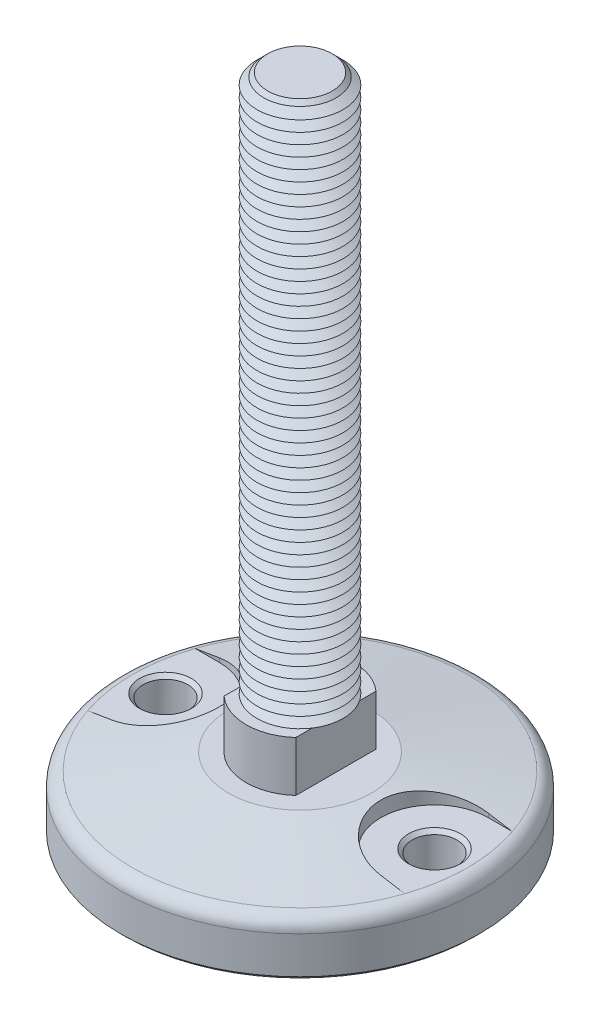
ISO-10303-21;
HEADER;
FILE_DESCRIPTION(('STEP AP214'),'2;1');
FILE_NAME('part.step','',(''),(''),'','','');
FILE_SCHEMA(('AUTOMOTIVE_DESIGN { 1 0 10303 214 1 1 1 1 }'));
ENDSEC;
DATA;
#1=APPLICATION_CONTEXT('core data for automotive mechanical design processes');
#2=APPLICATION_PROTOCOL_DEFINITION('international standard','automotive_design',2000,#1);
#3=PRODUCT_CONTEXT('',#1,'mechanical');
#4=PRODUCT('Part','Part','',(#3));
#5=PRODUCT_RELATED_PRODUCT_CATEGORY('part','',(#4));
#6=PRODUCT_DEFINITION_FORMATION('','',#4);
#7=PRODUCT_DEFINITION_CONTEXT('part definition',#1,'design');
#8=PRODUCT_DEFINITION('design','',#6,#7);
#9=PRODUCT_DEFINITION_SHAPE('','',#8);
#10=(LENGTH_UNIT() NAMED_UNIT(*) SI_UNIT(.MILLI.,.METRE.));
#11=(NAMED_UNIT(*) PLANE_ANGLE_UNIT() SI_UNIT($,.RADIAN.));
#12=(NAMED_UNIT(*) SI_UNIT($,.STERADIAN.) SOLID_ANGLE_UNIT());
#13=UNCERTAINTY_MEASURE_WITH_UNIT(LENGTH_MEASURE(1.E-05),#10,'distance_accuracy_value','');
#14=(GEOMETRIC_REPRESENTATION_CONTEXT(3) GLOBAL_UNCERTAINTY_ASSIGNED_CONTEXT((#13)) GLOBAL_UNIT_ASSIGNED_CONTEXT((#10,
#11,#12)) REPRESENTATION_CONTEXT('',''));
#15=CARTESIAN_POINT('',(0.,0.,0.));
#16=DIRECTION('',(0.,0.,1.));
#17=DIRECTION('',(1.,0.,0.));
#18=AXIS2_PLACEMENT_3D('',#15,#16,#17);
#19=CARTESIAN_POINT('',(0.,0.,0.));
#20=DIRECTION('',(0.,-1.,0.));
#21=DIRECTION('',(0.,0.,-1.));
#22=AXIS2_PLACEMENT_3D('',#19,#20,#21);
#23=CONICAL_SURFACE('',#22,20.,1.39626340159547);
#24=CARTESIAN_POINT('',(-37.5002,-3.59511701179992,14.9999999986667));
#25=CARTESIAN_POINT('',(-37.071618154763,-3.52495922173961,15.0000502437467));
#26=CARTESIAN_POINT('',(-36.6432161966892,-3.45377973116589,14.9816452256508));
#27=CARTESIAN_POINT('',(-35.7898597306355,-3.30975397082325,14.9083347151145));
#28=CARTESIAN_POINT('',(-35.3649049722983,-3.23690782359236,14.8534318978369));
#29=CARTESIAN_POINT('',(-34.5217702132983,-3.0899678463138,14.7075882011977));
#30=CARTESIAN_POINT('',(-34.1035855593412,-3.0158749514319,14.6166732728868));
#31=CARTESIAN_POINT('',(-33.276654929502,-2.86680950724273,14.3995164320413));
#32=CARTESIAN_POINT('',(-32.8679089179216,-2.79183696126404,14.2732746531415));
#33=CARTESIAN_POINT('',(-32.0626157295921,-2.64144796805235,13.9863372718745));
#34=CARTESIAN_POINT('',(-31.6660727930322,-2.56603137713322,13.8256298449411));
#35=CARTESIAN_POINT('',(-30.8881421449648,-2.41529591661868,13.4709346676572));
#36=CARTESIAN_POINT('',(-30.5067544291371,-2.33997704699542,13.276946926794));
#37=CARTESIAN_POINT('',(-29.7618852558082,-2.19002394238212,12.8570734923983));
#38=CARTESIAN_POINT('',(-29.3984015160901,-2.11538962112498,12.6311918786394));
#39=CARTESIAN_POINT('',(-28.6918747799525,-1.96744405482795,12.1490672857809));
#40=CARTESIAN_POINT('',(-28.3488317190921,-1.89413280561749,11.8928244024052));
#41=CARTESIAN_POINT('',(-27.68528276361,-1.7494825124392,11.3514262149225));
#42=CARTESIAN_POINT('',(-27.3648018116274,-1.67814570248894,11.0662397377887));
#43=CARTESIAN_POINT('',(-26.7491189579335,-1.5383468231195,10.4691194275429));
#44=CARTESIAN_POINT('',(-26.4539171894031,-1.46988476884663,10.1571854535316));
#45=CARTESIAN_POINT('',(-25.89093801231,-1.33673920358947,9.50863296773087));
#46=CARTESIAN_POINT('',(-25.6231651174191,-1.27205631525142,9.172010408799));
#47=CARTESIAN_POINT('',(-25.1171410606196,-1.14749043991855,8.47642452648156));
#48=CARTESIAN_POINT('',(-24.8788895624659,-1.08760739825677,8.11746145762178));
#49=CARTESIAN_POINT('',(-24.4362735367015,-0.974368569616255,7.38380225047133));
#50=CARTESIAN_POINT('',(-24.2315599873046,-0.920947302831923,7.009326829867));
#51=CARTESIAN_POINT('',(-23.8544760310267,-0.820970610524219,6.24354239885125));
#52=CARTESIAN_POINT('',(-23.6821054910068,-0.774415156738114,5.85223345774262));
#53=CARTESIAN_POINT('',(-23.3712027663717,-0.689292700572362,5.05567287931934));
#54=CARTESIAN_POINT('',(-23.2326612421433,-0.650723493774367,4.65042512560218));
#55=CARTESIAN_POINT('',(-22.9905836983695,-0.582602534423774,3.82886542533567));
#56=CARTESIAN_POINT('',(-22.8870466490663,-0.553050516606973,3.41255380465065));
#57=CARTESIAN_POINT('',(-22.7185202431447,-0.504595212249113,2.58473472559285));
#58=CARTESIAN_POINT('',(-22.6524606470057,-0.485397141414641,2.17346220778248));
#59=CARTESIAN_POINT('',(-22.5547584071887,-0.456903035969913,1.34650988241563));
#60=CARTESIAN_POINT('',(-22.5231150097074,-0.447606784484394,0.930830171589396));
#61=CARTESIAN_POINT('',(-22.4945397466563,-0.439214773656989,0.0982343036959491));
#62=CARTESIAN_POINT('',(-22.4976030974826,-0.440117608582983,-0.318681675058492));
#63=CARTESIAN_POINT('',(-22.5384014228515,-0.452091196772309,-1.15066338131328));
#64=CARTESIAN_POINT('',(-22.5761359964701,-0.463161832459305,-1.56572913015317));
#65=CARTESIAN_POINT('',(-22.684465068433,-0.494692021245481,-2.37993589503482));
#66=CARTESIAN_POINT('',(-22.7541599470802,-0.514894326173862,-2.77920702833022));
#67=CARTESIAN_POINT('',(-22.9254719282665,-0.564017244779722,-3.57028216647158));
#68=CARTESIAN_POINT('',(-23.0270883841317,-0.59293768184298,-3.96208632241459));
#69=CARTESIAN_POINT('',(-23.2614195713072,-0.658733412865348,-4.7356274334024));
#70=CARTESIAN_POINT('',(-23.3941371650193,-0.695609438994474,-5.11736345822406));
#71=CARTESIAN_POINT('',(-23.6896243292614,-0.77643223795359,-5.86824656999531));
#72=CARTESIAN_POINT('',(-23.8523945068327,-0.820379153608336,-6.23739340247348));
#73=CARTESIAN_POINT('',(-24.2096654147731,-0.91517964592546,-6.96667519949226));
#74=CARTESIAN_POINT('',(-24.4046414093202,-0.966134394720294,-7.32656415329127));
#75=CARTESIAN_POINT('',(-24.8229317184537,-1.07340641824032,-8.02863083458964));
#76=CARTESIAN_POINT('',(-25.0462462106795,-1.12972372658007,-8.37080845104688));
#77=CARTESIAN_POINT('',(-25.5196353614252,-1.24678782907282,-9.03533577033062));
#78=CARTESIAN_POINT('',(-25.7697111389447,-1.30753480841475,-9.35768464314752));
#79=CARTESIAN_POINT('',(-26.2948980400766,-1.43258611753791,-9.98056367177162));
#80=CARTESIAN_POINT('',(-26.5700098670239,-1.4968905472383,-10.2810932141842));
#81=CARTESIAN_POINT('',(-27.1529305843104,-1.63043794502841,-10.8680655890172));
#82=CARTESIAN_POINT('',(-27.4615208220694,-1.69977394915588,-11.1537117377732));
#83=CARTESIAN_POINT('',(-28.101294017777,-1.84060155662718,-11.6978928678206));
#84=CARTESIAN_POINT('',(-28.4324776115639,-1.91209322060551,-11.9564270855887));
#85=CARTESIAN_POINT('',(-29.1152826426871,-2.05655312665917,-12.4447886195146));
#86=CARTESIAN_POINT('',(-29.4669124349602,-2.12952196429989,-12.6746040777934));
#87=CARTESIAN_POINT('',(-30.1880609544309,-2.27627325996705,-13.1038783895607));
#88=CARTESIAN_POINT('',(-30.5575792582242,-2.35005569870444,-13.303337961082));
#89=CARTESIAN_POINT('',(-31.3189196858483,-2.49923001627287,-13.6739446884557));
#90=CARTESIAN_POINT('',(-31.7110266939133,-2.5746265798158,-13.8445050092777));
#91=CARTESIAN_POINT('',(-32.5084114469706,-2.72514849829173,-14.1515569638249));
#92=CARTESIAN_POINT('',(-32.9136891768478,-2.80027385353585,-14.2880486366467));
#93=CARTESIAN_POINT('',(-33.7340205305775,-2.94968142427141,-14.5258238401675));
#94=CARTESIAN_POINT('',(-34.1490613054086,-3.02396457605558,-14.6271511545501));
#95=CARTESIAN_POINT('',(-34.9863081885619,-3.17132754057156,-14.7940335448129));
#96=CARTESIAN_POINT('',(-35.4085107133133,-3.24440792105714,-14.8596059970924));
#97=CARTESIAN_POINT('',(-36.1096790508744,-3.36387020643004,-14.9380274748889));
#98=CARTESIAN_POINT('',(-36.3874461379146,-3.41070654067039,-14.9612791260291));
#99=CARTESIAN_POINT('',(-36.943509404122,-3.50354098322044,-14.9922564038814));
#100=CARTESIAN_POINT('',(-37.2218039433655,-3.54954035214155,-15.0000076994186));
#101=CARTESIAN_POINT('',(-37.5002,-3.59511701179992,-14.9999999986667));
#102=B_SPLINE_CURVE_WITH_KNOTS('',3,(#24,#25,#26,#27,#28,#29,#30,#31,#32,#33,#34,#35,#36,#37,
#38,#39,#40,#41,#42,#43,#44,#45,#46,#47,#48,#49,#50,#51,#52,#53,#54,#55,#56,#57,#58,#59,#60,#61,
#62,#63,#64,#65,#66,#67,#68,#69,#70,#71,#72,#73,#74,#75,#76,#77,#78,#79,#80,#81,#82,#83,#84,#85,
#86,#87,#88,#89,#90,#91,#92,#93,#94,#95,#96,#97,#98,#99,#100,#101),.UNSPECIFIED.,.F.,.F.,(4,2,2,
2,2,2,2,2,2,2,2,2,2,2,2,2,2,2,2,2,2,2,2,2,2,2,2,2,2,2,2,2,2,2,2,2,2,2,4),(0.,1.30244924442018,
2.60480303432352,3.90622002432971,5.20763209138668,6.50949136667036,7.81135027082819,
9.11304279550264,10.4147312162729,11.7178367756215,13.0209491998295,14.3242757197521,
15.6275873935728,16.9163305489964,18.205068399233,19.4934500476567,20.7817937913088,
22.0312084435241,23.2805957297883,24.5298108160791,25.779011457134,26.9950246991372,
28.2110133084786,29.4271138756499,30.6432390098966,31.8792469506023,33.1152626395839,
34.3513300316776,35.5874321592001,36.864491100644,38.1415859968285,39.4192064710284,
40.6967967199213,41.9978357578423,43.2988733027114,44.5982850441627,45.8970647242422,
46.7446059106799,47.590742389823),.UNSPECIFIED.);
#103=CARTESIAN_POINT('',(-37.5,-3.59508426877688,15.));
#104=VERTEX_POINT('',#103);
#105=CARTESIAN_POINT('',(-37.5,-3.59508426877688,-15.));
#106=VERTEX_POINT('',#105);
#107=EDGE_CURVE('E678',#104,#106,#102,.T.);
#108=ORIENTED_EDGE('',*,*,#107,.F.);
#109=CARTESIAN_POINT('',(-58.7331838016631,-7.16211468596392,15.));
#110=CARTESIAN_POINT('',(-57.4400366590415,-6.941199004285,15.));
#111=CARTESIAN_POINT('',(-56.1468183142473,-6.72069896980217,15.));
#112=CARTESIAN_POINT('',(-53.5602019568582,-6.2807555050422,15.));
#113=CARTESIAN_POINT('',(-52.2668039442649,-6.06131207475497,15.));
#114=CARTESIAN_POINT('',(-49.6798066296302,-5.62370977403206,15.));
#115=CARTESIAN_POINT('',(-48.3862073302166,-5.40555088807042,15.));
#116=CARTESIAN_POINT('',(-45.7987405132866,-4.97082983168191,15.));
#117=CARTESIAN_POINT('',(-44.5048729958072,-4.75426766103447,15.));
#118=CARTESIAN_POINT('',(-41.9167872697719,-4.32315417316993,15.));
#119=CARTESIAN_POINT('',(-40.6225690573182,-4.10860287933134,15.));
#120=CARTESIAN_POINT('',(-38.0337081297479,-3.68208609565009,15.));
#121=CARTESIAN_POINT('',(-36.7390654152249,-3.47012060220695,15.));
#122=CARTESIAN_POINT('',(-34.1492138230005,-3.04956665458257,15.));
#123=CARTESIAN_POINT('',(-32.854004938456,-2.84097824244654,15.));
#124=CARTESIAN_POINT('',(-30.9106470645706,-2.53149468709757,15.));
#125=CARTESIAN_POINT('',(-30.2627688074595,-2.4288997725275,15.));
#126=CARTESIAN_POINT('',(-28.9668013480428,-2.22504633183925,15.));
#127=CARTESIAN_POINT('',(-28.3187121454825,-2.12378780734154,15.));
#128=CARTESIAN_POINT('',(-27.6705030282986,-2.02329919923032,15.));
#129=B_SPLINE_CURVE_WITH_KNOTS('',3,(#109,#110,#111,#112,#113,#114,#115,#116,#117,#118,#119,
#120,#121,#122,#123,#124,#125,#126,#127,#128),.UNSPECIFIED.,.F.,.F.,(4,2,2,2,2,2,2,2,2,4),(0.,
3.93564494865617,7.87128985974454,11.8068871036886,15.7424838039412,19.6781262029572,
23.6137631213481,27.5494490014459,29.5173013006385,31.4851559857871),.UNSPECIFIED.);
#130=CARTESIAN_POINT('',(-44.1779505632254,-4.7,15.));
#131=VERTEX_POINT('',#130);
#132=EDGE_CURVE('E652',#131,#104,#129,.T.);
#133=ORIENTED_EDGE('',*,*,#132,.F.);
#134=CARTESIAN_POINT('',(0.,-4.7,0.));
#135=DIRECTION('',(0.,1.,0.));
#136=DIRECTION('',(0.,0.,1.));
#137=AXIS2_PLACEMENT_3D('',#134,#135,#136);
#138=CIRCLE('',#137,46.6550245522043);
#139=CARTESIAN_POINT('',(-44.1779505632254,-4.7,-15.));
#140=VERTEX_POINT('',#139);
#141=EDGE_CURVE('E636',#131,#140,#138,.F.);
#142=ORIENTED_EDGE('',*,*,#141,.T.);
#143=CARTESIAN_POINT('',(-27.6705030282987,-2.02329919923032,-15.));
#144=CARTESIAN_POINT('',(-28.3187121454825,-2.12378780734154,-15.));
#145=CARTESIAN_POINT('',(-28.9668013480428,-2.22504633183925,-15.));
#146=CARTESIAN_POINT('',(-30.2627688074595,-2.4288997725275,-15.));
#147=CARTESIAN_POINT('',(-30.9106470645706,-2.53149468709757,-15.));
#148=CARTESIAN_POINT('',(-32.854004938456,-2.84097824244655,-15.));
#149=CARTESIAN_POINT('',(-34.1492138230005,-3.04956665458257,-15.));
#150=CARTESIAN_POINT('',(-36.7390654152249,-3.47012060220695,-15.));
#151=CARTESIAN_POINT('',(-38.033708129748,-3.68208609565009,-15.));
#152=CARTESIAN_POINT('',(-40.6225690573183,-4.10860287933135,-15.));
#153=CARTESIAN_POINT('',(-41.9167872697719,-4.32315417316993,-15.));
#154=CARTESIAN_POINT('',(-44.5048729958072,-4.75426766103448,-15.));
#155=CARTESIAN_POINT('',(-45.7987405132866,-4.97082983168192,-15.));
#156=CARTESIAN_POINT('',(-48.3862073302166,-5.40555088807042,-15.));
#157=CARTESIAN_POINT('',(-49.6798066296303,-5.62370977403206,-15.));
#158=CARTESIAN_POINT('',(-52.2668039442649,-6.06131207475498,-15.));
#159=CARTESIAN_POINT('',(-53.5602019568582,-6.28075550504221,-15.));
#160=CARTESIAN_POINT('',(-56.1468183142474,-6.72069896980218,-15.));
#161=CARTESIAN_POINT('',(-57.4400366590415,-6.941199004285,-15.));
#162=CARTESIAN_POINT('',(-58.7331838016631,-7.16211468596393,-15.));
#163=B_SPLINE_CURVE_WITH_KNOTS('',3,(#143,#144,#145,#146,#147,#148,#149,#150,#151,#152,#153,
#154,#155,#156,#157,#158,#159,#160,#161,#162),.UNSPECIFIED.,.F.,.F.,(4,2,2,2,2,2,2,2,2,4),(0.,
1.96785468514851,3.93570698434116,7.87139286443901,11.8070297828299,15.7426721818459,
19.6782688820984,23.6138661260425,27.5495110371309,31.4851559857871),.UNSPECIFIED.);
#164=EDGE_CURVE('E644',#106,#140,#163,.T.);
#165=ORIENTED_EDGE('',*,*,#164,.F.);
#166=EDGE_LOOP('',(#108,#133,#142,#165));
#167=FACE_BOUND('',#166,.T.);
#168=CARTESIAN_POINT('',(0.,-4.70697693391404,0.));
#169=DIRECTION('',(0.,1.,0.));
#170=DIRECTION('',(0.,0.,1.));
#171=AXIS2_PLACEMENT_3D('',#168,#169,#170);
#172=CIRCLE('',#171,46.6945927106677);
#173=CARTESIAN_POINT('',(0.,-4.70697693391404,46.6945927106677));
#174=VERTEX_POINT('',#173);
#175=EDGE_CURVE('E625',#174,#174,#172,.T.);
#176=ORIENTED_EDGE('',*,*,#175,.T.);
#177=EDGE_LOOP('',(#176));
#178=FACE_BOUND('',#177,.T.);
#179=CARTESIAN_POINT('',(0.,0.,0.));
#180=DIRECTION('',(0.,1.,0.));
#181=DIRECTION('',(0.,0.,1.));
#182=AXIS2_PLACEMENT_3D('',#179,#180,#181);
#183=CIRCLE('',#182,20.);
#184=CARTESIAN_POINT('',(0.,0.,20.));
#185=VERTEX_POINT('',#184);
#186=EDGE_CURVE('E621',#185,#185,#183,.T.);
#187=ORIENTED_EDGE('',*,*,#186,.F.);
#188=EDGE_LOOP('',(#187));
#189=FACE_BOUND('',#188,.T.);
#190=CARTESIAN_POINT('',(53.8330700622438,-6.32728263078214,15.));
#191=CARTESIAN_POINT('',(52.5396994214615,-6.10761035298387,15.));
#192=CARTESIAN_POINT('',(51.2462390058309,-5.88846451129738,15.));
#193=CARTESIAN_POINT('',(48.6590869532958,-5.45154457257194,15.));
#194=CARTESIAN_POINT('',(47.3653953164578,-5.23377047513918,15.));
#195=CARTESIAN_POINT('',(44.7777592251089,-4.79991793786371,15.));
#196=CARTESIAN_POINT('',(43.4838147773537,-4.58383945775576,15.));
#197=CARTESIAN_POINT('',(40.8955691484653,-4.15382985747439,15.));
#198=CARTESIAN_POINT('',(39.6012679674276,-3.93989873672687,15.));
#199=CARTESIAN_POINT('',(37.0121780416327,-3.51480066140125,15.));
#200=CARTESIAN_POINT('',(35.7173892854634,-3.30363377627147,15.));
#201=CARTESIAN_POINT('',(33.1272261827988,-2.88493970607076,15.));
#202=CARTESIAN_POINT('',(31.8318518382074,-2.67741250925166,15.));
#203=CARTESIAN_POINT('',(29.8881899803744,-2.36980627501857,15.));
#204=CARTESIAN_POINT('',(29.2401942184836,-2.2678836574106,15.));
#205=CARTESIAN_POINT('',(27.9439769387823,-2.06548679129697,15.));
#206=CARTESIAN_POINT('',(27.2957554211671,-1.96501254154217,15.));
#207=CARTESIAN_POINT('',(25.9990437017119,-1.76576366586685,15.));
#208=CARTESIAN_POINT('',(25.3505534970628,-1.66698905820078,15.));
#209=CARTESIAN_POINT('',(24.0532646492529,-1.47147446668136,15.));
#210=CARTESIAN_POINT('',(23.4044660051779,-1.37473448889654,15.));
#211=CARTESIAN_POINT('',(22.7554917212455,-1.27917906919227,15.));
#212=B_SPLINE_CURVE_WITH_KNOTS('',3,(#190,#191,#192,#193,#194,#195,#196,#197,#198,#199,#200,
#201,#202,#203,#204,#205,#206,#207,#208,#209,#210,#211),.UNSPECIFIED.,.F.,.F.,(4,2,2,2,2,2,2,2,
2,2,4),(0.,3.93567975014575,7.87135837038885,11.806943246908,15.7425270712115,19.6782095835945,
23.6138793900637,25.5817654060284,27.5496497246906,29.5175551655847,31.4854664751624),.UNSPECIFIED.);
#213=CARTESIAN_POINT('',(44.1779505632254,-4.7,15.));
#214=VERTEX_POINT('',#213);
#215=CARTESIAN_POINT('',(37.5,-3.59508426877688,15.));
#216=VERTEX_POINT('',#215);
#217=EDGE_CURVE('E133',#214,#216,#212,.T.);
#218=ORIENTED_EDGE('',*,*,#217,.T.);
#219=CARTESIAN_POINT('',(37.5002,-3.59511701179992,14.9999999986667));
#220=CARTESIAN_POINT('',(37.071618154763,-3.52495922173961,15.0000502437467));
#221=CARTESIAN_POINT('',(36.6432161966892,-3.45377973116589,14.9816452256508));
#222=CARTESIAN_POINT('',(35.7898597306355,-3.30975397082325,14.9083347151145));
#223=CARTESIAN_POINT('',(35.3649049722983,-3.23690782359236,14.8534318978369));
#224=CARTESIAN_POINT('',(34.5217702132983,-3.0899678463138,14.7075882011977));
#225=CARTESIAN_POINT('',(34.1035855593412,-3.0158749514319,14.6166732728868));
#226=CARTESIAN_POINT('',(33.276654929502,-2.86680950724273,14.3995164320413));
#227=CARTESIAN_POINT('',(32.8679089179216,-2.79183696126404,14.2732746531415));
#228=CARTESIAN_POINT('',(32.0626157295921,-2.64144796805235,13.9863372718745));
#229=CARTESIAN_POINT('',(31.6660727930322,-2.56603137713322,13.8256298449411));
#230=CARTESIAN_POINT('',(30.8881421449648,-2.41529591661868,13.4709346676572));
#231=CARTESIAN_POINT('',(30.5067544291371,-2.33997704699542,13.276946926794));
#232=CARTESIAN_POINT('',(29.7618852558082,-2.19002394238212,12.8570734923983));
#233=CARTESIAN_POINT('',(29.3984015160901,-2.11538962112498,12.6311918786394));
#234=CARTESIAN_POINT('',(28.6918747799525,-1.96744405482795,12.1490672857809));
#235=CARTESIAN_POINT('',(28.3488317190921,-1.89413280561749,11.8928244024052));
#236=CARTESIAN_POINT('',(27.68528276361,-1.7494825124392,11.3514262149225));
#237=CARTESIAN_POINT('',(27.3648018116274,-1.67814570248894,11.0662397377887));
#238=CARTESIAN_POINT('',(26.7491189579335,-1.5383468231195,10.4691194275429));
#239=CARTESIAN_POINT('',(26.4539171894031,-1.46988476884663,10.1571854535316));
#240=CARTESIAN_POINT('',(25.89093801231,-1.33673920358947,9.50863296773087));
#241=CARTESIAN_POINT('',(25.6231651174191,-1.27205631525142,9.172010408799));
#242=CARTESIAN_POINT('',(25.1171410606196,-1.14749043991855,8.47642452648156));
#243=CARTESIAN_POINT('',(24.8788895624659,-1.08760739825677,8.11746145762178));
#244=CARTESIAN_POINT('',(24.4362735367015,-0.974368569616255,7.38380225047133));
#245=CARTESIAN_POINT('',(24.2315599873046,-0.920947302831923,7.009326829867));
#246=CARTESIAN_POINT('',(23.8544760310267,-0.820970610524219,6.24354239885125));
#247=CARTESIAN_POINT('',(23.6821054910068,-0.774415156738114,5.85223345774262));
#248=CARTESIAN_POINT('',(23.3712027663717,-0.689292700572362,5.05567287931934));
#249=CARTESIAN_POINT('',(23.2326612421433,-0.650723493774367,4.65042512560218));
#250=CARTESIAN_POINT('',(22.9905836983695,-0.582602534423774,3.82886542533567));
#251=CARTESIAN_POINT('',(22.8870466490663,-0.553050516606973,3.41255380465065));
#252=CARTESIAN_POINT('',(22.7185202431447,-0.504595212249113,2.58473472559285));
#253=CARTESIAN_POINT('',(22.6524606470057,-0.485397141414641,2.17346220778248));
#254=CARTESIAN_POINT('',(22.5547584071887,-0.456903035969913,1.34650988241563));
#255=CARTESIAN_POINT('',(22.5231150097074,-0.447606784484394,0.930830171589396));
#256=CARTESIAN_POINT('',(22.4945397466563,-0.439214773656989,0.0982343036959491));
#257=CARTESIAN_POINT('',(22.4976030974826,-0.440117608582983,-0.318681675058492));
#258=CARTESIAN_POINT('',(22.5384014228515,-0.452091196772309,-1.15066338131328));
#259=CARTESIAN_POINT('',(22.5761359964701,-0.463161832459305,-1.56572913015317));
#260=CARTESIAN_POINT('',(22.684465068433,-0.494692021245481,-2.37993589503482));
#261=CARTESIAN_POINT('',(22.7541599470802,-0.514894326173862,-2.77920702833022));
#262=CARTESIAN_POINT('',(22.9254719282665,-0.564017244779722,-3.57028216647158));
#263=CARTESIAN_POINT('',(23.0270883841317,-0.59293768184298,-3.96208632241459));
#264=CARTESIAN_POINT('',(23.2614195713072,-0.658733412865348,-4.7356274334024));
#265=CARTESIAN_POINT('',(23.3941371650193,-0.695609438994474,-5.11736345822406));
#266=CARTESIAN_POINT('',(23.6896243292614,-0.77643223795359,-5.86824656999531));
#267=CARTESIAN_POINT('',(23.8523945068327,-0.820379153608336,-6.23739340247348));
#268=CARTESIAN_POINT('',(24.2096654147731,-0.91517964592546,-6.96667519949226));
#269=CARTESIAN_POINT('',(24.4046414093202,-0.966134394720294,-7.32656415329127));
#270=CARTESIAN_POINT('',(24.8229317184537,-1.07340641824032,-8.02863083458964));
#271=CARTESIAN_POINT('',(25.0462462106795,-1.12972372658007,-8.37080845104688));
#272=CARTESIAN_POINT('',(25.5196353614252,-1.24678782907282,-9.03533577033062));
#273=CARTESIAN_POINT('',(25.7697111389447,-1.30753480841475,-9.35768464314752));
#274=CARTESIAN_POINT('',(26.2948980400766,-1.43258611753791,-9.98056367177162));
#275=CARTESIAN_POINT('',(26.5700098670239,-1.4968905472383,-10.2810932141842));
#276=CARTESIAN_POINT('',(27.1529305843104,-1.63043794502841,-10.8680655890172));
#277=CARTESIAN_POINT('',(27.4615208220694,-1.69977394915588,-11.1537117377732));
#278=CARTESIAN_POINT('',(28.101294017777,-1.84060155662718,-11.6978928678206));
#279=CARTESIAN_POINT('',(28.4324776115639,-1.91209322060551,-11.9564270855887));
#280=CARTESIAN_POINT('',(29.1152826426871,-2.05655312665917,-12.4447886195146));
#281=CARTESIAN_POINT('',(29.4669124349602,-2.12952196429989,-12.6746040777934));
#282=CARTESIAN_POINT('',(30.1880609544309,-2.27627325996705,-13.1038783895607));
#283=CARTESIAN_POINT('',(30.5575792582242,-2.35005569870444,-13.303337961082));
#284=CARTESIAN_POINT('',(31.3189196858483,-2.49923001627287,-13.6739446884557));
#285=CARTESIAN_POINT('',(31.7110266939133,-2.5746265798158,-13.8445050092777));
#286=CARTESIAN_POINT('',(32.5084114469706,-2.72514849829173,-14.1515569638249));
#287=CARTESIAN_POINT('',(32.9136891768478,-2.80027385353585,-14.2880486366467));
#288=CARTESIAN_POINT('',(33.7340205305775,-2.94968142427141,-14.5258238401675));
#289=CARTESIAN_POINT('',(34.1490613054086,-3.02396457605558,-14.6271511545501));
#290=CARTESIAN_POINT('',(34.9863081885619,-3.17132754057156,-14.7940335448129));
#291=CARTESIAN_POINT('',(35.4085107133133,-3.24440792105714,-14.8596059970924));
#292=CARTESIAN_POINT('',(36.1096790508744,-3.36387020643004,-14.9380274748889));
#293=CARTESIAN_POINT('',(36.3874461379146,-3.41070654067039,-14.9612791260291));
#294=CARTESIAN_POINT('',(36.943509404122,-3.50354098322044,-14.9922564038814));
#295=CARTESIAN_POINT('',(37.2218039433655,-3.54954035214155,-15.0000076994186));
#296=CARTESIAN_POINT('',(37.5002,-3.59511701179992,-14.9999999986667));
#297=B_SPLINE_CURVE_WITH_KNOTS('',3,(#219,#220,#221,#222,#223,#224,#225,#226,#227,#228,#229,
#230,#231,#232,#233,#234,#235,#236,#237,#238,#239,#240,#241,#242,#243,#244,#245,#246,#247,#248,
#249,#250,#251,#252,#253,#254,#255,#256,#257,#258,#259,#260,#261,#262,#263,#264,#265,#266,#267,
#268,#269,#270,#271,#272,#273,#274,#275,#276,#277,#278,#279,#280,#281,#282,#283,#284,#285,#286,
#287,#288,#289,#290,#291,#292,#293,#294,#295,#296),.UNSPECIFIED.,.F.,.F.,(4,2,2,2,2,2,2,2,2,2,2,
2,2,2,2,2,2,2,2,2,2,2,2,2,2,2,2,2,2,2,2,2,2,2,2,2,2,2,4),(0.,1.30244924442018,2.60480303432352,
3.90622002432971,5.20763209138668,6.50949136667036,7.81135027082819,9.11304279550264,
10.4147312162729,11.7178367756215,13.0209491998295,14.3242757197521,15.6275873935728,
16.9163305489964,18.205068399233,19.4934500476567,20.7817937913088,22.0312084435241,
23.2805957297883,24.5298108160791,25.779011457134,26.9950246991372,28.2110133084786,
29.4271138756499,30.6432390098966,31.8792469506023,33.1152626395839,34.3513300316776,
35.5874321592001,36.864491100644,38.1415859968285,39.4192064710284,40.6967967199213,
41.9978357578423,43.2988733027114,44.5982850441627,45.8970647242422,46.7446059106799,
47.590742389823),.UNSPECIFIED.);
#298=CARTESIAN_POINT('',(37.5,-3.59508426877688,-15.));
#299=VERTEX_POINT('',#298);
#300=EDGE_CURVE('E145',#216,#299,#297,.T.);
#301=ORIENTED_EDGE('',*,*,#300,.T.);
#302=CARTESIAN_POINT('',(22.7554917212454,-1.27917906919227,-15.));
#303=CARTESIAN_POINT('',(23.4044660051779,-1.37473448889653,-15.));
#304=CARTESIAN_POINT('',(24.0532646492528,-1.47147446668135,-15.));
#305=CARTESIAN_POINT('',(25.3505534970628,-1.66698905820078,-15.));
#306=CARTESIAN_POINT('',(25.9990437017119,-1.76576366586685,-15.));
#307=CARTESIAN_POINT('',(27.2957554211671,-1.96501254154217,-15.));
#308=CARTESIAN_POINT('',(27.9439769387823,-2.06548679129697,-15.));
#309=CARTESIAN_POINT('',(29.2401942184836,-2.2678836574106,-15.));
#310=CARTESIAN_POINT('',(29.8881899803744,-2.36980627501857,-15.));
#311=CARTESIAN_POINT('',(31.8318518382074,-2.67741250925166,-15.));
#312=CARTESIAN_POINT('',(33.1272261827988,-2.88493970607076,-15.));
#313=CARTESIAN_POINT('',(35.7173892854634,-3.30363377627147,-15.));
#314=CARTESIAN_POINT('',(37.0121780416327,-3.51480066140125,-15.));
#315=CARTESIAN_POINT('',(39.6012679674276,-3.93989873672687,-15.));
#316=CARTESIAN_POINT('',(40.8955691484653,-4.1538298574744,-15.));
#317=CARTESIAN_POINT('',(43.4838147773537,-4.58383945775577,-15.));
#318=CARTESIAN_POINT('',(44.7777592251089,-4.79991793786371,-15.));
#319=CARTESIAN_POINT('',(47.3653953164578,-5.23377047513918,-15.));
#320=CARTESIAN_POINT('',(48.6590869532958,-5.45154457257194,-15.));
#321=CARTESIAN_POINT('',(51.2462390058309,-5.88846451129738,-15.));
#322=CARTESIAN_POINT('',(52.5396994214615,-6.10761035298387,-15.));
#323=CARTESIAN_POINT('',(53.8330700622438,-6.32728263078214,-15.));
#324=B_SPLINE_CURVE_WITH_KNOTS('',3,(#302,#303,#304,#305,#306,#307,#308,#309,#310,#311,#312,
#313,#314,#315,#316,#317,#318,#319,#320,#321,#322,#323),.UNSPECIFIED.,.F.,.F.,(4,2,2,2,2,2,2,2,
2,2,4),(0.,1.96791130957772,3.93581675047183,5.90370106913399,7.87158708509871,11.8072568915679,
15.7429394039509,19.6785232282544,23.6141081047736,27.5497867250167,31.4854664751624),.UNSPECIFIED.);
#325=CARTESIAN_POINT('',(44.1779505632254,-4.7,-15.));
#326=VERTEX_POINT('',#325);
#327=EDGE_CURVE('E709',#299,#326,#324,.T.);
#328=ORIENTED_EDGE('',*,*,#327,.T.);
#329=CARTESIAN_POINT('',(0.,-4.7,0.));
#330=DIRECTION('',(0.,1.,0.));
#331=DIRECTION('',(0.,0.,1.));
#332=AXIS2_PLACEMENT_3D('',#329,#330,#331);
#333=CIRCLE('',#332,46.6550245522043);
#334=EDGE_CURVE('E700',#326,#214,#333,.F.);
#335=ORIENTED_EDGE('',*,*,#334,.T.);
#336=EDGE_LOOP('',(#218,#301,#328,#335));
#337=FACE_BOUND('',#336,.T.);
#338=ADVANCED_FACE('F39',(#167,#178,#189,#337),#23,.T.);
#339=CARTESIAN_POINT('',(0.,14.,0.));
#340=DIRECTION('',(0.,1.,0.));
#341=DIRECTION('',(0.,0.,1.));
#342=AXIS2_PLACEMENT_3D('',#339,#340,#341);
#343=PLANE('',#342);
#344=CARTESIAN_POINT('',(0.,14.,0.));
#345=DIRECTION('',(0.,1.,0.));
#346=DIRECTION('',(0.,0.,1.));
#347=AXIS2_PLACEMENT_3D('',#344,#345,#346);
#348=CIRCLE('',#347,12.);
#349=CARTESIAN_POINT('',(10.,14.,-6.6332495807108));
#350=VERTEX_POINT('',#349);
#351=CARTESIAN_POINT('',(-10.,14.,-6.6332495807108));
#352=VERTEX_POINT('',#351);
#353=EDGE_CURVE('E637',#350,#352,#348,.T.);
#354=ORIENTED_EDGE('',*,*,#353,.F.);
#355=DIRECTION('',(0.,0.,1.));
#356=VECTOR('',#355,1.);
#357=CARTESIAN_POINT('',(10.,14.,11.1803398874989));
#358=LINE('',#357,#356);
#359=CARTESIAN_POINT('',(10.,14.,-11.1803398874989));
#360=VERTEX_POINT('',#359);
#361=EDGE_CURVE('E600',#360,#350,#358,.T.);
#362=ORIENTED_EDGE('',*,*,#361,.F.);
#363=CARTESIAN_POINT('',(0.,14.,0.));
#364=DIRECTION('',(0.,1.,0.));
#365=DIRECTION('',(0.,0.,1.));
#366=AXIS2_PLACEMENT_3D('',#363,#364,#365);
#367=CIRCLE('',#366,15.);
#368=CARTESIAN_POINT('',(-10.,14.,-11.1803398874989));
#369=VERTEX_POINT('',#368);
#370=EDGE_CURVE('E614',#360,#369,#367,.T.);
#371=ORIENTED_EDGE('',*,*,#370,.T.);
#372=DIRECTION('',(0.,0.,-1.));
#373=VECTOR('',#372,1.);
#374=CARTESIAN_POINT('',(-10.,14.,-11.1803398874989));
#375=LINE('',#374,#373);
#376=EDGE_CURVE('E587',#352,#369,#375,.T.);
#377=ORIENTED_EDGE('',*,*,#376,.F.);
#378=EDGE_LOOP('',(#354,#362,#371,#377));
#379=FACE_BOUND('',#378,.T.);
#380=ADVANCED_FACE('F764',(#379),#343,.T.);
#381=CARTESIAN_POINT('',(0.,14.,0.));
#382=DIRECTION('',(0.,-1.,0.));
#383=DIRECTION('',(0.,0.,-1.));
#384=AXIS2_PLACEMENT_3D('',#381,#382,#383);
#385=CYLINDRICAL_SURFACE('',#384,15.);
#386=CARTESIAN_POINT('',(-10.,14.,11.1803398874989));
#387=VERTEX_POINT('',#386);
#388=CARTESIAN_POINT('',(10.,14.,11.1803398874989));
#389=VERTEX_POINT('',#388);
#390=EDGE_CURVE('E592',#387,#389,#367,.T.);
#391=ORIENTED_EDGE('',*,*,#390,.F.);
#392=DIRECTION('',(0.,1.,0.));
#393=VECTOR('',#392,1.);
#394=CARTESIAN_POINT('',(-10.,0.,11.1803398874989));
#395=LINE('',#394,#393);
#396=CARTESIAN_POINT('',(-10.,0.,11.1803398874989));
#397=VERTEX_POINT('',#396);
#398=EDGE_CURVE('E581',#397,#387,#395,.T.);
#399=ORIENTED_EDGE('',*,*,#398,.F.);
#400=CARTESIAN_POINT('',(0.,0.,0.));
#401=DIRECTION('',(0.,1.,0.));
#402=DIRECTION('',(0.,0.,1.));
#403=AXIS2_PLACEMENT_3D('',#400,#401,#402);
#404=CIRCLE('',#403,15.);
#405=CARTESIAN_POINT('',(10.,0.,11.1803398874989));
#406=VERTEX_POINT('',#405);
#407=EDGE_CURVE('E615',#397,#406,#404,.T.);
#408=ORIENTED_EDGE('',*,*,#407,.T.);
#409=DIRECTION('',(0.,1.,0.));
#410=VECTOR('',#409,1.);
#411=CARTESIAN_POINT('',(10.,0.,11.1803398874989));
#412=LINE('',#411,#410);
#413=EDGE_CURVE('E605',#406,#389,#412,.T.);
#414=ORIENTED_EDGE('',*,*,#413,.T.);
#415=EDGE_LOOP('',(#391,#399,#408,#414));
#416=FACE_BOUND('',#415,.T.);
#417=ADVANCED_FACE('F769',(#416),#385,.T.);
#418=CARTESIAN_POINT('',(0.,0.,0.));
#419=DIRECTION('',(0.,1.,0.));
#420=DIRECTION('',(0.,0.,1.));
#421=AXIS2_PLACEMENT_3D('',#418,#419,#420);
#422=PLANE('',#421);
#423=CARTESIAN_POINT('',(10.,0.,-11.1803398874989));
#424=VERTEX_POINT('',#423);
#425=CARTESIAN_POINT('',(-10.,0.,-11.1803398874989));
#426=VERTEX_POINT('',#425);
#427=EDGE_CURVE('E619',#424,#426,#404,.T.);
#428=ORIENTED_EDGE('',*,*,#427,.F.);
#429=DIRECTION('',(0.,0.,1.));
#430=VECTOR('',#429,1.);
#431=CARTESIAN_POINT('',(10.,0.,11.1803398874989));
#432=LINE('',#431,#430);
#433=EDGE_CURVE('E595',#424,#406,#432,.T.);
#434=ORIENTED_EDGE('',*,*,#433,.T.);
#435=ORIENTED_EDGE('',*,*,#407,.F.);
#436=DIRECTION('',(0.,0.,-1.));
#437=VECTOR('',#436,1.);
#438=CARTESIAN_POINT('',(-10.,0.,-11.1803398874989));
#439=LINE('',#438,#437);
#440=EDGE_CURVE('E577',#397,#426,#439,.T.);
#441=ORIENTED_EDGE('',*,*,#440,.T.);
#442=EDGE_LOOP('',(#428,#434,#435,#441));
#443=FACE_BOUND('',#442,.T.);
#444=ORIENTED_EDGE('',*,*,#186,.T.);
#445=EDGE_LOOP('',(#444));
#446=FACE_BOUND('',#445,.T.);
#447=ADVANCED_FACE('F851',(#443,#446),#422,.T.);
#448=CARTESIAN_POINT('',(0.,61.3388655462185,0.));
#449=DIRECTION('',(0.,1.,0.));
#450=DIRECTION('',(0.,0.,1.));
#451=AXIS2_PLACEMENT_3D('',#448,#449,#450);
#452=CYLINDRICAL_SURFACE('',#451,50.);
#453=CARTESIAN_POINT('',(0.,-19.,0.));
#454=DIRECTION('',(0.,-1.,0.));
#455=DIRECTION('',(0.,0.,-1.));
#456=AXIS2_PLACEMENT_3D('',#453,#454,#455);
#457=CIRCLE('',#456,50.);
#458=CARTESIAN_POINT('',(0.,-19.,-50.));
#459=VERTEX_POINT('',#458);
#460=EDGE_CURVE('E48',#459,#459,#457,.F.);
#461=ORIENTED_EDGE('',*,*,#460,.T.);
#462=EDGE_LOOP('',(#461));
#463=FACE_BOUND('',#462,.T.);
#464=CARTESIAN_POINT('',(0.,-8.64620794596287,0.));
#465=DIRECTION('',(0.,-1.,0.));
#466=DIRECTION('',(0.,0.,-1.));
#467=AXIS2_PLACEMENT_3D('',#464,#465,#466);
#468=CIRCLE('',#467,50.);
#469=CARTESIAN_POINT('',(0.,-8.64620794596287,-50.));
#470=VERTEX_POINT('',#469);
#471=EDGE_CURVE('E620',#470,#470,#468,.T.);
#472=ORIENTED_EDGE('',*,*,#471,.T.);
#473=EDGE_LOOP('',(#472));
#474=FACE_BOUND('',#473,.T.);
#475=ADVANCED_FACE('F751',(#463,#474),#452,.T.);
#476=CARTESIAN_POINT('',(0.,-20.,50.));
#477=DIRECTION('',(0.,-1.,0.));
#478=DIRECTION('',(0.,0.,-1.));
#479=AXIS2_PLACEMENT_3D('',#476,#477,#478);
#480=PLANE('',#479);
#481=CARTESIAN_POINT('',(0.,-20.,0.));
#482=DIRECTION('',(0.,-1.,0.));
#483=DIRECTION('',(0.,0.,-1.));
#484=AXIS2_PLACEMENT_3D('',#481,#482,#483);
#485=CIRCLE('',#484,49.);
#486=CARTESIAN_POINT('',(0.,-20.,-49.));
#487=VERTEX_POINT('',#486);
#488=EDGE_CURVE('E11',#487,#487,#485,.T.);
#489=ORIENTED_EDGE('',*,*,#488,.T.);
#490=EDGE_LOOP('',(#489));
#491=FACE_BOUND('',#490,.T.);
#492=CARTESIAN_POINT('',(37.5,-20.,0.));
#493=DIRECTION('',(0.,-1.,0.));
#494=DIRECTION('',(0.,0.,-1.));
#495=AXIS2_PLACEMENT_3D('',#492,#493,#494);
#496=CIRCLE('',#495,7.25000000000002);
#497=CARTESIAN_POINT('',(37.5,-20.,-7.25000000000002));
#498=VERTEX_POINT('',#497);
#499=EDGE_CURVE('E739',#498,#498,#496,.F.);
#500=ORIENTED_EDGE('',*,*,#499,.T.);
#501=EDGE_LOOP('',(#500));
#502=FACE_BOUND('',#501,.T.);
#503=CARTESIAN_POINT('',(-37.5,-20.,0.));
#504=DIRECTION('',(0.,-1.,0.));
#505=DIRECTION('',(0.,0.,-1.));
#506=AXIS2_PLACEMENT_3D('',#503,#504,#505);
#507=CIRCLE('',#506,7.25000000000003);
#508=CARTESIAN_POINT('',(-37.5,-20.,-7.25000000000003));
#509=VERTEX_POINT('',#508);
#510=EDGE_CURVE('E684',#509,#509,#507,.F.);
#511=ORIENTED_EDGE('',*,*,#510,.T.);
#512=EDGE_LOOP('',(#511));
#513=FACE_BOUND('',#512,.T.);
#514=ADVANCED_FACE('F847',(#491,#502,#513),#480,.T.);
#515=CARTESIAN_POINT('',(0.,-8.64620794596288,0.));
#516=DIRECTION('',(0.,-1.,0.));
#517=DIRECTION('',(0.,0.,-1.));
#518=AXIS2_PLACEMENT_3D('',#515,#516,#517);
#519=TOROIDAL_SURFACE('',#518,46.,4.);
#520=ORIENTED_EDGE('',*,*,#471,.F.);
#521=EDGE_LOOP('',(#520));
#522=FACE_BOUND('',#521,.T.);
#523=ORIENTED_EDGE('',*,*,#175,.F.);
#524=EDGE_LOOP('',(#523));
#525=FACE_BOUND('',#524,.T.);
#526=ADVANCED_FACE('F846',(#522,#525),#519,.T.);
#527=ORIENTED_EDGE('',*,*,#427,.T.);
#528=DIRECTION('',(0.,1.,0.));
#529=VECTOR('',#528,1.);
#530=CARTESIAN_POINT('',(-10.,0.,-11.1803398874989));
#531=LINE('',#530,#529);
#532=EDGE_CURVE('E588',#426,#369,#531,.T.);
#533=ORIENTED_EDGE('',*,*,#532,.T.);
#534=ORIENTED_EDGE('',*,*,#370,.F.);
#535=DIRECTION('',(0.,1.,0.));
#536=VECTOR('',#535,1.);
#537=CARTESIAN_POINT('',(10.,0.,-11.1803398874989));
#538=LINE('',#537,#536);
#539=EDGE_CURVE('E599',#424,#360,#538,.T.);
#540=ORIENTED_EDGE('',*,*,#539,.F.);
#541=EDGE_LOOP('',(#527,#533,#534,#540));
#542=FACE_BOUND('',#541,.T.);
#543=ADVANCED_FACE('F814',(#542),#385,.T.);
#544=CARTESIAN_POINT('',(-10.,14.,6.6332495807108));
#545=VERTEX_POINT('',#544);
#546=CARTESIAN_POINT('',(10.,14.,6.6332495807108));
#547=VERTEX_POINT('',#546);
#548=EDGE_CURVE('E576',#545,#547,#348,.T.);
#549=ORIENTED_EDGE('',*,*,#548,.F.);
#550=EDGE_CURVE('E582',#387,#545,#375,.T.);
#551=ORIENTED_EDGE('',*,*,#550,.F.);
#552=ORIENTED_EDGE('',*,*,#390,.T.);
#553=EDGE_CURVE('E575',#547,#389,#358,.T.);
#554=ORIENTED_EDGE('',*,*,#553,.F.);
#555=EDGE_LOOP('',(#549,#551,#552,#554));
#556=FACE_BOUND('',#555,.T.);
#557=ADVANCED_FACE('F772',(#556),#343,.T.);
#558=CARTESIAN_POINT('',(10.,0.,11.1803398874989));
#559=DIRECTION('',(-1.,0.,0.));
#560=DIRECTION('',(0.,0.,1.));
#561=AXIS2_PLACEMENT_3D('',#558,#559,#560);
#562=PLANE('',#561);
#563=ORIENTED_EDGE('',*,*,#361,.T.);
#564=EDGE_CURVE('E604',#350,#547,#358,.T.);
#565=ORIENTED_EDGE('',*,*,#564,.T.);
#566=ORIENTED_EDGE('',*,*,#553,.T.);
#567=ORIENTED_EDGE('',*,*,#413,.F.);
#568=ORIENTED_EDGE('',*,*,#433,.F.);
#569=ORIENTED_EDGE('',*,*,#539,.T.);
#570=EDGE_LOOP('',(#563,#565,#566,#567,#568,#569));
#571=FACE_BOUND('',#570,.T.);
#572=ADVANCED_FACE('F790',(#571),#562,.F.);
#573=CARTESIAN_POINT('',(-10.,0.,-11.1803398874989));
#574=DIRECTION('',(1.,0.,0.));
#575=DIRECTION('',(0.,0.,-1.));
#576=AXIS2_PLACEMENT_3D('',#573,#574,#575);
#577=PLANE('',#576);
#578=ORIENTED_EDGE('',*,*,#550,.T.);
#579=EDGE_CURVE('E586',#545,#352,#375,.T.);
#580=ORIENTED_EDGE('',*,*,#579,.T.);
#581=ORIENTED_EDGE('',*,*,#376,.T.);
#582=ORIENTED_EDGE('',*,*,#532,.F.);
#583=ORIENTED_EDGE('',*,*,#440,.F.);
#584=ORIENTED_EDGE('',*,*,#398,.T.);
#585=EDGE_LOOP('',(#578,#580,#581,#582,#583,#584));
#586=FACE_BOUND('',#585,.T.);
#587=ADVANCED_FACE('F802',(#586),#577,.F.);
#588=CARTESIAN_POINT('',(0.,14.,0.));
#589=DIRECTION('',(0.,1.,0.));
#590=DIRECTION('',(0.,0.,1.));
#591=AXIS2_PLACEMENT_3D('',#588,#589,#590);
#592=PLANE('',#591);
#593=ORIENTED_EDGE('',*,*,#579,.F.);
#594=EDGE_CURVE('E571',#352,#545,#348,.T.);
#595=ORIENTED_EDGE('',*,*,#594,.F.);
#596=EDGE_LOOP('',(#593,#595));
#597=FACE_BOUND('',#596,.T.);
#598=ADVANCED_FACE('F805',(#597),#592,.F.);
#599=ORIENTED_EDGE('',*,*,#564,.F.);
#600=EDGE_CURVE('E572',#547,#350,#348,.T.);
#601=ORIENTED_EDGE('',*,*,#600,.F.);
#602=EDGE_LOOP('',(#599,#601));
#603=FACE_BOUND('',#602,.T.);
#604=ADVANCED_FACE('F826',(#603),#592,.F.);
#605=CARTESIAN_POINT('',(0.,14.,0.));
#606=DIRECTION('',(0.,-1.,0.));
#607=DIRECTION('',(0.,0.,-1.));
#608=AXIS2_PLACEMENT_3D('',#605,#606,#607);
#609=CONICAL_SURFACE('',#608,12.,1.0471975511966);
#610=CARTESIAN_POINT('',(0.,15.5,0.));
#611=DIRECTION('',(0.,1.,0.));
#612=DIRECTION('',(0.,0.,1.));
#613=AXIS2_PLACEMENT_3D('',#610,#611,#612);
#614=CIRCLE('',#613,9.40192378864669);
#615=CARTESIAN_POINT('',(0.,15.5,9.40192378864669));
#616=VERTEX_POINT('',#615);
#617=EDGE_CURVE('E567',#616,#616,#614,.T.);
#618=ORIENTED_EDGE('',*,*,#617,.F.);
#619=EDGE_LOOP('',(#618));
#620=FACE_BOUND('',#619,.T.);
#621=ORIENTED_EDGE('',*,*,#600,.T.);
#622=ORIENTED_EDGE('',*,*,#353,.T.);
#623=ORIENTED_EDGE('',*,*,#594,.T.);
#624=ORIENTED_EDGE('',*,*,#548,.T.);
#625=EDGE_LOOP('',(#621,#622,#623,#624));
#626=FACE_BOUND('',#625,.T.);
#627=ADVANCED_FACE('F824',(#620,#626),#609,.T.);
#628=CARTESIAN_POINT('',(0.,15.5,0.));
#629=DIRECTION('',(0.,1.,0.));
#630=DIRECTION('',(0.,0.,1.));
#631=AXIS2_PLACEMENT_3D('',#628,#629,#630);
#632=CONICAL_SURFACE('',#631,9.40192378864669,1.0471975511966);
#633=CARTESIAN_POINT('',(0.,17.,0.));
#634=DIRECTION('',(0.,1.,0.));
#635=DIRECTION('',(0.,0.,1.));
#636=AXIS2_PLACEMENT_3D('',#633,#634,#635);
#637=CIRCLE('',#636,12.);
#638=CARTESIAN_POINT('',(0.,17.,12.));
#639=VERTEX_POINT('',#638);
#640=EDGE_CURVE('E563',#639,#639,#637,.T.);
#641=ORIENTED_EDGE('',*,*,#640,.F.);
#642=EDGE_LOOP('',(#641));
#643=FACE_BOUND('',#642,.T.);
#644=ORIENTED_EDGE('',*,*,#617,.T.);
#645=EDGE_LOOP('',(#644));
#646=FACE_BOUND('',#645,.T.);
#647=ADVANCED_FACE('F833',(#643,#646),#632,.T.);
#648=CARTESIAN_POINT('',(0.,17.,0.));
#649=DIRECTION('',(0.,-1.,0.));
#650=DIRECTION('',(0.,0.,-1.));
#651=AXIS2_PLACEMENT_3D('',#648,#649,#650);
#652=CONICAL_SURFACE('',#651,12.,1.0471975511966);
#653=CARTESIAN_POINT('',(0.,18.5,0.));
#654=DIRECTION('',(0.,1.,0.));
#655=DIRECTION('',(0.,0.,1.));
#656=AXIS2_PLACEMENT_3D('',#653,#654,#655);
#657=CIRCLE('',#656,9.40192378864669);
#658=CARTESIAN_POINT('',(0.,18.5,9.40192378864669));
#659=VERTEX_POINT('',#658);
#660=EDGE_CURVE('E559',#659,#659,#657,.T.);
#661=ORIENTED_EDGE('',*,*,#660,.F.);
#662=EDGE_LOOP('',(#661));
#663=FACE_BOUND('',#662,.T.);
#664=ORIENTED_EDGE('',*,*,#640,.T.);
#665=EDGE_LOOP('',(#664));
#666=FACE_BOUND('',#665,.T.);
#667=ADVANCED_FACE('F1693',(#663,#666),#652,.T.);
#668=CARTESIAN_POINT('',(0.,18.5,0.));
#669=DIRECTION('',(0.,1.,0.));
#670=DIRECTION('',(0.,0.,1.));
#671=AXIS2_PLACEMENT_3D('',#668,#669,#670);
#672=CONICAL_SURFACE('',#671,9.40192378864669,1.0471975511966);
#673=CARTESIAN_POINT('',(0.,20.,0.));
#674=DIRECTION('',(0.,1.,0.));
#675=DIRECTION('',(0.,0.,1.));
#676=AXIS2_PLACEMENT_3D('',#673,#674,#675);
#677=CIRCLE('',#676,12.);
#678=CARTESIAN_POINT('',(0.,20.,12.));
#679=VERTEX_POINT('',#678);
#680=EDGE_CURVE('E555',#679,#679,#677,.T.);
#681=ORIENTED_EDGE('',*,*,#680,.F.);
#682=EDGE_LOOP('',(#681));
#683=FACE_BOUND('',#682,.T.);
#684=ORIENTED_EDGE('',*,*,#660,.T.);
#685=EDGE_LOOP('',(#684));
#686=FACE_BOUND('',#685,.T.);
#687=ADVANCED_FACE('F1686',(#683,#686),#672,.T.);
#688=CARTESIAN_POINT('',(0.,20.,0.));
#689=DIRECTION('',(0.,-1.,0.));
#690=DIRECTION('',(0.,0.,-1.));
#691=AXIS2_PLACEMENT_3D('',#688,#689,#690);
#692=CONICAL_SURFACE('',#691,12.,1.0471975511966);
#693=CARTESIAN_POINT('',(0.,21.5,0.));
#694=DIRECTION('',(0.,1.,0.));
#695=DIRECTION('',(0.,0.,1.));
#696=AXIS2_PLACEMENT_3D('',#693,#694,#695);
#697=CIRCLE('',#696,9.40192378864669);
#698=CARTESIAN_POINT('',(0.,21.5,9.40192378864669));
#699=VERTEX_POINT('',#698);
#700=EDGE_CURVE('E551',#699,#699,#697,.T.);
#701=ORIENTED_EDGE('',*,*,#700,.F.);
#702=EDGE_LOOP('',(#701));
#703=FACE_BOUND('',#702,.T.);
#704=ORIENTED_EDGE('',*,*,#680,.T.);
#705=EDGE_LOOP('',(#704));
#706=FACE_BOUND('',#705,.T.);
#707=ADVANCED_FACE('F1679',(#703,#706),#692,.T.);
#708=CARTESIAN_POINT('',(0.,21.5,0.));
#709=DIRECTION('',(0.,1.,0.));
#710=DIRECTION('',(0.,0.,1.));
#711=AXIS2_PLACEMENT_3D('',#708,#709,#710);
#712=CONICAL_SURFACE('',#711,9.40192378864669,1.0471975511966);
#713=CARTESIAN_POINT('',(0.,23.,0.));
#714=DIRECTION('',(0.,1.,0.));
#715=DIRECTION('',(0.,0.,1.));
#716=AXIS2_PLACEMENT_3D('',#713,#714,#715);
#717=CIRCLE('',#716,12.);
#718=CARTESIAN_POINT('',(0.,23.,12.));
#719=VERTEX_POINT('',#718);
#720=EDGE_CURVE('E547',#719,#719,#717,.T.);
#721=ORIENTED_EDGE('',*,*,#720,.F.);
#722=EDGE_LOOP('',(#721));
#723=FACE_BOUND('',#722,.T.);
#724=ORIENTED_EDGE('',*,*,#700,.T.);
#725=EDGE_LOOP('',(#724));
#726=FACE_BOUND('',#725,.T.);
#727=ADVANCED_FACE('F1672',(#723,#726),#712,.T.);
#728=CARTESIAN_POINT('',(0.,23.,0.));
#729=DIRECTION('',(0.,-1.,0.));
#730=DIRECTION('',(0.,0.,-1.));
#731=AXIS2_PLACEMENT_3D('',#728,#729,#730);
#732=CONICAL_SURFACE('',#731,12.,1.0471975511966);
#733=CARTESIAN_POINT('',(0.,24.5,0.));
#734=DIRECTION('',(0.,1.,0.));
#735=DIRECTION('',(0.,0.,1.));
#736=AXIS2_PLACEMENT_3D('',#733,#734,#735);
#737=CIRCLE('',#736,9.40192378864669);
#738=CARTESIAN_POINT('',(0.,24.5,9.40192378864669));
#739=VERTEX_POINT('',#738);
#740=EDGE_CURVE('E543',#739,#739,#737,.T.);
#741=ORIENTED_EDGE('',*,*,#740,.F.);
#742=EDGE_LOOP('',(#741));
#743=FACE_BOUND('',#742,.T.);
#744=ORIENTED_EDGE('',*,*,#720,.T.);
#745=EDGE_LOOP('',(#744));
#746=FACE_BOUND('',#745,.T.);
#747=ADVANCED_FACE('F1665',(#743,#746),#732,.T.);
#748=CARTESIAN_POINT('',(0.,24.5,0.));
#749=DIRECTION('',(0.,1.,0.));
#750=DIRECTION('',(0.,0.,1.));
#751=AXIS2_PLACEMENT_3D('',#748,#749,#750);
#752=CONICAL_SURFACE('',#751,9.40192378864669,1.0471975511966);
#753=CARTESIAN_POINT('',(0.,26.,0.));
#754=DIRECTION('',(0.,1.,0.));
#755=DIRECTION('',(0.,0.,1.));
#756=AXIS2_PLACEMENT_3D('',#753,#754,#755);
#757=CIRCLE('',#756,12.);
#758=CARTESIAN_POINT('',(0.,26.,12.));
#759=VERTEX_POINT('',#758);
#760=EDGE_CURVE('E539',#759,#759,#757,.T.);
#761=ORIENTED_EDGE('',*,*,#760,.F.);
#762=EDGE_LOOP('',(#761));
#763=FACE_BOUND('',#762,.T.);
#764=ORIENTED_EDGE('',*,*,#740,.T.);
#765=EDGE_LOOP('',(#764));
#766=FACE_BOUND('',#765,.T.);
#767=ADVANCED_FACE('F1658',(#763,#766),#752,.T.);
#768=CARTESIAN_POINT('',(0.,26.,0.));
#769=DIRECTION('',(0.,-1.,0.));
#770=DIRECTION('',(0.,0.,-1.));
#771=AXIS2_PLACEMENT_3D('',#768,#769,#770);
#772=CONICAL_SURFACE('',#771,12.,1.0471975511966);
#773=CARTESIAN_POINT('',(0.,27.5,0.));
#774=DIRECTION('',(0.,1.,0.));
#775=DIRECTION('',(0.,0.,1.));
#776=AXIS2_PLACEMENT_3D('',#773,#774,#775);
#777=CIRCLE('',#776,9.40192378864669);
#778=CARTESIAN_POINT('',(0.,27.5,9.40192378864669));
#779=VERTEX_POINT('',#778);
#780=EDGE_CURVE('E535',#779,#779,#777,.T.);
#781=ORIENTED_EDGE('',*,*,#780,.F.);
#782=EDGE_LOOP('',(#781));
#783=FACE_BOUND('',#782,.T.);
#784=ORIENTED_EDGE('',*,*,#760,.T.);
#785=EDGE_LOOP('',(#784));
#786=FACE_BOUND('',#785,.T.);
#787=ADVANCED_FACE('F1651',(#783,#786),#772,.T.);
#788=CARTESIAN_POINT('',(0.,27.5,0.));
#789=DIRECTION('',(0.,1.,0.));
#790=DIRECTION('',(0.,0.,1.));
#791=AXIS2_PLACEMENT_3D('',#788,#789,#790);
#792=CONICAL_SURFACE('',#791,9.40192378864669,1.0471975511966);
#793=CARTESIAN_POINT('',(0.,29.,0.));
#794=DIRECTION('',(0.,1.,0.));
#795=DIRECTION('',(0.,0.,1.));
#796=AXIS2_PLACEMENT_3D('',#793,#794,#795);
#797=CIRCLE('',#796,12.);
#798=CARTESIAN_POINT('',(0.,29.,12.));
#799=VERTEX_POINT('',#798);
#800=EDGE_CURVE('E531',#799,#799,#797,.T.);
#801=ORIENTED_EDGE('',*,*,#800,.F.);
#802=EDGE_LOOP('',(#801));
#803=FACE_BOUND('',#802,.T.);
#804=ORIENTED_EDGE('',*,*,#780,.T.);
#805=EDGE_LOOP('',(#804));
#806=FACE_BOUND('',#805,.T.);
#807=ADVANCED_FACE('F1644',(#803,#806),#792,.T.);
#808=CARTESIAN_POINT('',(0.,29.,0.));
#809=DIRECTION('',(0.,-1.,0.));
#810=DIRECTION('',(0.,0.,-1.));
#811=AXIS2_PLACEMENT_3D('',#808,#809,#810);
#812=CONICAL_SURFACE('',#811,12.,1.0471975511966);
#813=CARTESIAN_POINT('',(0.,30.5,0.));
#814=DIRECTION('',(0.,1.,0.));
#815=DIRECTION('',(0.,0.,1.));
#816=AXIS2_PLACEMENT_3D('',#813,#814,#815);
#817=CIRCLE('',#816,9.40192378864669);
#818=CARTESIAN_POINT('',(0.,30.5,9.40192378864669));
#819=VERTEX_POINT('',#818);
#820=EDGE_CURVE('E527',#819,#819,#817,.T.);
#821=ORIENTED_EDGE('',*,*,#820,.F.);
#822=EDGE_LOOP('',(#821));
#823=FACE_BOUND('',#822,.T.);
#824=ORIENTED_EDGE('',*,*,#800,.T.);
#825=EDGE_LOOP('',(#824));
#826=FACE_BOUND('',#825,.T.);
#827=ADVANCED_FACE('F1637',(#823,#826),#812,.T.);
#828=CARTESIAN_POINT('',(0.,30.5,0.));
#829=DIRECTION('',(0.,1.,0.));
#830=DIRECTION('',(0.,0.,1.));
#831=AXIS2_PLACEMENT_3D('',#828,#829,#830);
#832=CONICAL_SURFACE('',#831,9.40192378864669,1.0471975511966);
#833=CARTESIAN_POINT('',(0.,32.,0.));
#834=DIRECTION('',(0.,1.,0.));
#835=DIRECTION('',(0.,0.,1.));
#836=AXIS2_PLACEMENT_3D('',#833,#834,#835);
#837=CIRCLE('',#836,12.);
#838=CARTESIAN_POINT('',(0.,32.,12.));
#839=VERTEX_POINT('',#838);
#840=EDGE_CURVE('E523',#839,#839,#837,.T.);
#841=ORIENTED_EDGE('',*,*,#840,.F.);
#842=EDGE_LOOP('',(#841));
#843=FACE_BOUND('',#842,.T.);
#844=ORIENTED_EDGE('',*,*,#820,.T.);
#845=EDGE_LOOP('',(#844));
#846=FACE_BOUND('',#845,.T.);
#847=ADVANCED_FACE('F1630',(#843,#846),#832,.T.);
#848=CARTESIAN_POINT('',(0.,32.,0.));
#849=DIRECTION('',(0.,-1.,0.));
#850=DIRECTION('',(0.,0.,-1.));
#851=AXIS2_PLACEMENT_3D('',#848,#849,#850);
#852=CONICAL_SURFACE('',#851,12.,1.0471975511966);
#853=CARTESIAN_POINT('',(0.,33.5,0.));
#854=DIRECTION('',(0.,1.,0.));
#855=DIRECTION('',(0.,0.,1.));
#856=AXIS2_PLACEMENT_3D('',#853,#854,#855);
#857=CIRCLE('',#856,9.40192378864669);
#858=CARTESIAN_POINT('',(0.,33.5,9.40192378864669));
#859=VERTEX_POINT('',#858);
#860=EDGE_CURVE('E519',#859,#859,#857,.T.);
#861=ORIENTED_EDGE('',*,*,#860,.F.);
#862=EDGE_LOOP('',(#861));
#863=FACE_BOUND('',#862,.T.);
#864=ORIENTED_EDGE('',*,*,#840,.T.);
#865=EDGE_LOOP('',(#864));
#866=FACE_BOUND('',#865,.T.);
#867=ADVANCED_FACE('F1623',(#863,#866),#852,.T.);
#868=CARTESIAN_POINT('',(0.,33.5,0.));
#869=DIRECTION('',(0.,1.,0.));
#870=DIRECTION('',(0.,0.,1.));
#871=AXIS2_PLACEMENT_3D('',#868,#869,#870);
#872=CONICAL_SURFACE('',#871,9.40192378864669,1.0471975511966);
#873=CARTESIAN_POINT('',(0.,35.,0.));
#874=DIRECTION('',(0.,1.,0.));
#875=DIRECTION('',(0.,0.,1.));
#876=AXIS2_PLACEMENT_3D('',#873,#874,#875);
#877=CIRCLE('',#876,12.);
#878=CARTESIAN_POINT('',(0.,35.,12.));
#879=VERTEX_POINT('',#878);
#880=EDGE_CURVE('E515',#879,#879,#877,.T.);
#881=ORIENTED_EDGE('',*,*,#880,.F.);
#882=EDGE_LOOP('',(#881));
#883=FACE_BOUND('',#882,.T.);
#884=ORIENTED_EDGE('',*,*,#860,.T.);
#885=EDGE_LOOP('',(#884));
#886=FACE_BOUND('',#885,.T.);
#887=ADVANCED_FACE('F1616',(#883,#886),#872,.T.);
#888=CARTESIAN_POINT('',(0.,35.,0.));
#889=DIRECTION('',(0.,-1.,0.));
#890=DIRECTION('',(0.,0.,-1.));
#891=AXIS2_PLACEMENT_3D('',#888,#889,#890);
#892=CONICAL_SURFACE('',#891,12.,1.0471975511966);
#893=CARTESIAN_POINT('',(0.,36.5,0.));
#894=DIRECTION('',(0.,1.,0.));
#895=DIRECTION('',(0.,0.,1.));
#896=AXIS2_PLACEMENT_3D('',#893,#894,#895);
#897=CIRCLE('',#896,9.40192378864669);
#898=CARTESIAN_POINT('',(0.,36.5,9.40192378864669));
#899=VERTEX_POINT('',#898);
#900=EDGE_CURVE('E511',#899,#899,#897,.T.);
#901=ORIENTED_EDGE('',*,*,#900,.F.);
#902=EDGE_LOOP('',(#901));
#903=FACE_BOUND('',#902,.T.);
#904=ORIENTED_EDGE('',*,*,#880,.T.);
#905=EDGE_LOOP('',(#904));
#906=FACE_BOUND('',#905,.T.);
#907=ADVANCED_FACE('F1609',(#903,#906),#892,.T.);
#908=CARTESIAN_POINT('',(0.,36.5,0.));
#909=DIRECTION('',(0.,1.,0.));
#910=DIRECTION('',(0.,0.,1.));
#911=AXIS2_PLACEMENT_3D('',#908,#909,#910);
#912=CONICAL_SURFACE('',#911,9.40192378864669,1.0471975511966);
#913=CARTESIAN_POINT('',(0.,38.,0.));
#914=DIRECTION('',(0.,1.,0.));
#915=DIRECTION('',(0.,0.,1.));
#916=AXIS2_PLACEMENT_3D('',#913,#914,#915);
#917=CIRCLE('',#916,12.);
#918=CARTESIAN_POINT('',(0.,38.,12.));
#919=VERTEX_POINT('',#918);
#920=EDGE_CURVE('E507',#919,#919,#917,.T.);
#921=ORIENTED_EDGE('',*,*,#920,.F.);
#922=EDGE_LOOP('',(#921));
#923=FACE_BOUND('',#922,.T.);
#924=ORIENTED_EDGE('',*,*,#900,.T.);
#925=EDGE_LOOP('',(#924));
#926=FACE_BOUND('',#925,.T.);
#927=ADVANCED_FACE('F1602',(#923,#926),#912,.T.);
#928=CARTESIAN_POINT('',(0.,38.,0.));
#929=DIRECTION('',(0.,-1.,0.));
#930=DIRECTION('',(0.,0.,-1.));
#931=AXIS2_PLACEMENT_3D('',#928,#929,#930);
#932=CONICAL_SURFACE('',#931,12.,1.0471975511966);
#933=CARTESIAN_POINT('',(0.,39.5,0.));
#934=DIRECTION('',(0.,1.,0.));
#935=DIRECTION('',(0.,0.,1.));
#936=AXIS2_PLACEMENT_3D('',#933,#934,#935);
#937=CIRCLE('',#936,9.40192378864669);
#938=CARTESIAN_POINT('',(0.,39.5,9.40192378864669));
#939=VERTEX_POINT('',#938);
#940=EDGE_CURVE('E503',#939,#939,#937,.T.);
#941=ORIENTED_EDGE('',*,*,#940,.F.);
#942=EDGE_LOOP('',(#941));
#943=FACE_BOUND('',#942,.T.);
#944=ORIENTED_EDGE('',*,*,#920,.T.);
#945=EDGE_LOOP('',(#944));
#946=FACE_BOUND('',#945,.T.);
#947=ADVANCED_FACE('F1595',(#943,#946),#932,.T.);
#948=CARTESIAN_POINT('',(0.,39.5,0.));
#949=DIRECTION('',(0.,1.,0.));
#950=DIRECTION('',(0.,0.,1.));
#951=AXIS2_PLACEMENT_3D('',#948,#949,#950);
#952=CONICAL_SURFACE('',#951,9.40192378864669,1.0471975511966);
#953=CARTESIAN_POINT('',(0.,41.,0.));
#954=DIRECTION('',(0.,1.,0.));
#955=DIRECTION('',(0.,0.,1.));
#956=AXIS2_PLACEMENT_3D('',#953,#954,#955);
#957=CIRCLE('',#956,12.);
#958=CARTESIAN_POINT('',(0.,41.,12.));
#959=VERTEX_POINT('',#958);
#960=EDGE_CURVE('E499',#959,#959,#957,.T.);
#961=ORIENTED_EDGE('',*,*,#960,.F.);
#962=EDGE_LOOP('',(#961));
#963=FACE_BOUND('',#962,.T.);
#964=ORIENTED_EDGE('',*,*,#940,.T.);
#965=EDGE_LOOP('',(#964));
#966=FACE_BOUND('',#965,.T.);
#967=ADVANCED_FACE('F1588',(#963,#966),#952,.T.);
#968=CARTESIAN_POINT('',(0.,41.,0.));
#969=DIRECTION('',(0.,-1.,0.));
#970=DIRECTION('',(0.,0.,-1.));
#971=AXIS2_PLACEMENT_3D('',#968,#969,#970);
#972=CONICAL_SURFACE('',#971,12.,1.0471975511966);
#973=CARTESIAN_POINT('',(0.,42.5,0.));
#974=DIRECTION('',(0.,1.,0.));
#975=DIRECTION('',(0.,0.,1.));
#976=AXIS2_PLACEMENT_3D('',#973,#974,#975);
#977=CIRCLE('',#976,9.40192378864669);
#978=CARTESIAN_POINT('',(0.,42.5,9.40192378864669));
#979=VERTEX_POINT('',#978);
#980=EDGE_CURVE('E495',#979,#979,#977,.T.);
#981=ORIENTED_EDGE('',*,*,#980,.F.);
#982=EDGE_LOOP('',(#981));
#983=FACE_BOUND('',#982,.T.);
#984=ORIENTED_EDGE('',*,*,#960,.T.);
#985=EDGE_LOOP('',(#984));
#986=FACE_BOUND('',#985,.T.);
#987=ADVANCED_FACE('F1581',(#983,#986),#972,.T.);
#988=CARTESIAN_POINT('',(0.,42.5,0.));
#989=DIRECTION('',(0.,1.,0.));
#990=DIRECTION('',(0.,0.,1.));
#991=AXIS2_PLACEMENT_3D('',#988,#989,#990);
#992=CONICAL_SURFACE('',#991,9.40192378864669,1.0471975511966);
#993=CARTESIAN_POINT('',(0.,44.,0.));
#994=DIRECTION('',(0.,1.,0.));
#995=DIRECTION('',(0.,0.,1.));
#996=AXIS2_PLACEMENT_3D('',#993,#994,#995);
#997=CIRCLE('',#996,12.);
#998=CARTESIAN_POINT('',(0.,44.,12.));
#999=VERTEX_POINT('',#998);
#1000=EDGE_CURVE('E491',#999,#999,#997,.T.);
#1001=ORIENTED_EDGE('',*,*,#1000,.F.);
#1002=EDGE_LOOP('',(#1001));
#1003=FACE_BOUND('',#1002,.T.);
#1004=ORIENTED_EDGE('',*,*,#980,.T.);
#1005=EDGE_LOOP('',(#1004));
#1006=FACE_BOUND('',#1005,.T.);
#1007=ADVANCED_FACE('F1574',(#1003,#1006),#992,.T.);
#1008=CARTESIAN_POINT('',(0.,44.,0.));
#1009=DIRECTION('',(0.,-1.,0.));
#1010=DIRECTION('',(0.,0.,-1.));
#1011=AXIS2_PLACEMENT_3D('',#1008,#1009,#1010);
#1012=CONICAL_SURFACE('',#1011,12.,1.0471975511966);
#1013=CARTESIAN_POINT('',(0.,45.5,0.));
#1014=DIRECTION('',(0.,1.,0.));
#1015=DIRECTION('',(0.,0.,1.));
#1016=AXIS2_PLACEMENT_3D('',#1013,#1014,#1015);
#1017=CIRCLE('',#1016,9.40192378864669);
#1018=CARTESIAN_POINT('',(0.,45.5,9.40192378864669));
#1019=VERTEX_POINT('',#1018);
#1020=EDGE_CURVE('E487',#1019,#1019,#1017,.T.);
#1021=ORIENTED_EDGE('',*,*,#1020,.F.);
#1022=EDGE_LOOP('',(#1021));
#1023=FACE_BOUND('',#1022,.T.);
#1024=ORIENTED_EDGE('',*,*,#1000,.T.);
#1025=EDGE_LOOP('',(#1024));
#1026=FACE_BOUND('',#1025,.T.);
#1027=ADVANCED_FACE('F1567',(#1023,#1026),#1012,.T.);
#1028=CARTESIAN_POINT('',(0.,45.5,0.));
#1029=DIRECTION('',(0.,1.,0.));
#1030=DIRECTION('',(0.,0.,1.));
#1031=AXIS2_PLACEMENT_3D('',#1028,#1029,#1030);
#1032=CONICAL_SURFACE('',#1031,9.40192378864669,1.0471975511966);
#1033=CARTESIAN_POINT('',(0.,47.,0.));
#1034=DIRECTION('',(0.,1.,0.));
#1035=DIRECTION('',(0.,0.,1.));
#1036=AXIS2_PLACEMENT_3D('',#1033,#1034,#1035);
#1037=CIRCLE('',#1036,12.);
#1038=CARTESIAN_POINT('',(0.,47.,12.));
#1039=VERTEX_POINT('',#1038);
#1040=EDGE_CURVE('E483',#1039,#1039,#1037,.T.);
#1041=ORIENTED_EDGE('',*,*,#1040,.F.);
#1042=EDGE_LOOP('',(#1041));
#1043=FACE_BOUND('',#1042,.T.);
#1044=ORIENTED_EDGE('',*,*,#1020,.T.);
#1045=EDGE_LOOP('',(#1044));
#1046=FACE_BOUND('',#1045,.T.);
#1047=ADVANCED_FACE('F1560',(#1043,#1046),#1032,.T.);
#1048=CARTESIAN_POINT('',(0.,47.,0.));
#1049=DIRECTION('',(0.,-1.,0.));
#1050=DIRECTION('',(0.,0.,-1.));
#1051=AXIS2_PLACEMENT_3D('',#1048,#1049,#1050);
#1052=CONICAL_SURFACE('',#1051,12.,1.0471975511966);
#1053=CARTESIAN_POINT('',(0.,48.5,0.));
#1054=DIRECTION('',(0.,1.,0.));
#1055=DIRECTION('',(0.,0.,1.));
#1056=AXIS2_PLACEMENT_3D('',#1053,#1054,#1055);
#1057=CIRCLE('',#1056,9.40192378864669);
#1058=CARTESIAN_POINT('',(0.,48.5,9.40192378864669));
#1059=VERTEX_POINT('',#1058);
#1060=EDGE_CURVE('E479',#1059,#1059,#1057,.T.);
#1061=ORIENTED_EDGE('',*,*,#1060,.F.);
#1062=EDGE_LOOP('',(#1061));
#1063=FACE_BOUND('',#1062,.T.);
#1064=ORIENTED_EDGE('',*,*,#1040,.T.);
#1065=EDGE_LOOP('',(#1064));
#1066=FACE_BOUND('',#1065,.T.);
#1067=ADVANCED_FACE('F1553',(#1063,#1066),#1052,.T.);
#1068=CARTESIAN_POINT('',(0.,48.5,0.));
#1069=DIRECTION('',(0.,1.,0.));
#1070=DIRECTION('',(0.,0.,1.));
#1071=AXIS2_PLACEMENT_3D('',#1068,#1069,#1070);
#1072=CONICAL_SURFACE('',#1071,9.40192378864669,1.0471975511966);
#1073=CARTESIAN_POINT('',(0.,50.,0.));
#1074=DIRECTION('',(0.,1.,0.));
#1075=DIRECTION('',(0.,0.,1.));
#1076=AXIS2_PLACEMENT_3D('',#1073,#1074,#1075);
#1077=CIRCLE('',#1076,12.);
#1078=CARTESIAN_POINT('',(0.,50.,12.));
#1079=VERTEX_POINT('',#1078);
#1080=EDGE_CURVE('E475',#1079,#1079,#1077,.T.);
#1081=ORIENTED_EDGE('',*,*,#1080,.F.);
#1082=EDGE_LOOP('',(#1081));
#1083=FACE_BOUND('',#1082,.T.);
#1084=ORIENTED_EDGE('',*,*,#1060,.T.);
#1085=EDGE_LOOP('',(#1084));
#1086=FACE_BOUND('',#1085,.T.);
#1087=ADVANCED_FACE('F1546',(#1083,#1086),#1072,.T.);
#1088=CARTESIAN_POINT('',(0.,50.,0.));
#1089=DIRECTION('',(0.,-1.,0.));
#1090=DIRECTION('',(0.,0.,-1.));
#1091=AXIS2_PLACEMENT_3D('',#1088,#1089,#1090);
#1092=CONICAL_SURFACE('',#1091,12.,1.0471975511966);
#1093=CARTESIAN_POINT('',(0.,51.5,0.));
#1094=DIRECTION('',(0.,1.,0.));
#1095=DIRECTION('',(0.,0.,1.));
#1096=AXIS2_PLACEMENT_3D('',#1093,#1094,#1095);
#1097=CIRCLE('',#1096,9.40192378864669);
#1098=CARTESIAN_POINT('',(0.,51.5,9.40192378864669));
#1099=VERTEX_POINT('',#1098);
#1100=EDGE_CURVE('E471',#1099,#1099,#1097,.T.);
#1101=ORIENTED_EDGE('',*,*,#1100,.F.);
#1102=EDGE_LOOP('',(#1101));
#1103=FACE_BOUND('',#1102,.T.);
#1104=ORIENTED_EDGE('',*,*,#1080,.T.);
#1105=EDGE_LOOP('',(#1104));
#1106=FACE_BOUND('',#1105,.T.);
#1107=ADVANCED_FACE('F1539',(#1103,#1106),#1092,.T.);
#1108=CARTESIAN_POINT('',(0.,51.5,0.));
#1109=DIRECTION('',(0.,1.,0.));
#1110=DIRECTION('',(0.,0.,1.));
#1111=AXIS2_PLACEMENT_3D('',#1108,#1109,#1110);
#1112=CONICAL_SURFACE('',#1111,9.40192378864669,1.0471975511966);
#1113=CARTESIAN_POINT('',(0.,53.,0.));
#1114=DIRECTION('',(0.,1.,0.));
#1115=DIRECTION('',(0.,0.,1.));
#1116=AXIS2_PLACEMENT_3D('',#1113,#1114,#1115);
#1117=CIRCLE('',#1116,12.);
#1118=CARTESIAN_POINT('',(0.,53.,12.));
#1119=VERTEX_POINT('',#1118);
#1120=EDGE_CURVE('E467',#1119,#1119,#1117,.T.);
#1121=ORIENTED_EDGE('',*,*,#1120,.F.);
#1122=EDGE_LOOP('',(#1121));
#1123=FACE_BOUND('',#1122,.T.);
#1124=ORIENTED_EDGE('',*,*,#1100,.T.);
#1125=EDGE_LOOP('',(#1124));
#1126=FACE_BOUND('',#1125,.T.);
#1127=ADVANCED_FACE('F1532',(#1123,#1126),#1112,.T.);
#1128=CARTESIAN_POINT('',(0.,53.,0.));
#1129=DIRECTION('',(0.,-1.,0.));
#1130=DIRECTION('',(0.,0.,-1.));
#1131=AXIS2_PLACEMENT_3D('',#1128,#1129,#1130);
#1132=CONICAL_SURFACE('',#1131,12.,1.0471975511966);
#1133=CARTESIAN_POINT('',(0.,54.5,0.));
#1134=DIRECTION('',(0.,1.,0.));
#1135=DIRECTION('',(0.,0.,1.));
#1136=AXIS2_PLACEMENT_3D('',#1133,#1134,#1135);
#1137=CIRCLE('',#1136,9.40192378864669);
#1138=CARTESIAN_POINT('',(0.,54.5,9.40192378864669));
#1139=VERTEX_POINT('',#1138);
#1140=EDGE_CURVE('E463',#1139,#1139,#1137,.T.);
#1141=ORIENTED_EDGE('',*,*,#1140,.F.);
#1142=EDGE_LOOP('',(#1141));
#1143=FACE_BOUND('',#1142,.T.);
#1144=ORIENTED_EDGE('',*,*,#1120,.T.);
#1145=EDGE_LOOP('',(#1144));
#1146=FACE_BOUND('',#1145,.T.);
#1147=ADVANCED_FACE('F1525',(#1143,#1146),#1132,.T.);
#1148=CARTESIAN_POINT('',(0.,54.5,0.));
#1149=DIRECTION('',(0.,1.,0.));
#1150=DIRECTION('',(0.,0.,1.));
#1151=AXIS2_PLACEMENT_3D('',#1148,#1149,#1150);
#1152=CONICAL_SURFACE('',#1151,9.40192378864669,1.0471975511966);
#1153=CARTESIAN_POINT('',(0.,56.,0.));
#1154=DIRECTION('',(0.,1.,0.));
#1155=DIRECTION('',(0.,0.,1.));
#1156=AXIS2_PLACEMENT_3D('',#1153,#1154,#1155);
#1157=CIRCLE('',#1156,12.);
#1158=CARTESIAN_POINT('',(0.,56.,12.));
#1159=VERTEX_POINT('',#1158);
#1160=EDGE_CURVE('E459',#1159,#1159,#1157,.T.);
#1161=ORIENTED_EDGE('',*,*,#1160,.F.);
#1162=EDGE_LOOP('',(#1161));
#1163=FACE_BOUND('',#1162,.T.);
#1164=ORIENTED_EDGE('',*,*,#1140,.T.);
#1165=EDGE_LOOP('',(#1164));
#1166=FACE_BOUND('',#1165,.T.);
#1167=ADVANCED_FACE('F1518',(#1163,#1166),#1152,.T.);
#1168=CARTESIAN_POINT('',(0.,56.,0.));
#1169=DIRECTION('',(0.,-1.,0.));
#1170=DIRECTION('',(0.,0.,-1.));
#1171=AXIS2_PLACEMENT_3D('',#1168,#1169,#1170);
#1172=CONICAL_SURFACE('',#1171,12.,1.0471975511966);
#1173=CARTESIAN_POINT('',(0.,57.5,0.));
#1174=DIRECTION('',(0.,1.,0.));
#1175=DIRECTION('',(0.,0.,1.));
#1176=AXIS2_PLACEMENT_3D('',#1173,#1174,#1175);
#1177=CIRCLE('',#1176,9.40192378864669);
#1178=CARTESIAN_POINT('',(0.,57.5,9.40192378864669));
#1179=VERTEX_POINT('',#1178);
#1180=EDGE_CURVE('E455',#1179,#1179,#1177,.T.);
#1181=ORIENTED_EDGE('',*,*,#1180,.F.);
#1182=EDGE_LOOP('',(#1181));
#1183=FACE_BOUND('',#1182,.T.);
#1184=ORIENTED_EDGE('',*,*,#1160,.T.);
#1185=EDGE_LOOP('',(#1184));
#1186=FACE_BOUND('',#1185,.T.);
#1187=ADVANCED_FACE('F1511',(#1183,#1186),#1172,.T.);
#1188=CARTESIAN_POINT('',(0.,57.5,0.));
#1189=DIRECTION('',(0.,1.,0.));
#1190=DIRECTION('',(0.,0.,1.));
#1191=AXIS2_PLACEMENT_3D('',#1188,#1189,#1190);
#1192=CONICAL_SURFACE('',#1191,9.40192378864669,1.0471975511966);
#1193=CARTESIAN_POINT('',(0.,59.,0.));
#1194=DIRECTION('',(0.,1.,0.));
#1195=DIRECTION('',(0.,0.,1.));
#1196=AXIS2_PLACEMENT_3D('',#1193,#1194,#1195);
#1197=CIRCLE('',#1196,12.);
#1198=CARTESIAN_POINT('',(0.,59.,12.));
#1199=VERTEX_POINT('',#1198);
#1200=EDGE_CURVE('E451',#1199,#1199,#1197,.T.);
#1201=ORIENTED_EDGE('',*,*,#1200,.F.);
#1202=EDGE_LOOP('',(#1201));
#1203=FACE_BOUND('',#1202,.T.);
#1204=ORIENTED_EDGE('',*,*,#1180,.T.);
#1205=EDGE_LOOP('',(#1204));
#1206=FACE_BOUND('',#1205,.T.);
#1207=ADVANCED_FACE('F1504',(#1203,#1206),#1192,.T.);
#1208=CARTESIAN_POINT('',(0.,59.,0.));
#1209=DIRECTION('',(0.,-1.,0.));
#1210=DIRECTION('',(0.,0.,-1.));
#1211=AXIS2_PLACEMENT_3D('',#1208,#1209,#1210);
#1212=CONICAL_SURFACE('',#1211,12.,1.0471975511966);
#1213=CARTESIAN_POINT('',(0.,60.5,0.));
#1214=DIRECTION('',(0.,1.,0.));
#1215=DIRECTION('',(0.,0.,1.));
#1216=AXIS2_PLACEMENT_3D('',#1213,#1214,#1215);
#1217=CIRCLE('',#1216,9.40192378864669);
#1218=CARTESIAN_POINT('',(0.,60.5,9.40192378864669));
#1219=VERTEX_POINT('',#1218);
#1220=EDGE_CURVE('E447',#1219,#1219,#1217,.T.);
#1221=ORIENTED_EDGE('',*,*,#1220,.F.);
#1222=EDGE_LOOP('',(#1221));
#1223=FACE_BOUND('',#1222,.T.);
#1224=ORIENTED_EDGE('',*,*,#1200,.T.);
#1225=EDGE_LOOP('',(#1224));
#1226=FACE_BOUND('',#1225,.T.);
#1227=ADVANCED_FACE('F1497',(#1223,#1226),#1212,.T.);
#1228=CARTESIAN_POINT('',(0.,60.5,0.));
#1229=DIRECTION('',(0.,1.,0.));
#1230=DIRECTION('',(0.,0.,1.));
#1231=AXIS2_PLACEMENT_3D('',#1228,#1229,#1230);
#1232=CONICAL_SURFACE('',#1231,9.40192378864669,1.0471975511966);
#1233=CARTESIAN_POINT('',(0.,62.,0.));
#1234=DIRECTION('',(0.,1.,0.));
#1235=DIRECTION('',(0.,0.,1.));
#1236=AXIS2_PLACEMENT_3D('',#1233,#1234,#1235);
#1237=CIRCLE('',#1236,12.);
#1238=CARTESIAN_POINT('',(0.,62.,12.));
#1239=VERTEX_POINT('',#1238);
#1240=EDGE_CURVE('E443',#1239,#1239,#1237,.T.);
#1241=ORIENTED_EDGE('',*,*,#1240,.F.);
#1242=EDGE_LOOP('',(#1241));
#1243=FACE_BOUND('',#1242,.T.);
#1244=ORIENTED_EDGE('',*,*,#1220,.T.);
#1245=EDGE_LOOP('',(#1244));
#1246=FACE_BOUND('',#1245,.T.);
#1247=ADVANCED_FACE('F1490',(#1243,#1246),#1232,.T.);
#1248=CARTESIAN_POINT('',(0.,62.,0.));
#1249=DIRECTION('',(0.,-1.,0.));
#1250=DIRECTION('',(0.,0.,-1.));
#1251=AXIS2_PLACEMENT_3D('',#1248,#1249,#1250);
#1252=CONICAL_SURFACE('',#1251,12.,1.0471975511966);
#1253=CARTESIAN_POINT('',(0.,63.5,0.));
#1254=DIRECTION('',(0.,1.,0.));
#1255=DIRECTION('',(0.,0.,1.));
#1256=AXIS2_PLACEMENT_3D('',#1253,#1254,#1255);
#1257=CIRCLE('',#1256,9.40192378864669);
#1258=CARTESIAN_POINT('',(0.,63.5,9.40192378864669));
#1259=VERTEX_POINT('',#1258);
#1260=EDGE_CURVE('E439',#1259,#1259,#1257,.T.);
#1261=ORIENTED_EDGE('',*,*,#1260,.F.);
#1262=EDGE_LOOP('',(#1261));
#1263=FACE_BOUND('',#1262,.T.);
#1264=ORIENTED_EDGE('',*,*,#1240,.T.);
#1265=EDGE_LOOP('',(#1264));
#1266=FACE_BOUND('',#1265,.T.);
#1267=ADVANCED_FACE('F1483',(#1263,#1266),#1252,.T.);
#1268=CARTESIAN_POINT('',(0.,63.5,0.));
#1269=DIRECTION('',(0.,1.,0.));
#1270=DIRECTION('',(0.,0.,1.));
#1271=AXIS2_PLACEMENT_3D('',#1268,#1269,#1270);
#1272=CONICAL_SURFACE('',#1271,9.40192378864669,1.0471975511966);
#1273=CARTESIAN_POINT('',(0.,65.,0.));
#1274=DIRECTION('',(0.,1.,0.));
#1275=DIRECTION('',(0.,0.,1.));
#1276=AXIS2_PLACEMENT_3D('',#1273,#1274,#1275);
#1277=CIRCLE('',#1276,12.);
#1278=CARTESIAN_POINT('',(0.,65.,12.));
#1279=VERTEX_POINT('',#1278);
#1280=EDGE_CURVE('E435',#1279,#1279,#1277,.T.);
#1281=ORIENTED_EDGE('',*,*,#1280,.F.);
#1282=EDGE_LOOP('',(#1281));
#1283=FACE_BOUND('',#1282,.T.);
#1284=ORIENTED_EDGE('',*,*,#1260,.T.);
#1285=EDGE_LOOP('',(#1284));
#1286=FACE_BOUND('',#1285,.T.);
#1287=ADVANCED_FACE('F1476',(#1283,#1286),#1272,.T.);
#1288=CARTESIAN_POINT('',(0.,65.,0.));
#1289=DIRECTION('',(0.,-1.,0.));
#1290=DIRECTION('',(0.,0.,-1.));
#1291=AXIS2_PLACEMENT_3D('',#1288,#1289,#1290);
#1292=CONICAL_SURFACE('',#1291,12.,1.0471975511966);
#1293=CARTESIAN_POINT('',(0.,66.5,0.));
#1294=DIRECTION('',(0.,1.,0.));
#1295=DIRECTION('',(0.,0.,1.));
#1296=AXIS2_PLACEMENT_3D('',#1293,#1294,#1295);
#1297=CIRCLE('',#1296,9.40192378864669);
#1298=CARTESIAN_POINT('',(0.,66.5,9.40192378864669));
#1299=VERTEX_POINT('',#1298);
#1300=EDGE_CURVE('E431',#1299,#1299,#1297,.T.);
#1301=ORIENTED_EDGE('',*,*,#1300,.F.);
#1302=EDGE_LOOP('',(#1301));
#1303=FACE_BOUND('',#1302,.T.);
#1304=ORIENTED_EDGE('',*,*,#1280,.T.);
#1305=EDGE_LOOP('',(#1304));
#1306=FACE_BOUND('',#1305,.T.);
#1307=ADVANCED_FACE('F1469',(#1303,#1306),#1292,.T.);
#1308=CARTESIAN_POINT('',(0.,66.5,0.));
#1309=DIRECTION('',(0.,1.,0.));
#1310=DIRECTION('',(0.,0.,1.));
#1311=AXIS2_PLACEMENT_3D('',#1308,#1309,#1310);
#1312=CONICAL_SURFACE('',#1311,9.40192378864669,1.0471975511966);
#1313=CARTESIAN_POINT('',(0.,68.,0.));
#1314=DIRECTION('',(0.,1.,0.));
#1315=DIRECTION('',(0.,0.,1.));
#1316=AXIS2_PLACEMENT_3D('',#1313,#1314,#1315);
#1317=CIRCLE('',#1316,12.);
#1318=CARTESIAN_POINT('',(0.,68.,12.));
#1319=VERTEX_POINT('',#1318);
#1320=EDGE_CURVE('E427',#1319,#1319,#1317,.T.);
#1321=ORIENTED_EDGE('',*,*,#1320,.F.);
#1322=EDGE_LOOP('',(#1321));
#1323=FACE_BOUND('',#1322,.T.);
#1324=ORIENTED_EDGE('',*,*,#1300,.T.);
#1325=EDGE_LOOP('',(#1324));
#1326=FACE_BOUND('',#1325,.T.);
#1327=ADVANCED_FACE('F1462',(#1323,#1326),#1312,.T.);
#1328=CARTESIAN_POINT('',(0.,68.,0.));
#1329=DIRECTION('',(0.,-1.,0.));
#1330=DIRECTION('',(0.,0.,-1.));
#1331=AXIS2_PLACEMENT_3D('',#1328,#1329,#1330);
#1332=CONICAL_SURFACE('',#1331,12.,1.0471975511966);
#1333=CARTESIAN_POINT('',(0.,69.5,0.));
#1334=DIRECTION('',(0.,1.,0.));
#1335=DIRECTION('',(0.,0.,1.));
#1336=AXIS2_PLACEMENT_3D('',#1333,#1334,#1335);
#1337=CIRCLE('',#1336,9.40192378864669);
#1338=CARTESIAN_POINT('',(0.,69.5,9.40192378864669));
#1339=VERTEX_POINT('',#1338);
#1340=EDGE_CURVE('E423',#1339,#1339,#1337,.T.);
#1341=ORIENTED_EDGE('',*,*,#1340,.F.);
#1342=EDGE_LOOP('',(#1341));
#1343=FACE_BOUND('',#1342,.T.);
#1344=ORIENTED_EDGE('',*,*,#1320,.T.);
#1345=EDGE_LOOP('',(#1344));
#1346=FACE_BOUND('',#1345,.T.);
#1347=ADVANCED_FACE('F1455',(#1343,#1346),#1332,.T.);
#1348=CARTESIAN_POINT('',(0.,69.5,0.));
#1349=DIRECTION('',(0.,1.,0.));
#1350=DIRECTION('',(0.,0.,1.));
#1351=AXIS2_PLACEMENT_3D('',#1348,#1349,#1350);
#1352=CONICAL_SURFACE('',#1351,9.40192378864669,1.0471975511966);
#1353=CARTESIAN_POINT('',(0.,71.,0.));
#1354=DIRECTION('',(0.,1.,0.));
#1355=DIRECTION('',(0.,0.,1.));
#1356=AXIS2_PLACEMENT_3D('',#1353,#1354,#1355);
#1357=CIRCLE('',#1356,12.);
#1358=CARTESIAN_POINT('',(0.,71.,12.));
#1359=VERTEX_POINT('',#1358);
#1360=EDGE_CURVE('E419',#1359,#1359,#1357,.T.);
#1361=ORIENTED_EDGE('',*,*,#1360,.F.);
#1362=EDGE_LOOP('',(#1361));
#1363=FACE_BOUND('',#1362,.T.);
#1364=ORIENTED_EDGE('',*,*,#1340,.T.);
#1365=EDGE_LOOP('',(#1364));
#1366=FACE_BOUND('',#1365,.T.);
#1367=ADVANCED_FACE('F1448',(#1363,#1366),#1352,.T.);
#1368=CARTESIAN_POINT('',(0.,71.,0.));
#1369=DIRECTION('',(0.,-1.,0.));
#1370=DIRECTION('',(0.,0.,-1.));
#1371=AXIS2_PLACEMENT_3D('',#1368,#1369,#1370);
#1372=CONICAL_SURFACE('',#1371,12.,1.0471975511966);
#1373=CARTESIAN_POINT('',(0.,72.5,0.));
#1374=DIRECTION('',(0.,1.,0.));
#1375=DIRECTION('',(0.,0.,1.));
#1376=AXIS2_PLACEMENT_3D('',#1373,#1374,#1375);
#1377=CIRCLE('',#1376,9.40192378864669);
#1378=CARTESIAN_POINT('',(0.,72.5,9.40192378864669));
#1379=VERTEX_POINT('',#1378);
#1380=EDGE_CURVE('E415',#1379,#1379,#1377,.T.);
#1381=ORIENTED_EDGE('',*,*,#1380,.F.);
#1382=EDGE_LOOP('',(#1381));
#1383=FACE_BOUND('',#1382,.T.);
#1384=ORIENTED_EDGE('',*,*,#1360,.T.);
#1385=EDGE_LOOP('',(#1384));
#1386=FACE_BOUND('',#1385,.T.);
#1387=ADVANCED_FACE('F1441',(#1383,#1386),#1372,.T.);
#1388=CARTESIAN_POINT('',(0.,72.5,0.));
#1389=DIRECTION('',(0.,1.,0.));
#1390=DIRECTION('',(0.,0.,1.));
#1391=AXIS2_PLACEMENT_3D('',#1388,#1389,#1390);
#1392=CONICAL_SURFACE('',#1391,9.40192378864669,1.0471975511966);
#1393=CARTESIAN_POINT('',(0.,74.,0.));
#1394=DIRECTION('',(0.,1.,0.));
#1395=DIRECTION('',(0.,0.,1.));
#1396=AXIS2_PLACEMENT_3D('',#1393,#1394,#1395);
#1397=CIRCLE('',#1396,12.);
#1398=CARTESIAN_POINT('',(0.,74.,12.));
#1399=VERTEX_POINT('',#1398);
#1400=EDGE_CURVE('E411',#1399,#1399,#1397,.T.);
#1401=ORIENTED_EDGE('',*,*,#1400,.F.);
#1402=EDGE_LOOP('',(#1401));
#1403=FACE_BOUND('',#1402,.T.);
#1404=ORIENTED_EDGE('',*,*,#1380,.T.);
#1405=EDGE_LOOP('',(#1404));
#1406=FACE_BOUND('',#1405,.T.);
#1407=ADVANCED_FACE('F1434',(#1403,#1406),#1392,.T.);
#1408=CARTESIAN_POINT('',(0.,74.,0.));
#1409=DIRECTION('',(0.,-1.,0.));
#1410=DIRECTION('',(0.,0.,-1.));
#1411=AXIS2_PLACEMENT_3D('',#1408,#1409,#1410);
#1412=CONICAL_SURFACE('',#1411,12.,1.0471975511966);
#1413=CARTESIAN_POINT('',(0.,75.5,0.));
#1414=DIRECTION('',(0.,1.,0.));
#1415=DIRECTION('',(0.,0.,1.));
#1416=AXIS2_PLACEMENT_3D('',#1413,#1414,#1415);
#1417=CIRCLE('',#1416,9.40192378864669);
#1418=CARTESIAN_POINT('',(0.,75.5,9.40192378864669));
#1419=VERTEX_POINT('',#1418);
#1420=EDGE_CURVE('E407',#1419,#1419,#1417,.T.);
#1421=ORIENTED_EDGE('',*,*,#1420,.F.);
#1422=EDGE_LOOP('',(#1421));
#1423=FACE_BOUND('',#1422,.T.);
#1424=ORIENTED_EDGE('',*,*,#1400,.T.);
#1425=EDGE_LOOP('',(#1424));
#1426=FACE_BOUND('',#1425,.T.);
#1427=ADVANCED_FACE('F1427',(#1423,#1426),#1412,.T.);
#1428=CARTESIAN_POINT('',(0.,75.5,0.));
#1429=DIRECTION('',(0.,1.,0.));
#1430=DIRECTION('',(0.,0.,1.));
#1431=AXIS2_PLACEMENT_3D('',#1428,#1429,#1430);
#1432=CONICAL_SURFACE('',#1431,9.40192378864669,1.0471975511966);
#1433=CARTESIAN_POINT('',(0.,77.,0.));
#1434=DIRECTION('',(0.,1.,0.));
#1435=DIRECTION('',(0.,0.,1.));
#1436=AXIS2_PLACEMENT_3D('',#1433,#1434,#1435);
#1437=CIRCLE('',#1436,12.);
#1438=CARTESIAN_POINT('',(0.,77.,12.));
#1439=VERTEX_POINT('',#1438);
#1440=EDGE_CURVE('E403',#1439,#1439,#1437,.T.);
#1441=ORIENTED_EDGE('',*,*,#1440,.F.);
#1442=EDGE_LOOP('',(#1441));
#1443=FACE_BOUND('',#1442,.T.);
#1444=ORIENTED_EDGE('',*,*,#1420,.T.);
#1445=EDGE_LOOP('',(#1444));
#1446=FACE_BOUND('',#1445,.T.);
#1447=ADVANCED_FACE('F1420',(#1443,#1446),#1432,.T.);
#1448=CARTESIAN_POINT('',(0.,77.,0.));
#1449=DIRECTION('',(0.,-1.,0.));
#1450=DIRECTION('',(0.,0.,-1.));
#1451=AXIS2_PLACEMENT_3D('',#1448,#1449,#1450);
#1452=CONICAL_SURFACE('',#1451,12.,1.0471975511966);
#1453=CARTESIAN_POINT('',(0.,78.5,0.));
#1454=DIRECTION('',(0.,1.,0.));
#1455=DIRECTION('',(0.,0.,1.));
#1456=AXIS2_PLACEMENT_3D('',#1453,#1454,#1455);
#1457=CIRCLE('',#1456,9.40192378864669);
#1458=CARTESIAN_POINT('',(0.,78.5,9.40192378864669));
#1459=VERTEX_POINT('',#1458);
#1460=EDGE_CURVE('E399',#1459,#1459,#1457,.T.);
#1461=ORIENTED_EDGE('',*,*,#1460,.F.);
#1462=EDGE_LOOP('',(#1461));
#1463=FACE_BOUND('',#1462,.T.);
#1464=ORIENTED_EDGE('',*,*,#1440,.T.);
#1465=EDGE_LOOP('',(#1464));
#1466=FACE_BOUND('',#1465,.T.);
#1467=ADVANCED_FACE('F1413',(#1463,#1466),#1452,.T.);
#1468=CARTESIAN_POINT('',(0.,78.5,0.));
#1469=DIRECTION('',(0.,1.,0.));
#1470=DIRECTION('',(0.,0.,1.));
#1471=AXIS2_PLACEMENT_3D('',#1468,#1469,#1470);
#1472=CONICAL_SURFACE('',#1471,9.40192378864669,1.0471975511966);
#1473=CARTESIAN_POINT('',(0.,80.,0.));
#1474=DIRECTION('',(0.,1.,0.));
#1475=DIRECTION('',(0.,0.,1.));
#1476=AXIS2_PLACEMENT_3D('',#1473,#1474,#1475);
#1477=CIRCLE('',#1476,12.);
#1478=CARTESIAN_POINT('',(0.,80.,12.));
#1479=VERTEX_POINT('',#1478);
#1480=EDGE_CURVE('E395',#1479,#1479,#1477,.T.);
#1481=ORIENTED_EDGE('',*,*,#1480,.F.);
#1482=EDGE_LOOP('',(#1481));
#1483=FACE_BOUND('',#1482,.T.);
#1484=ORIENTED_EDGE('',*,*,#1460,.T.);
#1485=EDGE_LOOP('',(#1484));
#1486=FACE_BOUND('',#1485,.T.);
#1487=ADVANCED_FACE('F1406',(#1483,#1486),#1472,.T.);
#1488=CARTESIAN_POINT('',(0.,80.,0.));
#1489=DIRECTION('',(0.,-1.,0.));
#1490=DIRECTION('',(0.,0.,-1.));
#1491=AXIS2_PLACEMENT_3D('',#1488,#1489,#1490);
#1492=CONICAL_SURFACE('',#1491,12.,1.0471975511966);
#1493=CARTESIAN_POINT('',(0.,81.5,0.));
#1494=DIRECTION('',(0.,1.,0.));
#1495=DIRECTION('',(0.,0.,1.));
#1496=AXIS2_PLACEMENT_3D('',#1493,#1494,#1495);
#1497=CIRCLE('',#1496,9.40192378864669);
#1498=CARTESIAN_POINT('',(0.,81.5,9.40192378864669));
#1499=VERTEX_POINT('',#1498);
#1500=EDGE_CURVE('E391',#1499,#1499,#1497,.T.);
#1501=ORIENTED_EDGE('',*,*,#1500,.F.);
#1502=EDGE_LOOP('',(#1501));
#1503=FACE_BOUND('',#1502,.T.);
#1504=ORIENTED_EDGE('',*,*,#1480,.T.);
#1505=EDGE_LOOP('',(#1504));
#1506=FACE_BOUND('',#1505,.T.);
#1507=ADVANCED_FACE('F1399',(#1503,#1506),#1492,.T.);
#1508=CARTESIAN_POINT('',(0.,81.5,0.));
#1509=DIRECTION('',(0.,1.,0.));
#1510=DIRECTION('',(0.,0.,1.));
#1511=AXIS2_PLACEMENT_3D('',#1508,#1509,#1510);
#1512=CONICAL_SURFACE('',#1511,9.40192378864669,1.0471975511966);
#1513=CARTESIAN_POINT('',(0.,83.,0.));
#1514=DIRECTION('',(0.,1.,0.));
#1515=DIRECTION('',(0.,0.,1.));
#1516=AXIS2_PLACEMENT_3D('',#1513,#1514,#1515);
#1517=CIRCLE('',#1516,12.);
#1518=CARTESIAN_POINT('',(0.,83.,12.));
#1519=VERTEX_POINT('',#1518);
#1520=EDGE_CURVE('E387',#1519,#1519,#1517,.T.);
#1521=ORIENTED_EDGE('',*,*,#1520,.F.);
#1522=EDGE_LOOP('',(#1521));
#1523=FACE_BOUND('',#1522,.T.);
#1524=ORIENTED_EDGE('',*,*,#1500,.T.);
#1525=EDGE_LOOP('',(#1524));
#1526=FACE_BOUND('',#1525,.T.);
#1527=ADVANCED_FACE('F1392',(#1523,#1526),#1512,.T.);
#1528=CARTESIAN_POINT('',(0.,83.,0.));
#1529=DIRECTION('',(0.,-1.,0.));
#1530=DIRECTION('',(0.,0.,-1.));
#1531=AXIS2_PLACEMENT_3D('',#1528,#1529,#1530);
#1532=CONICAL_SURFACE('',#1531,12.,1.0471975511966);
#1533=CARTESIAN_POINT('',(0.,84.5,0.));
#1534=DIRECTION('',(0.,1.,0.));
#1535=DIRECTION('',(0.,0.,1.));
#1536=AXIS2_PLACEMENT_3D('',#1533,#1534,#1535);
#1537=CIRCLE('',#1536,9.40192378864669);
#1538=CARTESIAN_POINT('',(0.,84.5,9.40192378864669));
#1539=VERTEX_POINT('',#1538);
#1540=EDGE_CURVE('E383',#1539,#1539,#1537,.T.);
#1541=ORIENTED_EDGE('',*,*,#1540,.F.);
#1542=EDGE_LOOP('',(#1541));
#1543=FACE_BOUND('',#1542,.T.);
#1544=ORIENTED_EDGE('',*,*,#1520,.T.);
#1545=EDGE_LOOP('',(#1544));
#1546=FACE_BOUND('',#1545,.T.);
#1547=ADVANCED_FACE('F1385',(#1543,#1546),#1532,.T.);
#1548=CARTESIAN_POINT('',(0.,84.5,0.));
#1549=DIRECTION('',(0.,1.,0.));
#1550=DIRECTION('',(0.,0.,1.));
#1551=AXIS2_PLACEMENT_3D('',#1548,#1549,#1550);
#1552=CONICAL_SURFACE('',#1551,9.40192378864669,1.0471975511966);
#1553=CARTESIAN_POINT('',(0.,86.,0.));
#1554=DIRECTION('',(0.,1.,0.));
#1555=DIRECTION('',(0.,0.,1.));
#1556=AXIS2_PLACEMENT_3D('',#1553,#1554,#1555);
#1557=CIRCLE('',#1556,12.);
#1558=CARTESIAN_POINT('',(0.,86.,12.));
#1559=VERTEX_POINT('',#1558);
#1560=EDGE_CURVE('E379',#1559,#1559,#1557,.T.);
#1561=ORIENTED_EDGE('',*,*,#1560,.F.);
#1562=EDGE_LOOP('',(#1561));
#1563=FACE_BOUND('',#1562,.T.);
#1564=ORIENTED_EDGE('',*,*,#1540,.T.);
#1565=EDGE_LOOP('',(#1564));
#1566=FACE_BOUND('',#1565,.T.);
#1567=ADVANCED_FACE('F1378',(#1563,#1566),#1552,.T.);
#1568=CARTESIAN_POINT('',(0.,86.,0.));
#1569=DIRECTION('',(0.,-1.,0.));
#1570=DIRECTION('',(0.,0.,-1.));
#1571=AXIS2_PLACEMENT_3D('',#1568,#1569,#1570);
#1572=CONICAL_SURFACE('',#1571,12.,1.0471975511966);
#1573=CARTESIAN_POINT('',(0.,87.5,0.));
#1574=DIRECTION('',(0.,1.,0.));
#1575=DIRECTION('',(0.,0.,1.));
#1576=AXIS2_PLACEMENT_3D('',#1573,#1574,#1575);
#1577=CIRCLE('',#1576,9.40192378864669);
#1578=CARTESIAN_POINT('',(0.,87.5,9.40192378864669));
#1579=VERTEX_POINT('',#1578);
#1580=EDGE_CURVE('E375',#1579,#1579,#1577,.T.);
#1581=ORIENTED_EDGE('',*,*,#1580,.F.);
#1582=EDGE_LOOP('',(#1581));
#1583=FACE_BOUND('',#1582,.T.);
#1584=ORIENTED_EDGE('',*,*,#1560,.T.);
#1585=EDGE_LOOP('',(#1584));
#1586=FACE_BOUND('',#1585,.T.);
#1587=ADVANCED_FACE('F1371',(#1583,#1586),#1572,.T.);
#1588=CARTESIAN_POINT('',(0.,87.5,0.));
#1589=DIRECTION('',(0.,1.,0.));
#1590=DIRECTION('',(0.,0.,1.));
#1591=AXIS2_PLACEMENT_3D('',#1588,#1589,#1590);
#1592=CONICAL_SURFACE('',#1591,9.40192378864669,1.0471975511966);
#1593=CARTESIAN_POINT('',(0.,89.,0.));
#1594=DIRECTION('',(0.,1.,0.));
#1595=DIRECTION('',(0.,0.,1.));
#1596=AXIS2_PLACEMENT_3D('',#1593,#1594,#1595);
#1597=CIRCLE('',#1596,12.);
#1598=CARTESIAN_POINT('',(0.,89.,12.));
#1599=VERTEX_POINT('',#1598);
#1600=EDGE_CURVE('E371',#1599,#1599,#1597,.T.);
#1601=ORIENTED_EDGE('',*,*,#1600,.F.);
#1602=EDGE_LOOP('',(#1601));
#1603=FACE_BOUND('',#1602,.T.);
#1604=ORIENTED_EDGE('',*,*,#1580,.T.);
#1605=EDGE_LOOP('',(#1604));
#1606=FACE_BOUND('',#1605,.T.);
#1607=ADVANCED_FACE('F1364',(#1603,#1606),#1592,.T.);
#1608=CARTESIAN_POINT('',(0.,89.,0.));
#1609=DIRECTION('',(0.,-1.,0.));
#1610=DIRECTION('',(0.,0.,-1.));
#1611=AXIS2_PLACEMENT_3D('',#1608,#1609,#1610);
#1612=CONICAL_SURFACE('',#1611,12.,1.0471975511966);
#1613=CARTESIAN_POINT('',(0.,90.5,0.));
#1614=DIRECTION('',(0.,1.,0.));
#1615=DIRECTION('',(0.,0.,1.));
#1616=AXIS2_PLACEMENT_3D('',#1613,#1614,#1615);
#1617=CIRCLE('',#1616,9.40192378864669);
#1618=CARTESIAN_POINT('',(0.,90.5,9.40192378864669));
#1619=VERTEX_POINT('',#1618);
#1620=EDGE_CURVE('E367',#1619,#1619,#1617,.T.);
#1621=ORIENTED_EDGE('',*,*,#1620,.F.);
#1622=EDGE_LOOP('',(#1621));
#1623=FACE_BOUND('',#1622,.T.);
#1624=ORIENTED_EDGE('',*,*,#1600,.T.);
#1625=EDGE_LOOP('',(#1624));
#1626=FACE_BOUND('',#1625,.T.);
#1627=ADVANCED_FACE('F1357',(#1623,#1626),#1612,.T.);
#1628=CARTESIAN_POINT('',(0.,90.5,0.));
#1629=DIRECTION('',(0.,1.,0.));
#1630=DIRECTION('',(0.,0.,1.));
#1631=AXIS2_PLACEMENT_3D('',#1628,#1629,#1630);
#1632=CONICAL_SURFACE('',#1631,9.40192378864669,1.0471975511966);
#1633=CARTESIAN_POINT('',(0.,92.,0.));
#1634=DIRECTION('',(0.,1.,0.));
#1635=DIRECTION('',(0.,0.,1.));
#1636=AXIS2_PLACEMENT_3D('',#1633,#1634,#1635);
#1637=CIRCLE('',#1636,12.);
#1638=CARTESIAN_POINT('',(0.,92.,12.));
#1639=VERTEX_POINT('',#1638);
#1640=EDGE_CURVE('E363',#1639,#1639,#1637,.T.);
#1641=ORIENTED_EDGE('',*,*,#1640,.F.);
#1642=EDGE_LOOP('',(#1641));
#1643=FACE_BOUND('',#1642,.T.);
#1644=ORIENTED_EDGE('',*,*,#1620,.T.);
#1645=EDGE_LOOP('',(#1644));
#1646=FACE_BOUND('',#1645,.T.);
#1647=ADVANCED_FACE('F1350',(#1643,#1646),#1632,.T.);
#1648=CARTESIAN_POINT('',(0.,92.,0.));
#1649=DIRECTION('',(0.,-1.,0.));
#1650=DIRECTION('',(0.,0.,-1.));
#1651=AXIS2_PLACEMENT_3D('',#1648,#1649,#1650);
#1652=CONICAL_SURFACE('',#1651,12.,1.0471975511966);
#1653=CARTESIAN_POINT('',(0.,93.5,0.));
#1654=DIRECTION('',(0.,1.,0.));
#1655=DIRECTION('',(0.,0.,1.));
#1656=AXIS2_PLACEMENT_3D('',#1653,#1654,#1655);
#1657=CIRCLE('',#1656,9.40192378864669);
#1658=CARTESIAN_POINT('',(0.,93.5,9.40192378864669));
#1659=VERTEX_POINT('',#1658);
#1660=EDGE_CURVE('E359',#1659,#1659,#1657,.T.);
#1661=ORIENTED_EDGE('',*,*,#1660,.F.);
#1662=EDGE_LOOP('',(#1661));
#1663=FACE_BOUND('',#1662,.T.);
#1664=ORIENTED_EDGE('',*,*,#1640,.T.);
#1665=EDGE_LOOP('',(#1664));
#1666=FACE_BOUND('',#1665,.T.);
#1667=ADVANCED_FACE('F1343',(#1663,#1666),#1652,.T.);
#1668=CARTESIAN_POINT('',(0.,93.5,0.));
#1669=DIRECTION('',(0.,1.,0.));
#1670=DIRECTION('',(0.,0.,1.));
#1671=AXIS2_PLACEMENT_3D('',#1668,#1669,#1670);
#1672=CONICAL_SURFACE('',#1671,9.40192378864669,1.0471975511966);
#1673=CARTESIAN_POINT('',(0.,95.,0.));
#1674=DIRECTION('',(0.,1.,0.));
#1675=DIRECTION('',(0.,0.,1.));
#1676=AXIS2_PLACEMENT_3D('',#1673,#1674,#1675);
#1677=CIRCLE('',#1676,12.);
#1678=CARTESIAN_POINT('',(0.,95.,12.));
#1679=VERTEX_POINT('',#1678);
#1680=EDGE_CURVE('E355',#1679,#1679,#1677,.T.);
#1681=ORIENTED_EDGE('',*,*,#1680,.F.);
#1682=EDGE_LOOP('',(#1681));
#1683=FACE_BOUND('',#1682,.T.);
#1684=ORIENTED_EDGE('',*,*,#1660,.T.);
#1685=EDGE_LOOP('',(#1684));
#1686=FACE_BOUND('',#1685,.T.);
#1687=ADVANCED_FACE('F1336',(#1683,#1686),#1672,.T.);
#1688=CARTESIAN_POINT('',(0.,95.,0.));
#1689=DIRECTION('',(0.,-1.,0.));
#1690=DIRECTION('',(0.,0.,-1.));
#1691=AXIS2_PLACEMENT_3D('',#1688,#1689,#1690);
#1692=CONICAL_SURFACE('',#1691,12.,1.0471975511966);
#1693=CARTESIAN_POINT('',(0.,96.5,0.));
#1694=DIRECTION('',(0.,1.,0.));
#1695=DIRECTION('',(0.,0.,1.));
#1696=AXIS2_PLACEMENT_3D('',#1693,#1694,#1695);
#1697=CIRCLE('',#1696,9.40192378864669);
#1698=CARTESIAN_POINT('',(0.,96.5,9.40192378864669));
#1699=VERTEX_POINT('',#1698);
#1700=EDGE_CURVE('E351',#1699,#1699,#1697,.T.);
#1701=ORIENTED_EDGE('',*,*,#1700,.F.);
#1702=EDGE_LOOP('',(#1701));
#1703=FACE_BOUND('',#1702,.T.);
#1704=ORIENTED_EDGE('',*,*,#1680,.T.);
#1705=EDGE_LOOP('',(#1704));
#1706=FACE_BOUND('',#1705,.T.);
#1707=ADVANCED_FACE('F1329',(#1703,#1706),#1692,.T.);
#1708=CARTESIAN_POINT('',(0.,96.5,0.));
#1709=DIRECTION('',(0.,1.,0.));
#1710=DIRECTION('',(0.,0.,1.));
#1711=AXIS2_PLACEMENT_3D('',#1708,#1709,#1710);
#1712=CONICAL_SURFACE('',#1711,9.40192378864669,1.0471975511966);
#1713=CARTESIAN_POINT('',(0.,98.,0.));
#1714=DIRECTION('',(0.,1.,0.));
#1715=DIRECTION('',(0.,0.,1.));
#1716=AXIS2_PLACEMENT_3D('',#1713,#1714,#1715);
#1717=CIRCLE('',#1716,12.);
#1718=CARTESIAN_POINT('',(0.,98.,12.));
#1719=VERTEX_POINT('',#1718);
#1720=EDGE_CURVE('E347',#1719,#1719,#1717,.T.);
#1721=ORIENTED_EDGE('',*,*,#1720,.F.);
#1722=EDGE_LOOP('',(#1721));
#1723=FACE_BOUND('',#1722,.T.);
#1724=ORIENTED_EDGE('',*,*,#1700,.T.);
#1725=EDGE_LOOP('',(#1724));
#1726=FACE_BOUND('',#1725,.T.);
#1727=ADVANCED_FACE('F1322',(#1723,#1726),#1712,.T.);
#1728=CARTESIAN_POINT('',(0.,98.,0.));
#1729=DIRECTION('',(0.,-1.,0.));
#1730=DIRECTION('',(0.,0.,-1.));
#1731=AXIS2_PLACEMENT_3D('',#1728,#1729,#1730);
#1732=CONICAL_SURFACE('',#1731,12.,1.0471975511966);
#1733=CARTESIAN_POINT('',(0.,99.5,0.));
#1734=DIRECTION('',(0.,1.,0.));
#1735=DIRECTION('',(0.,0.,1.));
#1736=AXIS2_PLACEMENT_3D('',#1733,#1734,#1735);
#1737=CIRCLE('',#1736,9.40192378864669);
#1738=CARTESIAN_POINT('',(0.,99.5,9.40192378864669));
#1739=VERTEX_POINT('',#1738);
#1740=EDGE_CURVE('E343',#1739,#1739,#1737,.T.);
#1741=ORIENTED_EDGE('',*,*,#1740,.F.);
#1742=EDGE_LOOP('',(#1741));
#1743=FACE_BOUND('',#1742,.T.);
#1744=ORIENTED_EDGE('',*,*,#1720,.T.);
#1745=EDGE_LOOP('',(#1744));
#1746=FACE_BOUND('',#1745,.T.);
#1747=ADVANCED_FACE('F1315',(#1743,#1746),#1732,.T.);
#1748=CARTESIAN_POINT('',(0.,99.5,0.));
#1749=DIRECTION('',(0.,1.,0.));
#1750=DIRECTION('',(0.,0.,1.));
#1751=AXIS2_PLACEMENT_3D('',#1748,#1749,#1750);
#1752=CONICAL_SURFACE('',#1751,9.40192378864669,1.0471975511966);
#1753=CARTESIAN_POINT('',(0.,101.,0.));
#1754=DIRECTION('',(0.,1.,0.));
#1755=DIRECTION('',(0.,0.,1.));
#1756=AXIS2_PLACEMENT_3D('',#1753,#1754,#1755);
#1757=CIRCLE('',#1756,12.);
#1758=CARTESIAN_POINT('',(0.,101.,12.));
#1759=VERTEX_POINT('',#1758);
#1760=EDGE_CURVE('E339',#1759,#1759,#1757,.T.);
#1761=ORIENTED_EDGE('',*,*,#1760,.F.);
#1762=EDGE_LOOP('',(#1761));
#1763=FACE_BOUND('',#1762,.T.);
#1764=ORIENTED_EDGE('',*,*,#1740,.T.);
#1765=EDGE_LOOP('',(#1764));
#1766=FACE_BOUND('',#1765,.T.);
#1767=ADVANCED_FACE('F1308',(#1763,#1766),#1752,.T.);
#1768=CARTESIAN_POINT('',(0.,101.,0.));
#1769=DIRECTION('',(0.,-1.,0.));
#1770=DIRECTION('',(0.,0.,-1.));
#1771=AXIS2_PLACEMENT_3D('',#1768,#1769,#1770);
#1772=CONICAL_SURFACE('',#1771,12.,1.0471975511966);
#1773=CARTESIAN_POINT('',(0.,102.5,0.));
#1774=DIRECTION('',(0.,1.,0.));
#1775=DIRECTION('',(0.,0.,1.));
#1776=AXIS2_PLACEMENT_3D('',#1773,#1774,#1775);
#1777=CIRCLE('',#1776,9.40192378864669);
#1778=CARTESIAN_POINT('',(0.,102.5,9.40192378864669));
#1779=VERTEX_POINT('',#1778);
#1780=EDGE_CURVE('E335',#1779,#1779,#1777,.T.);
#1781=ORIENTED_EDGE('',*,*,#1780,.F.);
#1782=EDGE_LOOP('',(#1781));
#1783=FACE_BOUND('',#1782,.T.);
#1784=ORIENTED_EDGE('',*,*,#1760,.T.);
#1785=EDGE_LOOP('',(#1784));
#1786=FACE_BOUND('',#1785,.T.);
#1787=ADVANCED_FACE('F1301',(#1783,#1786),#1772,.T.);
#1788=CARTESIAN_POINT('',(0.,102.5,0.));
#1789=DIRECTION('',(0.,1.,0.));
#1790=DIRECTION('',(0.,0.,1.));
#1791=AXIS2_PLACEMENT_3D('',#1788,#1789,#1790);
#1792=CONICAL_SURFACE('',#1791,9.40192378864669,1.0471975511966);
#1793=CARTESIAN_POINT('',(0.,104.,0.));
#1794=DIRECTION('',(0.,1.,0.));
#1795=DIRECTION('',(0.,0.,1.));
#1796=AXIS2_PLACEMENT_3D('',#1793,#1794,#1795);
#1797=CIRCLE('',#1796,12.);
#1798=CARTESIAN_POINT('',(0.,104.,12.));
#1799=VERTEX_POINT('',#1798);
#1800=EDGE_CURVE('E331',#1799,#1799,#1797,.T.);
#1801=ORIENTED_EDGE('',*,*,#1800,.F.);
#1802=EDGE_LOOP('',(#1801));
#1803=FACE_BOUND('',#1802,.T.);
#1804=ORIENTED_EDGE('',*,*,#1780,.T.);
#1805=EDGE_LOOP('',(#1804));
#1806=FACE_BOUND('',#1805,.T.);
#1807=ADVANCED_FACE('F1294',(#1803,#1806),#1792,.T.);
#1808=CARTESIAN_POINT('',(0.,104.,0.));
#1809=DIRECTION('',(0.,-1.,0.));
#1810=DIRECTION('',(0.,0.,-1.));
#1811=AXIS2_PLACEMENT_3D('',#1808,#1809,#1810);
#1812=CONICAL_SURFACE('',#1811,12.,1.0471975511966);
#1813=CARTESIAN_POINT('',(0.,105.5,0.));
#1814=DIRECTION('',(0.,1.,0.));
#1815=DIRECTION('',(0.,0.,1.));
#1816=AXIS2_PLACEMENT_3D('',#1813,#1814,#1815);
#1817=CIRCLE('',#1816,9.40192378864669);
#1818=CARTESIAN_POINT('',(0.,105.5,9.40192378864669));
#1819=VERTEX_POINT('',#1818);
#1820=EDGE_CURVE('E327',#1819,#1819,#1817,.T.);
#1821=ORIENTED_EDGE('',*,*,#1820,.F.);
#1822=EDGE_LOOP('',(#1821));
#1823=FACE_BOUND('',#1822,.T.);
#1824=ORIENTED_EDGE('',*,*,#1800,.T.);
#1825=EDGE_LOOP('',(#1824));
#1826=FACE_BOUND('',#1825,.T.);
#1827=ADVANCED_FACE('F1287',(#1823,#1826),#1812,.T.);
#1828=CARTESIAN_POINT('',(0.,105.5,0.));
#1829=DIRECTION('',(0.,1.,0.));
#1830=DIRECTION('',(0.,0.,1.));
#1831=AXIS2_PLACEMENT_3D('',#1828,#1829,#1830);
#1832=CONICAL_SURFACE('',#1831,9.40192378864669,1.0471975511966);
#1833=CARTESIAN_POINT('',(0.,107.,0.));
#1834=DIRECTION('',(0.,1.,0.));
#1835=DIRECTION('',(0.,0.,1.));
#1836=AXIS2_PLACEMENT_3D('',#1833,#1834,#1835);
#1837=CIRCLE('',#1836,12.);
#1838=CARTESIAN_POINT('',(0.,107.,12.));
#1839=VERTEX_POINT('',#1838);
#1840=EDGE_CURVE('E323',#1839,#1839,#1837,.T.);
#1841=ORIENTED_EDGE('',*,*,#1840,.F.);
#1842=EDGE_LOOP('',(#1841));
#1843=FACE_BOUND('',#1842,.T.);
#1844=ORIENTED_EDGE('',*,*,#1820,.T.);
#1845=EDGE_LOOP('',(#1844));
#1846=FACE_BOUND('',#1845,.T.);
#1847=ADVANCED_FACE('F1280',(#1843,#1846),#1832,.T.);
#1848=CARTESIAN_POINT('',(0.,107.,0.));
#1849=DIRECTION('',(0.,-1.,0.));
#1850=DIRECTION('',(0.,0.,-1.));
#1851=AXIS2_PLACEMENT_3D('',#1848,#1849,#1850);
#1852=CONICAL_SURFACE('',#1851,12.,1.0471975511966);
#1853=CARTESIAN_POINT('',(0.,108.5,0.));
#1854=DIRECTION('',(0.,1.,0.));
#1855=DIRECTION('',(0.,0.,1.));
#1856=AXIS2_PLACEMENT_3D('',#1853,#1854,#1855);
#1857=CIRCLE('',#1856,9.40192378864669);
#1858=CARTESIAN_POINT('',(0.,108.5,9.40192378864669));
#1859=VERTEX_POINT('',#1858);
#1860=EDGE_CURVE('E319',#1859,#1859,#1857,.T.);
#1861=ORIENTED_EDGE('',*,*,#1860,.F.);
#1862=EDGE_LOOP('',(#1861));
#1863=FACE_BOUND('',#1862,.T.);
#1864=ORIENTED_EDGE('',*,*,#1840,.T.);
#1865=EDGE_LOOP('',(#1864));
#1866=FACE_BOUND('',#1865,.T.);
#1867=ADVANCED_FACE('F1273',(#1863,#1866),#1852,.T.);
#1868=CARTESIAN_POINT('',(0.,108.5,0.));
#1869=DIRECTION('',(0.,1.,0.));
#1870=DIRECTION('',(0.,0.,1.));
#1871=AXIS2_PLACEMENT_3D('',#1868,#1869,#1870);
#1872=CONICAL_SURFACE('',#1871,9.40192378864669,1.0471975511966);
#1873=CARTESIAN_POINT('',(0.,110.,0.));
#1874=DIRECTION('',(0.,1.,0.));
#1875=DIRECTION('',(0.,0.,1.));
#1876=AXIS2_PLACEMENT_3D('',#1873,#1874,#1875);
#1877=CIRCLE('',#1876,12.);
#1878=CARTESIAN_POINT('',(0.,110.,12.));
#1879=VERTEX_POINT('',#1878);
#1880=EDGE_CURVE('E315',#1879,#1879,#1877,.T.);
#1881=ORIENTED_EDGE('',*,*,#1880,.F.);
#1882=EDGE_LOOP('',(#1881));
#1883=FACE_BOUND('',#1882,.T.);
#1884=ORIENTED_EDGE('',*,*,#1860,.T.);
#1885=EDGE_LOOP('',(#1884));
#1886=FACE_BOUND('',#1885,.T.);
#1887=ADVANCED_FACE('F1266',(#1883,#1886),#1872,.T.);
#1888=CARTESIAN_POINT('',(0.,110.,0.));
#1889=DIRECTION('',(0.,-1.,0.));
#1890=DIRECTION('',(0.,0.,-1.));
#1891=AXIS2_PLACEMENT_3D('',#1888,#1889,#1890);
#1892=CONICAL_SURFACE('',#1891,12.,1.0471975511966);
#1893=CARTESIAN_POINT('',(0.,111.5,0.));
#1894=DIRECTION('',(0.,1.,0.));
#1895=DIRECTION('',(0.,0.,1.));
#1896=AXIS2_PLACEMENT_3D('',#1893,#1894,#1895);
#1897=CIRCLE('',#1896,9.40192378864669);
#1898=CARTESIAN_POINT('',(0.,111.5,9.40192378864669));
#1899=VERTEX_POINT('',#1898);
#1900=EDGE_CURVE('E311',#1899,#1899,#1897,.T.);
#1901=ORIENTED_EDGE('',*,*,#1900,.F.);
#1902=EDGE_LOOP('',(#1901));
#1903=FACE_BOUND('',#1902,.T.);
#1904=ORIENTED_EDGE('',*,*,#1880,.T.);
#1905=EDGE_LOOP('',(#1904));
#1906=FACE_BOUND('',#1905,.T.);
#1907=ADVANCED_FACE('F1259',(#1903,#1906),#1892,.T.);
#1908=CARTESIAN_POINT('',(0.,111.5,0.));
#1909=DIRECTION('',(0.,1.,0.));
#1910=DIRECTION('',(0.,0.,1.));
#1911=AXIS2_PLACEMENT_3D('',#1908,#1909,#1910);
#1912=CONICAL_SURFACE('',#1911,9.40192378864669,1.0471975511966);
#1913=CARTESIAN_POINT('',(0.,113.,0.));
#1914=DIRECTION('',(0.,1.,0.));
#1915=DIRECTION('',(0.,0.,1.));
#1916=AXIS2_PLACEMENT_3D('',#1913,#1914,#1915);
#1917=CIRCLE('',#1916,12.);
#1918=CARTESIAN_POINT('',(0.,113.,12.));
#1919=VERTEX_POINT('',#1918);
#1920=EDGE_CURVE('E307',#1919,#1919,#1917,.T.);
#1921=ORIENTED_EDGE('',*,*,#1920,.F.);
#1922=EDGE_LOOP('',(#1921));
#1923=FACE_BOUND('',#1922,.T.);
#1924=ORIENTED_EDGE('',*,*,#1900,.T.);
#1925=EDGE_LOOP('',(#1924));
#1926=FACE_BOUND('',#1925,.T.);
#1927=ADVANCED_FACE('F1252',(#1923,#1926),#1912,.T.);
#1928=CARTESIAN_POINT('',(0.,113.,0.));
#1929=DIRECTION('',(0.,-1.,0.));
#1930=DIRECTION('',(0.,0.,-1.));
#1931=AXIS2_PLACEMENT_3D('',#1928,#1929,#1930);
#1932=CONICAL_SURFACE('',#1931,12.,1.0471975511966);
#1933=CARTESIAN_POINT('',(0.,114.5,0.));
#1934=DIRECTION('',(0.,1.,0.));
#1935=DIRECTION('',(0.,0.,1.));
#1936=AXIS2_PLACEMENT_3D('',#1933,#1934,#1935);
#1937=CIRCLE('',#1936,9.40192378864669);
#1938=CARTESIAN_POINT('',(0.,114.5,9.40192378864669));
#1939=VERTEX_POINT('',#1938);
#1940=EDGE_CURVE('E303',#1939,#1939,#1937,.T.);
#1941=ORIENTED_EDGE('',*,*,#1940,.F.);
#1942=EDGE_LOOP('',(#1941));
#1943=FACE_BOUND('',#1942,.T.);
#1944=ORIENTED_EDGE('',*,*,#1920,.T.);
#1945=EDGE_LOOP('',(#1944));
#1946=FACE_BOUND('',#1945,.T.);
#1947=ADVANCED_FACE('F1245',(#1943,#1946),#1932,.T.);
#1948=CARTESIAN_POINT('',(0.,114.5,0.));
#1949=DIRECTION('',(0.,1.,0.));
#1950=DIRECTION('',(0.,0.,1.));
#1951=AXIS2_PLACEMENT_3D('',#1948,#1949,#1950);
#1952=CONICAL_SURFACE('',#1951,9.40192378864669,1.0471975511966);
#1953=CARTESIAN_POINT('',(0.,116.,0.));
#1954=DIRECTION('',(0.,1.,0.));
#1955=DIRECTION('',(0.,0.,1.));
#1956=AXIS2_PLACEMENT_3D('',#1953,#1954,#1955);
#1957=CIRCLE('',#1956,12.);
#1958=CARTESIAN_POINT('',(0.,116.,12.));
#1959=VERTEX_POINT('',#1958);
#1960=EDGE_CURVE('E299',#1959,#1959,#1957,.T.);
#1961=ORIENTED_EDGE('',*,*,#1960,.F.);
#1962=EDGE_LOOP('',(#1961));
#1963=FACE_BOUND('',#1962,.T.);
#1964=ORIENTED_EDGE('',*,*,#1940,.T.);
#1965=EDGE_LOOP('',(#1964));
#1966=FACE_BOUND('',#1965,.T.);
#1967=ADVANCED_FACE('F1238',(#1963,#1966),#1952,.T.);
#1968=CARTESIAN_POINT('',(0.,116.,0.));
#1969=DIRECTION('',(0.,-1.,0.));
#1970=DIRECTION('',(0.,0.,-1.));
#1971=AXIS2_PLACEMENT_3D('',#1968,#1969,#1970);
#1972=CONICAL_SURFACE('',#1971,12.,1.0471975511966);
#1973=CARTESIAN_POINT('',(0.,117.5,0.));
#1974=DIRECTION('',(0.,1.,0.));
#1975=DIRECTION('',(0.,0.,1.));
#1976=AXIS2_PLACEMENT_3D('',#1973,#1974,#1975);
#1977=CIRCLE('',#1976,9.40192378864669);
#1978=CARTESIAN_POINT('',(0.,117.5,9.40192378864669));
#1979=VERTEX_POINT('',#1978);
#1980=EDGE_CURVE('E295',#1979,#1979,#1977,.T.);
#1981=ORIENTED_EDGE('',*,*,#1980,.F.);
#1982=EDGE_LOOP('',(#1981));
#1983=FACE_BOUND('',#1982,.T.);
#1984=ORIENTED_EDGE('',*,*,#1960,.T.);
#1985=EDGE_LOOP('',(#1984));
#1986=FACE_BOUND('',#1985,.T.);
#1987=ADVANCED_FACE('F1231',(#1983,#1986),#1972,.T.);
#1988=CARTESIAN_POINT('',(0.,117.5,0.));
#1989=DIRECTION('',(0.,1.,0.));
#1990=DIRECTION('',(0.,0.,1.));
#1991=AXIS2_PLACEMENT_3D('',#1988,#1989,#1990);
#1992=CONICAL_SURFACE('',#1991,9.40192378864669,1.0471975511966);
#1993=CARTESIAN_POINT('',(0.,119.,0.));
#1994=DIRECTION('',(0.,1.,0.));
#1995=DIRECTION('',(0.,0.,1.));
#1996=AXIS2_PLACEMENT_3D('',#1993,#1994,#1995);
#1997=CIRCLE('',#1996,12.);
#1998=CARTESIAN_POINT('',(0.,119.,12.));
#1999=VERTEX_POINT('',#1998);
#2000=EDGE_CURVE('E291',#1999,#1999,#1997,.T.);
#2001=ORIENTED_EDGE('',*,*,#2000,.F.);
#2002=EDGE_LOOP('',(#2001));
#2003=FACE_BOUND('',#2002,.T.);
#2004=ORIENTED_EDGE('',*,*,#1980,.T.);
#2005=EDGE_LOOP('',(#2004));
#2006=FACE_BOUND('',#2005,.T.);
#2007=ADVANCED_FACE('F1224',(#2003,#2006),#1992,.T.);
#2008=CARTESIAN_POINT('',(0.,119.,0.));
#2009=DIRECTION('',(0.,-1.,0.));
#2010=DIRECTION('',(0.,0.,-1.));
#2011=AXIS2_PLACEMENT_3D('',#2008,#2009,#2010);
#2012=CONICAL_SURFACE('',#2011,12.,1.0471975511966);
#2013=CARTESIAN_POINT('',(0.,120.5,0.));
#2014=DIRECTION('',(0.,1.,0.));
#2015=DIRECTION('',(0.,0.,1.));
#2016=AXIS2_PLACEMENT_3D('',#2013,#2014,#2015);
#2017=CIRCLE('',#2016,9.40192378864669);
#2018=CARTESIAN_POINT('',(0.,120.5,9.40192378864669));
#2019=VERTEX_POINT('',#2018);
#2020=EDGE_CURVE('E287',#2019,#2019,#2017,.T.);
#2021=ORIENTED_EDGE('',*,*,#2020,.F.);
#2022=EDGE_LOOP('',(#2021));
#2023=FACE_BOUND('',#2022,.T.);
#2024=ORIENTED_EDGE('',*,*,#2000,.T.);
#2025=EDGE_LOOP('',(#2024));
#2026=FACE_BOUND('',#2025,.T.);
#2027=ADVANCED_FACE('F1217',(#2023,#2026),#2012,.T.);
#2028=CARTESIAN_POINT('',(0.,120.5,0.));
#2029=DIRECTION('',(0.,1.,0.));
#2030=DIRECTION('',(0.,0.,1.));
#2031=AXIS2_PLACEMENT_3D('',#2028,#2029,#2030);
#2032=CONICAL_SURFACE('',#2031,9.40192378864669,1.0471975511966);
#2033=CARTESIAN_POINT('',(0.,122.,0.));
#2034=DIRECTION('',(0.,1.,0.));
#2035=DIRECTION('',(0.,0.,1.));
#2036=AXIS2_PLACEMENT_3D('',#2033,#2034,#2035);
#2037=CIRCLE('',#2036,12.);
#2038=CARTESIAN_POINT('',(0.,122.,12.));
#2039=VERTEX_POINT('',#2038);
#2040=EDGE_CURVE('E283',#2039,#2039,#2037,.T.);
#2041=ORIENTED_EDGE('',*,*,#2040,.F.);
#2042=EDGE_LOOP('',(#2041));
#2043=FACE_BOUND('',#2042,.T.);
#2044=ORIENTED_EDGE('',*,*,#2020,.T.);
#2045=EDGE_LOOP('',(#2044));
#2046=FACE_BOUND('',#2045,.T.);
#2047=ADVANCED_FACE('F1210',(#2043,#2046),#2032,.T.);
#2048=CARTESIAN_POINT('',(0.,122.,0.));
#2049=DIRECTION('',(0.,-1.,0.));
#2050=DIRECTION('',(0.,0.,-1.));
#2051=AXIS2_PLACEMENT_3D('',#2048,#2049,#2050);
#2052=CONICAL_SURFACE('',#2051,12.,1.0471975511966);
#2053=CARTESIAN_POINT('',(0.,123.5,0.));
#2054=DIRECTION('',(0.,1.,0.));
#2055=DIRECTION('',(0.,0.,1.));
#2056=AXIS2_PLACEMENT_3D('',#2053,#2054,#2055);
#2057=CIRCLE('',#2056,9.40192378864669);
#2058=CARTESIAN_POINT('',(0.,123.5,9.40192378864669));
#2059=VERTEX_POINT('',#2058);
#2060=EDGE_CURVE('E279',#2059,#2059,#2057,.T.);
#2061=ORIENTED_EDGE('',*,*,#2060,.F.);
#2062=EDGE_LOOP('',(#2061));
#2063=FACE_BOUND('',#2062,.T.);
#2064=ORIENTED_EDGE('',*,*,#2040,.T.);
#2065=EDGE_LOOP('',(#2064));
#2066=FACE_BOUND('',#2065,.T.);
#2067=ADVANCED_FACE('F1203',(#2063,#2066),#2052,.T.);
#2068=CARTESIAN_POINT('',(0.,123.5,0.));
#2069=DIRECTION('',(0.,1.,0.));
#2070=DIRECTION('',(0.,0.,1.));
#2071=AXIS2_PLACEMENT_3D('',#2068,#2069,#2070);
#2072=CONICAL_SURFACE('',#2071,9.40192378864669,1.0471975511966);
#2073=CARTESIAN_POINT('',(0.,125.,0.));
#2074=DIRECTION('',(0.,1.,0.));
#2075=DIRECTION('',(0.,0.,1.));
#2076=AXIS2_PLACEMENT_3D('',#2073,#2074,#2075);
#2077=CIRCLE('',#2076,12.);
#2078=CARTESIAN_POINT('',(0.,125.,12.));
#2079=VERTEX_POINT('',#2078);
#2080=EDGE_CURVE('E275',#2079,#2079,#2077,.T.);
#2081=ORIENTED_EDGE('',*,*,#2080,.F.);
#2082=EDGE_LOOP('',(#2081));
#2083=FACE_BOUND('',#2082,.T.);
#2084=ORIENTED_EDGE('',*,*,#2060,.T.);
#2085=EDGE_LOOP('',(#2084));
#2086=FACE_BOUND('',#2085,.T.);
#2087=ADVANCED_FACE('F1196',(#2083,#2086),#2072,.T.);
#2088=CARTESIAN_POINT('',(0.,125.,0.));
#2089=DIRECTION('',(0.,-1.,0.));
#2090=DIRECTION('',(0.,0.,-1.));
#2091=AXIS2_PLACEMENT_3D('',#2088,#2089,#2090);
#2092=CONICAL_SURFACE('',#2091,12.,1.0471975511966);
#2093=CARTESIAN_POINT('',(0.,126.5,0.));
#2094=DIRECTION('',(0.,1.,0.));
#2095=DIRECTION('',(0.,0.,1.));
#2096=AXIS2_PLACEMENT_3D('',#2093,#2094,#2095);
#2097=CIRCLE('',#2096,9.40192378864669);
#2098=CARTESIAN_POINT('',(0.,126.5,9.40192378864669));
#2099=VERTEX_POINT('',#2098);
#2100=EDGE_CURVE('E271',#2099,#2099,#2097,.T.);
#2101=ORIENTED_EDGE('',*,*,#2100,.F.);
#2102=EDGE_LOOP('',(#2101));
#2103=FACE_BOUND('',#2102,.T.);
#2104=ORIENTED_EDGE('',*,*,#2080,.T.);
#2105=EDGE_LOOP('',(#2104));
#2106=FACE_BOUND('',#2105,.T.);
#2107=ADVANCED_FACE('F1189',(#2103,#2106),#2092,.T.);
#2108=CARTESIAN_POINT('',(0.,126.5,0.));
#2109=DIRECTION('',(0.,1.,0.));
#2110=DIRECTION('',(0.,0.,1.));
#2111=AXIS2_PLACEMENT_3D('',#2108,#2109,#2110);
#2112=CONICAL_SURFACE('',#2111,9.40192378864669,1.0471975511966);
#2113=CARTESIAN_POINT('',(0.,128.,0.));
#2114=DIRECTION('',(0.,1.,0.));
#2115=DIRECTION('',(0.,0.,1.));
#2116=AXIS2_PLACEMENT_3D('',#2113,#2114,#2115);
#2117=CIRCLE('',#2116,12.);
#2118=CARTESIAN_POINT('',(0.,128.,12.));
#2119=VERTEX_POINT('',#2118);
#2120=EDGE_CURVE('E267',#2119,#2119,#2117,.T.);
#2121=ORIENTED_EDGE('',*,*,#2120,.F.);
#2122=EDGE_LOOP('',(#2121));
#2123=FACE_BOUND('',#2122,.T.);
#2124=ORIENTED_EDGE('',*,*,#2100,.T.);
#2125=EDGE_LOOP('',(#2124));
#2126=FACE_BOUND('',#2125,.T.);
#2127=ADVANCED_FACE('F1182',(#2123,#2126),#2112,.T.);
#2128=CARTESIAN_POINT('',(0.,128.,0.));
#2129=DIRECTION('',(0.,-1.,0.));
#2130=DIRECTION('',(0.,0.,-1.));
#2131=AXIS2_PLACEMENT_3D('',#2128,#2129,#2130);
#2132=CONICAL_SURFACE('',#2131,12.,1.0471975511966);
#2133=CARTESIAN_POINT('',(0.,129.5,0.));
#2134=DIRECTION('',(0.,1.,0.));
#2135=DIRECTION('',(0.,0.,1.));
#2136=AXIS2_PLACEMENT_3D('',#2133,#2134,#2135);
#2137=CIRCLE('',#2136,9.40192378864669);
#2138=CARTESIAN_POINT('',(0.,129.5,9.40192378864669));
#2139=VERTEX_POINT('',#2138);
#2140=EDGE_CURVE('E263',#2139,#2139,#2137,.T.);
#2141=ORIENTED_EDGE('',*,*,#2140,.F.);
#2142=EDGE_LOOP('',(#2141));
#2143=FACE_BOUND('',#2142,.T.);
#2144=ORIENTED_EDGE('',*,*,#2120,.T.);
#2145=EDGE_LOOP('',(#2144));
#2146=FACE_BOUND('',#2145,.T.);
#2147=ADVANCED_FACE('F1175',(#2143,#2146),#2132,.T.);
#2148=CARTESIAN_POINT('',(0.,129.5,0.));
#2149=DIRECTION('',(0.,1.,0.));
#2150=DIRECTION('',(0.,0.,1.));
#2151=AXIS2_PLACEMENT_3D('',#2148,#2149,#2150);
#2152=CONICAL_SURFACE('',#2151,9.40192378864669,1.0471975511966);
#2153=CARTESIAN_POINT('',(0.,131.,0.));
#2154=DIRECTION('',(0.,1.,0.));
#2155=DIRECTION('',(0.,0.,1.));
#2156=AXIS2_PLACEMENT_3D('',#2153,#2154,#2155);
#2157=CIRCLE('',#2156,12.);
#2158=CARTESIAN_POINT('',(0.,131.,12.));
#2159=VERTEX_POINT('',#2158);
#2160=EDGE_CURVE('E259',#2159,#2159,#2157,.T.);
#2161=ORIENTED_EDGE('',*,*,#2160,.F.);
#2162=EDGE_LOOP('',(#2161));
#2163=FACE_BOUND('',#2162,.T.);
#2164=ORIENTED_EDGE('',*,*,#2140,.T.);
#2165=EDGE_LOOP('',(#2164));
#2166=FACE_BOUND('',#2165,.T.);
#2167=ADVANCED_FACE('F1168',(#2163,#2166),#2152,.T.);
#2168=CARTESIAN_POINT('',(0.,131.,0.));
#2169=DIRECTION('',(0.,-1.,0.));
#2170=DIRECTION('',(0.,0.,-1.));
#2171=AXIS2_PLACEMENT_3D('',#2168,#2169,#2170);
#2172=CONICAL_SURFACE('',#2171,12.,1.0471975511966);
#2173=CARTESIAN_POINT('',(0.,132.5,0.));
#2174=DIRECTION('',(0.,1.,0.));
#2175=DIRECTION('',(0.,0.,1.));
#2176=AXIS2_PLACEMENT_3D('',#2173,#2174,#2175);
#2177=CIRCLE('',#2176,9.40192378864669);
#2178=CARTESIAN_POINT('',(0.,132.5,9.40192378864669));
#2179=VERTEX_POINT('',#2178);
#2180=EDGE_CURVE('E255',#2179,#2179,#2177,.T.);
#2181=ORIENTED_EDGE('',*,*,#2180,.F.);
#2182=EDGE_LOOP('',(#2181));
#2183=FACE_BOUND('',#2182,.T.);
#2184=ORIENTED_EDGE('',*,*,#2160,.T.);
#2185=EDGE_LOOP('',(#2184));
#2186=FACE_BOUND('',#2185,.T.);
#2187=ADVANCED_FACE('F1161',(#2183,#2186),#2172,.T.);
#2188=CARTESIAN_POINT('',(0.,132.5,0.));
#2189=DIRECTION('',(0.,1.,0.));
#2190=DIRECTION('',(0.,0.,1.));
#2191=AXIS2_PLACEMENT_3D('',#2188,#2189,#2190);
#2192=CONICAL_SURFACE('',#2191,9.40192378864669,1.0471975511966);
#2193=CARTESIAN_POINT('',(0.,134.,0.));
#2194=DIRECTION('',(0.,1.,0.));
#2195=DIRECTION('',(0.,0.,1.));
#2196=AXIS2_PLACEMENT_3D('',#2193,#2194,#2195);
#2197=CIRCLE('',#2196,12.);
#2198=CARTESIAN_POINT('',(0.,134.,12.));
#2199=VERTEX_POINT('',#2198);
#2200=EDGE_CURVE('E251',#2199,#2199,#2197,.T.);
#2201=ORIENTED_EDGE('',*,*,#2200,.F.);
#2202=EDGE_LOOP('',(#2201));
#2203=FACE_BOUND('',#2202,.T.);
#2204=ORIENTED_EDGE('',*,*,#2180,.T.);
#2205=EDGE_LOOP('',(#2204));
#2206=FACE_BOUND('',#2205,.T.);
#2207=ADVANCED_FACE('F1154',(#2203,#2206),#2192,.T.);
#2208=CARTESIAN_POINT('',(0.,134.,0.));
#2209=DIRECTION('',(0.,-1.,0.));
#2210=DIRECTION('',(0.,0.,-1.));
#2211=AXIS2_PLACEMENT_3D('',#2208,#2209,#2210);
#2212=CONICAL_SURFACE('',#2211,12.,1.0471975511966);
#2213=CARTESIAN_POINT('',(0.,135.5,0.));
#2214=DIRECTION('',(0.,1.,0.));
#2215=DIRECTION('',(0.,0.,1.));
#2216=AXIS2_PLACEMENT_3D('',#2213,#2214,#2215);
#2217=CIRCLE('',#2216,9.40192378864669);
#2218=CARTESIAN_POINT('',(0.,135.5,9.40192378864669));
#2219=VERTEX_POINT('',#2218);
#2220=EDGE_CURVE('E247',#2219,#2219,#2217,.T.);
#2221=ORIENTED_EDGE('',*,*,#2220,.F.);
#2222=EDGE_LOOP('',(#2221));
#2223=FACE_BOUND('',#2222,.T.);
#2224=ORIENTED_EDGE('',*,*,#2200,.T.);
#2225=EDGE_LOOP('',(#2224));
#2226=FACE_BOUND('',#2225,.T.);
#2227=ADVANCED_FACE('F1147',(#2223,#2226),#2212,.T.);
#2228=CARTESIAN_POINT('',(0.,135.5,0.));
#2229=DIRECTION('',(0.,1.,0.));
#2230=DIRECTION('',(0.,0.,1.));
#2231=AXIS2_PLACEMENT_3D('',#2228,#2229,#2230);
#2232=CONICAL_SURFACE('',#2231,9.40192378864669,1.0471975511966);
#2233=CARTESIAN_POINT('',(0.,137.,0.));
#2234=DIRECTION('',(0.,1.,0.));
#2235=DIRECTION('',(0.,0.,1.));
#2236=AXIS2_PLACEMENT_3D('',#2233,#2234,#2235);
#2237=CIRCLE('',#2236,12.);
#2238=CARTESIAN_POINT('',(0.,137.,12.));
#2239=VERTEX_POINT('',#2238);
#2240=EDGE_CURVE('E243',#2239,#2239,#2237,.T.);
#2241=ORIENTED_EDGE('',*,*,#2240,.F.);
#2242=EDGE_LOOP('',(#2241));
#2243=FACE_BOUND('',#2242,.T.);
#2244=ORIENTED_EDGE('',*,*,#2220,.T.);
#2245=EDGE_LOOP('',(#2244));
#2246=FACE_BOUND('',#2245,.T.);
#2247=ADVANCED_FACE('F1140',(#2243,#2246),#2232,.T.);
#2248=CARTESIAN_POINT('',(0.,137.,0.));
#2249=DIRECTION('',(0.,-1.,0.));
#2250=DIRECTION('',(0.,0.,-1.));
#2251=AXIS2_PLACEMENT_3D('',#2248,#2249,#2250);
#2252=CONICAL_SURFACE('',#2251,12.,1.0471975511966);
#2253=CARTESIAN_POINT('',(0.,138.5,0.));
#2254=DIRECTION('',(0.,1.,0.));
#2255=DIRECTION('',(0.,0.,1.));
#2256=AXIS2_PLACEMENT_3D('',#2253,#2254,#2255);
#2257=CIRCLE('',#2256,9.40192378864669);
#2258=CARTESIAN_POINT('',(0.,138.5,9.40192378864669));
#2259=VERTEX_POINT('',#2258);
#2260=EDGE_CURVE('E239',#2259,#2259,#2257,.T.);
#2261=ORIENTED_EDGE('',*,*,#2260,.F.);
#2262=EDGE_LOOP('',(#2261));
#2263=FACE_BOUND('',#2262,.T.);
#2264=ORIENTED_EDGE('',*,*,#2240,.T.);
#2265=EDGE_LOOP('',(#2264));
#2266=FACE_BOUND('',#2265,.T.);
#2267=ADVANCED_FACE('F1133',(#2263,#2266),#2252,.T.);
#2268=CARTESIAN_POINT('',(0.,138.5,0.));
#2269=DIRECTION('',(0.,1.,0.));
#2270=DIRECTION('',(0.,0.,1.));
#2271=AXIS2_PLACEMENT_3D('',#2268,#2269,#2270);
#2272=CONICAL_SURFACE('',#2271,9.40192378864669,1.0471975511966);
#2273=CARTESIAN_POINT('',(0.,140.,0.));
#2274=DIRECTION('',(0.,1.,0.));
#2275=DIRECTION('',(0.,0.,1.));
#2276=AXIS2_PLACEMENT_3D('',#2273,#2274,#2275);
#2277=CIRCLE('',#2276,12.);
#2278=CARTESIAN_POINT('',(0.,140.,12.));
#2279=VERTEX_POINT('',#2278);
#2280=EDGE_CURVE('E235',#2279,#2279,#2277,.T.);
#2281=ORIENTED_EDGE('',*,*,#2280,.F.);
#2282=EDGE_LOOP('',(#2281));
#2283=FACE_BOUND('',#2282,.T.);
#2284=ORIENTED_EDGE('',*,*,#2260,.T.);
#2285=EDGE_LOOP('',(#2284));
#2286=FACE_BOUND('',#2285,.T.);
#2287=ADVANCED_FACE('F1126',(#2283,#2286),#2272,.T.);
#2288=CARTESIAN_POINT('',(0.,140.,0.));
#2289=DIRECTION('',(0.,-1.,0.));
#2290=DIRECTION('',(0.,0.,-1.));
#2291=AXIS2_PLACEMENT_3D('',#2288,#2289,#2290);
#2292=CONICAL_SURFACE('',#2291,12.,1.0471975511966);
#2293=CARTESIAN_POINT('',(0.,141.5,0.));
#2294=DIRECTION('',(0.,1.,0.));
#2295=DIRECTION('',(0.,0.,1.));
#2296=AXIS2_PLACEMENT_3D('',#2293,#2294,#2295);
#2297=CIRCLE('',#2296,9.40192378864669);
#2298=CARTESIAN_POINT('',(0.,141.5,9.40192378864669));
#2299=VERTEX_POINT('',#2298);
#2300=EDGE_CURVE('E231',#2299,#2299,#2297,.T.);
#2301=ORIENTED_EDGE('',*,*,#2300,.F.);
#2302=EDGE_LOOP('',(#2301));
#2303=FACE_BOUND('',#2302,.T.);
#2304=ORIENTED_EDGE('',*,*,#2280,.T.);
#2305=EDGE_LOOP('',(#2304));
#2306=FACE_BOUND('',#2305,.T.);
#2307=ADVANCED_FACE('F1119',(#2303,#2306),#2292,.T.);
#2308=CARTESIAN_POINT('',(0.,141.5,0.));
#2309=DIRECTION('',(0.,1.,0.));
#2310=DIRECTION('',(0.,0.,1.));
#2311=AXIS2_PLACEMENT_3D('',#2308,#2309,#2310);
#2312=CONICAL_SURFACE('',#2311,9.40192378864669,1.0471975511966);
#2313=CARTESIAN_POINT('',(0.,143.,0.));
#2314=DIRECTION('',(0.,1.,0.));
#2315=DIRECTION('',(0.,0.,1.));
#2316=AXIS2_PLACEMENT_3D('',#2313,#2314,#2315);
#2317=CIRCLE('',#2316,12.);
#2318=CARTESIAN_POINT('',(0.,143.,12.));
#2319=VERTEX_POINT('',#2318);
#2320=EDGE_CURVE('E227',#2319,#2319,#2317,.T.);
#2321=ORIENTED_EDGE('',*,*,#2320,.F.);
#2322=EDGE_LOOP('',(#2321));
#2323=FACE_BOUND('',#2322,.T.);
#2324=ORIENTED_EDGE('',*,*,#2300,.T.);
#2325=EDGE_LOOP('',(#2324));
#2326=FACE_BOUND('',#2325,.T.);
#2327=ADVANCED_FACE('F1112',(#2323,#2326),#2312,.T.);
#2328=CARTESIAN_POINT('',(0.,143.,0.));
#2329=DIRECTION('',(0.,-1.,0.));
#2330=DIRECTION('',(0.,0.,-1.));
#2331=AXIS2_PLACEMENT_3D('',#2328,#2329,#2330);
#2332=CONICAL_SURFACE('',#2331,12.,1.0471975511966);
#2333=CARTESIAN_POINT('',(0.,144.5,0.));
#2334=DIRECTION('',(0.,1.,0.));
#2335=DIRECTION('',(0.,0.,1.));
#2336=AXIS2_PLACEMENT_3D('',#2333,#2334,#2335);
#2337=CIRCLE('',#2336,9.40192378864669);
#2338=CARTESIAN_POINT('',(0.,144.5,9.40192378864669));
#2339=VERTEX_POINT('',#2338);
#2340=EDGE_CURVE('E223',#2339,#2339,#2337,.T.);
#2341=ORIENTED_EDGE('',*,*,#2340,.F.);
#2342=EDGE_LOOP('',(#2341));
#2343=FACE_BOUND('',#2342,.T.);
#2344=ORIENTED_EDGE('',*,*,#2320,.T.);
#2345=EDGE_LOOP('',(#2344));
#2346=FACE_BOUND('',#2345,.T.);
#2347=ADVANCED_FACE('F1105',(#2343,#2346),#2332,.T.);
#2348=CARTESIAN_POINT('',(0.,144.5,0.));
#2349=DIRECTION('',(0.,1.,0.));
#2350=DIRECTION('',(0.,0.,1.));
#2351=AXIS2_PLACEMENT_3D('',#2348,#2349,#2350);
#2352=CONICAL_SURFACE('',#2351,9.40192378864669,1.0471975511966);
#2353=CARTESIAN_POINT('',(0.,146.,0.));
#2354=DIRECTION('',(0.,1.,0.));
#2355=DIRECTION('',(0.,0.,1.));
#2356=AXIS2_PLACEMENT_3D('',#2353,#2354,#2355);
#2357=CIRCLE('',#2356,12.);
#2358=CARTESIAN_POINT('',(0.,146.,12.));
#2359=VERTEX_POINT('',#2358);
#2360=EDGE_CURVE('E219',#2359,#2359,#2357,.T.);
#2361=ORIENTED_EDGE('',*,*,#2360,.F.);
#2362=EDGE_LOOP('',(#2361));
#2363=FACE_BOUND('',#2362,.T.);
#2364=ORIENTED_EDGE('',*,*,#2340,.T.);
#2365=EDGE_LOOP('',(#2364));
#2366=FACE_BOUND('',#2365,.T.);
#2367=ADVANCED_FACE('F1098',(#2363,#2366),#2352,.T.);
#2368=CARTESIAN_POINT('',(0.,146.,0.));
#2369=DIRECTION('',(0.,-1.,0.));
#2370=DIRECTION('',(0.,0.,-1.));
#2371=AXIS2_PLACEMENT_3D('',#2368,#2369,#2370);
#2372=CONICAL_SURFACE('',#2371,12.,1.0471975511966);
#2373=CARTESIAN_POINT('',(0.,147.5,0.));
#2374=DIRECTION('',(0.,1.,0.));
#2375=DIRECTION('',(0.,0.,1.));
#2376=AXIS2_PLACEMENT_3D('',#2373,#2374,#2375);
#2377=CIRCLE('',#2376,9.40192378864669);
#2378=CARTESIAN_POINT('',(0.,147.5,9.40192378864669));
#2379=VERTEX_POINT('',#2378);
#2380=EDGE_CURVE('E215',#2379,#2379,#2377,.T.);
#2381=ORIENTED_EDGE('',*,*,#2380,.F.);
#2382=EDGE_LOOP('',(#2381));
#2383=FACE_BOUND('',#2382,.T.);
#2384=ORIENTED_EDGE('',*,*,#2360,.T.);
#2385=EDGE_LOOP('',(#2384));
#2386=FACE_BOUND('',#2385,.T.);
#2387=ADVANCED_FACE('F1091',(#2383,#2386),#2372,.T.);
#2388=CARTESIAN_POINT('',(0.,147.5,0.));
#2389=DIRECTION('',(0.,1.,0.));
#2390=DIRECTION('',(0.,0.,1.));
#2391=AXIS2_PLACEMENT_3D('',#2388,#2389,#2390);
#2392=CONICAL_SURFACE('',#2391,9.40192378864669,1.0471975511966);
#2393=CARTESIAN_POINT('',(0.,149.,0.));
#2394=DIRECTION('',(0.,1.,0.));
#2395=DIRECTION('',(0.,0.,1.));
#2396=AXIS2_PLACEMENT_3D('',#2393,#2394,#2395);
#2397=CIRCLE('',#2396,12.);
#2398=CARTESIAN_POINT('',(0.,149.,12.));
#2399=VERTEX_POINT('',#2398);
#2400=EDGE_CURVE('E211',#2399,#2399,#2397,.T.);
#2401=ORIENTED_EDGE('',*,*,#2400,.F.);
#2402=EDGE_LOOP('',(#2401));
#2403=FACE_BOUND('',#2402,.T.);
#2404=ORIENTED_EDGE('',*,*,#2380,.T.);
#2405=EDGE_LOOP('',(#2404));
#2406=FACE_BOUND('',#2405,.T.);
#2407=ADVANCED_FACE('F1084',(#2403,#2406),#2392,.T.);
#2408=CARTESIAN_POINT('',(0.,149.,0.));
#2409=DIRECTION('',(0.,-1.,0.));
#2410=DIRECTION('',(0.,0.,-1.));
#2411=AXIS2_PLACEMENT_3D('',#2408,#2409,#2410);
#2412=CONICAL_SURFACE('',#2411,12.,1.0471975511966);
#2413=CARTESIAN_POINT('',(0.,150.5,0.));
#2414=DIRECTION('',(0.,1.,0.));
#2415=DIRECTION('',(0.,0.,1.));
#2416=AXIS2_PLACEMENT_3D('',#2413,#2414,#2415);
#2417=CIRCLE('',#2416,9.40192378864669);
#2418=CARTESIAN_POINT('',(0.,150.5,9.40192378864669));
#2419=VERTEX_POINT('',#2418);
#2420=EDGE_CURVE('E207',#2419,#2419,#2417,.T.);
#2421=ORIENTED_EDGE('',*,*,#2420,.F.);
#2422=EDGE_LOOP('',(#2421));
#2423=FACE_BOUND('',#2422,.T.);
#2424=ORIENTED_EDGE('',*,*,#2400,.T.);
#2425=EDGE_LOOP('',(#2424));
#2426=FACE_BOUND('',#2425,.T.);
#2427=ADVANCED_FACE('F1077',(#2423,#2426),#2412,.T.);
#2428=CARTESIAN_POINT('',(0.,150.5,0.));
#2429=DIRECTION('',(0.,1.,0.));
#2430=DIRECTION('',(0.,0.,1.));
#2431=AXIS2_PLACEMENT_3D('',#2428,#2429,#2430);
#2432=CONICAL_SURFACE('',#2431,9.40192378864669,1.0471975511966);
#2433=CARTESIAN_POINT('',(0.,152.,0.));
#2434=DIRECTION('',(0.,1.,0.));
#2435=DIRECTION('',(0.,0.,1.));
#2436=AXIS2_PLACEMENT_3D('',#2433,#2434,#2435);
#2437=CIRCLE('',#2436,12.);
#2438=CARTESIAN_POINT('',(0.,152.,12.));
#2439=VERTEX_POINT('',#2438);
#2440=EDGE_CURVE('E203',#2439,#2439,#2437,.T.);
#2441=ORIENTED_EDGE('',*,*,#2440,.F.);
#2442=EDGE_LOOP('',(#2441));
#2443=FACE_BOUND('',#2442,.T.);
#2444=ORIENTED_EDGE('',*,*,#2420,.T.);
#2445=EDGE_LOOP('',(#2444));
#2446=FACE_BOUND('',#2445,.T.);
#2447=ADVANCED_FACE('F1070',(#2443,#2446),#2432,.T.);
#2448=CARTESIAN_POINT('',(0.,152.,0.));
#2449=DIRECTION('',(0.,-1.,0.));
#2450=DIRECTION('',(0.,0.,-1.));
#2451=AXIS2_PLACEMENT_3D('',#2448,#2449,#2450);
#2452=CONICAL_SURFACE('',#2451,12.,1.0471975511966);
#2453=CARTESIAN_POINT('',(0.,153.5,0.));
#2454=DIRECTION('',(0.,1.,0.));
#2455=DIRECTION('',(0.,0.,1.));
#2456=AXIS2_PLACEMENT_3D('',#2453,#2454,#2455);
#2457=CIRCLE('',#2456,9.40192378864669);
#2458=CARTESIAN_POINT('',(0.,153.5,9.40192378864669));
#2459=VERTEX_POINT('',#2458);
#2460=EDGE_CURVE('E199',#2459,#2459,#2457,.T.);
#2461=ORIENTED_EDGE('',*,*,#2460,.F.);
#2462=EDGE_LOOP('',(#2461));
#2463=FACE_BOUND('',#2462,.T.);
#2464=ORIENTED_EDGE('',*,*,#2440,.T.);
#2465=EDGE_LOOP('',(#2464));
#2466=FACE_BOUND('',#2465,.T.);
#2467=ADVANCED_FACE('F1063',(#2463,#2466),#2452,.T.);
#2468=CARTESIAN_POINT('',(0.,153.5,0.));
#2469=DIRECTION('',(0.,1.,0.));
#2470=DIRECTION('',(0.,0.,1.));
#2471=AXIS2_PLACEMENT_3D('',#2468,#2469,#2470);
#2472=CONICAL_SURFACE('',#2471,9.40192378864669,1.0471975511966);
#2473=CARTESIAN_POINT('',(0.,155.,0.));
#2474=DIRECTION('',(0.,1.,0.));
#2475=DIRECTION('',(0.,0.,1.));
#2476=AXIS2_PLACEMENT_3D('',#2473,#2474,#2475);
#2477=CIRCLE('',#2476,12.);
#2478=CARTESIAN_POINT('',(0.,155.,12.));
#2479=VERTEX_POINT('',#2478);
#2480=EDGE_CURVE('E195',#2479,#2479,#2477,.T.);
#2481=ORIENTED_EDGE('',*,*,#2480,.F.);
#2482=EDGE_LOOP('',(#2481));
#2483=FACE_BOUND('',#2482,.T.);
#2484=ORIENTED_EDGE('',*,*,#2460,.T.);
#2485=EDGE_LOOP('',(#2484));
#2486=FACE_BOUND('',#2485,.T.);
#2487=ADVANCED_FACE('F1056',(#2483,#2486),#2472,.T.);
#2488=CARTESIAN_POINT('',(0.,155.,0.));
#2489=DIRECTION('',(0.,-1.,0.));
#2490=DIRECTION('',(0.,0.,-1.));
#2491=AXIS2_PLACEMENT_3D('',#2488,#2489,#2490);
#2492=CONICAL_SURFACE('',#2491,12.,1.0471975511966);
#2493=CARTESIAN_POINT('',(0.,156.5,0.));
#2494=DIRECTION('',(0.,1.,0.));
#2495=DIRECTION('',(0.,0.,1.));
#2496=AXIS2_PLACEMENT_3D('',#2493,#2494,#2495);
#2497=CIRCLE('',#2496,9.40192378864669);
#2498=CARTESIAN_POINT('',(0.,156.5,9.40192378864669));
#2499=VERTEX_POINT('',#2498);
#2500=EDGE_CURVE('E191',#2499,#2499,#2497,.T.);
#2501=ORIENTED_EDGE('',*,*,#2500,.F.);
#2502=EDGE_LOOP('',(#2501));
#2503=FACE_BOUND('',#2502,.T.);
#2504=ORIENTED_EDGE('',*,*,#2480,.T.);
#2505=EDGE_LOOP('',(#2504));
#2506=FACE_BOUND('',#2505,.T.);
#2507=ADVANCED_FACE('F1049',(#2503,#2506),#2492,.T.);
#2508=CARTESIAN_POINT('',(0.,156.5,0.));
#2509=DIRECTION('',(0.,1.,0.));
#2510=DIRECTION('',(0.,0.,1.));
#2511=AXIS2_PLACEMENT_3D('',#2508,#2509,#2510);
#2512=CONICAL_SURFACE('',#2511,9.40192378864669,1.0471975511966);
#2513=CARTESIAN_POINT('',(0.,158.,0.));
#2514=DIRECTION('',(0.,1.,0.));
#2515=DIRECTION('',(0.,0.,1.));
#2516=AXIS2_PLACEMENT_3D('',#2513,#2514,#2515);
#2517=CIRCLE('',#2516,12.);
#2518=CARTESIAN_POINT('',(0.,158.,12.));
#2519=VERTEX_POINT('',#2518);
#2520=EDGE_CURVE('E187',#2519,#2519,#2517,.T.);
#2521=ORIENTED_EDGE('',*,*,#2520,.F.);
#2522=EDGE_LOOP('',(#2521));
#2523=FACE_BOUND('',#2522,.T.);
#2524=ORIENTED_EDGE('',*,*,#2500,.T.);
#2525=EDGE_LOOP('',(#2524));
#2526=FACE_BOUND('',#2525,.T.);
#2527=ADVANCED_FACE('F1042',(#2523,#2526),#2512,.T.);
#2528=CARTESIAN_POINT('',(0.,158.,0.));
#2529=DIRECTION('',(0.,-1.,0.));
#2530=DIRECTION('',(0.,0.,-1.));
#2531=AXIS2_PLACEMENT_3D('',#2528,#2529,#2530);
#2532=CONICAL_SURFACE('',#2531,12.,1.0471975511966);
#2533=CARTESIAN_POINT('',(0.,159.5,0.));
#2534=DIRECTION('',(0.,1.,0.));
#2535=DIRECTION('',(0.,0.,1.));
#2536=AXIS2_PLACEMENT_3D('',#2533,#2534,#2535);
#2537=CIRCLE('',#2536,9.40192378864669);
#2538=CARTESIAN_POINT('',(0.,159.5,9.40192378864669));
#2539=VERTEX_POINT('',#2538);
#2540=EDGE_CURVE('E183',#2539,#2539,#2537,.T.);
#2541=ORIENTED_EDGE('',*,*,#2540,.F.);
#2542=EDGE_LOOP('',(#2541));
#2543=FACE_BOUND('',#2542,.T.);
#2544=ORIENTED_EDGE('',*,*,#2520,.T.);
#2545=EDGE_LOOP('',(#2544));
#2546=FACE_BOUND('',#2545,.T.);
#2547=ADVANCED_FACE('F1035',(#2543,#2546),#2532,.T.);
#2548=CARTESIAN_POINT('',(0.,159.5,0.));
#2549=DIRECTION('',(0.,1.,0.));
#2550=DIRECTION('',(0.,0.,1.));
#2551=AXIS2_PLACEMENT_3D('',#2548,#2549,#2550);
#2552=CONICAL_SURFACE('',#2551,9.40192378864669,1.0471975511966);
#2553=CARTESIAN_POINT('',(0.,161.,0.));
#2554=DIRECTION('',(0.,1.,0.));
#2555=DIRECTION('',(0.,0.,1.));
#2556=AXIS2_PLACEMENT_3D('',#2553,#2554,#2555);
#2557=CIRCLE('',#2556,12.);
#2558=CARTESIAN_POINT('',(0.,161.,12.));
#2559=VERTEX_POINT('',#2558);
#2560=EDGE_CURVE('E179',#2559,#2559,#2557,.T.);
#2561=ORIENTED_EDGE('',*,*,#2560,.F.);
#2562=EDGE_LOOP('',(#2561));
#2563=FACE_BOUND('',#2562,.T.);
#2564=ORIENTED_EDGE('',*,*,#2540,.T.);
#2565=EDGE_LOOP('',(#2564));
#2566=FACE_BOUND('',#2565,.T.);
#2567=ADVANCED_FACE('F1029',(#2563,#2566),#2552,.T.);
#2568=CARTESIAN_POINT('',(0.,161.,0.));
#2569=DIRECTION('',(0.,-1.,0.));
#2570=DIRECTION('',(0.,0.,-1.));
#2571=AXIS2_PLACEMENT_3D('',#2568,#2569,#2570);
#2572=CONICAL_SURFACE('',#2571,12.,1.0471975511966);
#2573=CARTESIAN_POINT('',(0.,162.5,0.));
#2574=DIRECTION('',(0.,1.,0.));
#2575=DIRECTION('',(0.,0.,1.));
#2576=AXIS2_PLACEMENT_3D('',#2573,#2574,#2575);
#2577=CIRCLE('',#2576,9.40192378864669);
#2578=CARTESIAN_POINT('',(0.,162.5,9.40192378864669));
#2579=VERTEX_POINT('',#2578);
#2580=EDGE_CURVE('E172',#2579,#2579,#2577,.T.);
#2581=ORIENTED_EDGE('',*,*,#2580,.F.);
#2582=EDGE_LOOP('',(#2581));
#2583=FACE_BOUND('',#2582,.T.);
#2584=ORIENTED_EDGE('',*,*,#2560,.T.);
#2585=EDGE_LOOP('',(#2584));
#2586=FACE_BOUND('',#2585,.T.);
#2587=ADVANCED_FACE('F1023',(#2583,#2586),#2572,.T.);
#2588=CARTESIAN_POINT('',(0.,162.5,0.));
#2589=DIRECTION('',(0.,1.,0.));
#2590=DIRECTION('',(0.,0.,1.));
#2591=AXIS2_PLACEMENT_3D('',#2588,#2589,#2590);
#2592=CONICAL_SURFACE('',#2591,9.40192378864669,1.0471975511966);
#2593=CARTESIAN_POINT('',(0.,162.901923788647,0.));
#2594=DIRECTION('',(0.,1.,0.));
#2595=DIRECTION('',(0.,0.,1.));
#2596=AXIS2_PLACEMENT_3D('',#2593,#2594,#2595);
#2597=CIRCLE('',#2596,10.0980762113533);
#2598=CARTESIAN_POINT('',(0.,162.901923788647,10.0980762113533));
#2599=VERTEX_POINT('',#2598);
#2600=EDGE_CURVE('E182',#2599,#2599,#2597,.F.);
#2601=ORIENTED_EDGE('',*,*,#2600,.T.);
#2602=EDGE_LOOP('',(#2601));
#2603=FACE_BOUND('',#2602,.T.);
#2604=ORIENTED_EDGE('',*,*,#2580,.T.);
#2605=EDGE_LOOP('',(#2604));
#2606=FACE_BOUND('',#2605,.T.);
#2607=ADVANCED_FACE('F676',(#2603,#2606),#2592,.T.);
#2608=CARTESIAN_POINT('',(0.,164.,0.));
#2609=DIRECTION('',(0.,1.,0.));
#2610=DIRECTION('',(0.,0.,1.));
#2611=AXIS2_PLACEMENT_3D('',#2608,#2609,#2610);
#2612=PLANE('',#2611);
#2613=CARTESIAN_POINT('',(0.,164.,0.));
#2614=DIRECTION('',(0.,1.,0.));
#2615=DIRECTION('',(0.,0.,1.));
#2616=AXIS2_PLACEMENT_3D('',#2613,#2614,#2615);
#2617=CIRCLE('',#2616,9.00000000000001);
#2618=CARTESIAN_POINT('',(0.,164.,9.00000000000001));
#2619=VERTEX_POINT('',#2618);
#2620=EDGE_CURVE('E632',#2619,#2619,#2617,.T.);
#2621=ORIENTED_EDGE('',*,*,#2620,.T.);
#2622=EDGE_LOOP('',(#2621));
#2623=FACE_BOUND('',#2622,.T.);
#2624=ADVANCED_FACE('F838',(#2623),#2612,.T.);
#2625=CARTESIAN_POINT('',(0.,164.,0.));
#2626=DIRECTION('',(0.,-1.,0.));
#2627=DIRECTION('',(0.,0.,-1.));
#2628=AXIS2_PLACEMENT_3D('',#2625,#2626,#2627);
#2629=CONICAL_SURFACE('',#2628,9.00000000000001,0.785398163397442);
#2630=ORIENTED_EDGE('',*,*,#2600,.F.);
#2631=EDGE_LOOP('',(#2630));
#2632=FACE_BOUND('',#2631,.T.);
#2633=ORIENTED_EDGE('',*,*,#2620,.F.);
#2634=EDGE_LOOP('',(#2633));
#2635=FACE_BOUND('',#2634,.T.);
#2636=ADVANCED_FACE('F674',(#2632,#2635),#2629,.T.);
#2637=CARTESIAN_POINT('',(-37.5,-4.7,0.));
#2638=DIRECTION('',(0.,1.,0.));
#2639=DIRECTION('',(0.,0.,1.));
#2640=AXIS2_PLACEMENT_3D('',#2637,#2638,#2639);
#2641=CYLINDRICAL_SURFACE('',#2640,15.);
#2642=ORIENTED_EDGE('',*,*,#107,.T.);
#2643=DIRECTION('',(0.,1.,0.));
#2644=VECTOR('',#2643,1.);
#2645=CARTESIAN_POINT('',(-37.5,-4.7,-15.));
#2646=LINE('',#2645,#2644);
#2647=CARTESIAN_POINT('',(-37.5,-4.7,-15.));
#2648=VERTEX_POINT('',#2647);
#2649=EDGE_CURVE('E167',#2648,#106,#2646,.T.);
#2650=ORIENTED_EDGE('',*,*,#2649,.F.);
#2651=CARTESIAN_POINT('',(-37.5,-4.7,0.));
#2652=DIRECTION('',(0.,1.,0.));
#2653=DIRECTION('',(0.,0.,1.));
#2654=AXIS2_PLACEMENT_3D('',#2651,#2652,#2653);
#2655=CIRCLE('',#2654,15.);
#2656=CARTESIAN_POINT('',(-37.5,-4.7,15.));
#2657=VERTEX_POINT('',#2656);
#2658=EDGE_CURVE('E158',#2657,#2648,#2655,.T.);
#2659=ORIENTED_EDGE('',*,*,#2658,.F.);
#2660=DIRECTION('',(0.,1.,0.));
#2661=VECTOR('',#2660,1.);
#2662=CARTESIAN_POINT('',(-37.5,-4.7,15.));
#2663=LINE('',#2662,#2661);
#2664=EDGE_CURVE('E168',#2657,#104,#2663,.T.);
#2665=ORIENTED_EDGE('',*,*,#2664,.T.);
#2666=EDGE_LOOP('',(#2642,#2650,#2659,#2665));
#2667=FACE_BOUND('',#2666,.T.);
#2668=ADVANCED_FACE('F670',(#2667),#2641,.F.);
#2669=CARTESIAN_POINT('',(-37.5,-4.7,15.));
#2670=DIRECTION('',(0.,0.,1.));
#2671=DIRECTION('',(1.,0.,0.));
#2672=AXIS2_PLACEMENT_3D('',#2669,#2670,#2671);
#2673=PLANE('',#2672);
#2674=ORIENTED_EDGE('',*,*,#132,.T.);
#2675=ORIENTED_EDGE('',*,*,#2664,.F.);
#2676=DIRECTION('',(1.,0.,0.));
#2677=VECTOR('',#2676,1.);
#2678=CARTESIAN_POINT('',(-37.5,-4.7,15.));
#2679=LINE('',#2678,#2677);
#2680=EDGE_CURVE('E164',#131,#2657,#2679,.T.);
#2681=ORIENTED_EDGE('',*,*,#2680,.F.);
#2682=EDGE_LOOP('',(#2674,#2675,#2681));
#2683=FACE_BOUND('',#2682,.T.);
#2684=ADVANCED_FACE('F666',(#2683),#2673,.F.);
#2685=CARTESIAN_POINT('',(-37.5,-4.7,-15.));
#2686=DIRECTION('',(0.,0.,-1.));
#2687=DIRECTION('',(-1.,0.,0.));
#2688=AXIS2_PLACEMENT_3D('',#2685,#2686,#2687);
#2689=PLANE('',#2688);
#2690=ORIENTED_EDGE('',*,*,#164,.T.);
#2691=DIRECTION('',(-1.,0.,0.));
#2692=VECTOR('',#2691,1.);
#2693=CARTESIAN_POINT('',(-37.5,-4.7,-15.));
#2694=LINE('',#2693,#2692);
#2695=EDGE_CURVE('E63',#2648,#140,#2694,.T.);
#2696=ORIENTED_EDGE('',*,*,#2695,.F.);
#2697=ORIENTED_EDGE('',*,*,#2649,.T.);
#2698=EDGE_LOOP('',(#2690,#2696,#2697));
#2699=FACE_BOUND('',#2698,.T.);
#2700=ADVANCED_FACE('F661',(#2699),#2689,.F.);
#2701=CARTESIAN_POINT('',(-37.5,-4.7,0.));
#2702=DIRECTION('',(0.,1.,0.));
#2703=DIRECTION('',(0.,0.,1.));
#2704=AXIS2_PLACEMENT_3D('',#2701,#2702,#2703);
#2705=PLANE('',#2704);
#2706=CARTESIAN_POINT('',(-37.5,-4.7,0.));
#2707=DIRECTION('',(0.,1.,0.));
#2708=DIRECTION('',(0.,0.,1.));
#2709=AXIS2_PLACEMENT_3D('',#2706,#2707,#2708);
#2710=CIRCLE('',#2709,7.25000000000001);
#2711=CARTESIAN_POINT('',(-37.5,-4.7,7.25000000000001));
#2712=VERTEX_POINT('',#2711);
#2713=EDGE_CURVE('E696',#2712,#2712,#2710,.F.);
#2714=ORIENTED_EDGE('',*,*,#2713,.T.);
#2715=EDGE_LOOP('',(#2714));
#2716=FACE_BOUND('',#2715,.T.);
#2717=ORIENTED_EDGE('',*,*,#2680,.T.);
#2718=ORIENTED_EDGE('',*,*,#2658,.T.);
#2719=ORIENTED_EDGE('',*,*,#2695,.T.);
#2720=ORIENTED_EDGE('',*,*,#141,.F.);
#2721=EDGE_LOOP('',(#2717,#2718,#2719,#2720));
#2722=FACE_BOUND('',#2721,.T.);
#2723=ADVANCED_FACE('F665',(#2716,#2722),#2705,.T.);
#2724=CARTESIAN_POINT('',(-37.5,-37.6776695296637,0.));
#2725=DIRECTION('',(0.,1.,0.));
#2726=DIRECTION('',(0.,0.,1.));
#2727=AXIS2_PLACEMENT_3D('',#2724,#2725,#2726);
#2728=CYLINDRICAL_SURFACE('',#2727,6.25000000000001);
#2729=CARTESIAN_POINT('',(-37.5,-19.,0.));
#2730=DIRECTION('',(0.,-1.,0.));
#2731=DIRECTION('',(0.,0.,-1.));
#2732=AXIS2_PLACEMENT_3D('',#2729,#2730,#2731);
#2733=CIRCLE('',#2732,6.25000000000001);
#2734=CARTESIAN_POINT('',(-37.5,-19.,-6.25000000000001));
#2735=VERTEX_POINT('',#2734);
#2736=EDGE_CURVE('E692',#2735,#2735,#2733,.T.);
#2737=ORIENTED_EDGE('',*,*,#2736,.T.);
#2738=EDGE_LOOP('',(#2737));
#2739=FACE_BOUND('',#2738,.T.);
#2740=CARTESIAN_POINT('',(-37.5,-5.69999999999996,0.));
#2741=DIRECTION('',(0.,1.,0.));
#2742=DIRECTION('',(0.,0.,1.));
#2743=AXIS2_PLACEMENT_3D('',#2740,#2741,#2742);
#2744=CIRCLE('',#2743,6.25000000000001);
#2745=CARTESIAN_POINT('',(-37.5,-5.69999999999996,6.25000000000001));
#2746=VERTEX_POINT('',#2745);
#2747=EDGE_CURVE('E688',#2746,#2746,#2744,.T.);
#2748=ORIENTED_EDGE('',*,*,#2747,.T.);
#2749=EDGE_LOOP('',(#2748));
#2750=FACE_BOUND('',#2749,.T.);
#2751=ADVANCED_FACE('F725',(#2739,#2750),#2728,.F.);
#2752=CARTESIAN_POINT('',(-37.5,-20.,0.));
#2753=DIRECTION('',(0.,-1.,0.));
#2754=DIRECTION('',(0.,0.,-1.));
#2755=AXIS2_PLACEMENT_3D('',#2752,#2753,#2754);
#2756=CONICAL_SURFACE('',#2755,7.25000000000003,0.785398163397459);
#2757=ORIENTED_EDGE('',*,*,#2736,.F.);
#2758=EDGE_LOOP('',(#2757));
#2759=FACE_BOUND('',#2758,.T.);
#2760=ORIENTED_EDGE('',*,*,#510,.F.);
#2761=EDGE_LOOP('',(#2760));
#2762=FACE_BOUND('',#2761,.T.);
#2763=ADVANCED_FACE('F867',(#2759,#2762),#2756,.F.);
#2764=CARTESIAN_POINT('',(-37.5,-5.69999999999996,0.));
#2765=DIRECTION('',(0.,1.,0.));
#2766=DIRECTION('',(0.,0.,1.));
#2767=AXIS2_PLACEMENT_3D('',#2764,#2765,#2766);
#2768=CONICAL_SURFACE('',#2767,6.25000000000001,0.785398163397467);
#2769=ORIENTED_EDGE('',*,*,#2713,.F.);
#2770=EDGE_LOOP('',(#2769));
#2771=FACE_BOUND('',#2770,.T.);
#2772=ORIENTED_EDGE('',*,*,#2747,.F.);
#2773=EDGE_LOOP('',(#2772));
#2774=FACE_BOUND('',#2773,.T.);
#2775=ADVANCED_FACE('F724',(#2771,#2774),#2768,.F.);
#2776=CARTESIAN_POINT('',(37.5,-4.7,0.));
#2777=DIRECTION('',(0.,1.,0.));
#2778=DIRECTION('',(0.,0.,1.));
#2779=AXIS2_PLACEMENT_3D('',#2776,#2777,#2778);
#2780=CYLINDRICAL_SURFACE('',#2779,15.);
#2781=DIRECTION('',(0.,1.,0.));
#2782=VECTOR('',#2781,1.);
#2783=CARTESIAN_POINT('',(37.5,-4.7,15.));
#2784=LINE('',#2783,#2782);
#2785=CARTESIAN_POINT('',(37.5,-4.7,15.));
#2786=VERTEX_POINT('',#2785);
#2787=EDGE_CURVE('E131',#2786,#216,#2784,.T.);
#2788=ORIENTED_EDGE('',*,*,#2787,.F.);
#2789=CARTESIAN_POINT('',(37.5,-4.7,0.));
#2790=DIRECTION('',(0.,-1.,0.));
#2791=DIRECTION('',(0.,0.,1.));
#2792=AXIS2_PLACEMENT_3D('',#2789,#2790,#2791);
#2793=CIRCLE('',#2792,15.);
#2794=CARTESIAN_POINT('',(37.5,-4.7,-15.));
#2795=VERTEX_POINT('',#2794);
#2796=EDGE_CURVE('E137',#2786,#2795,#2793,.T.);
#2797=ORIENTED_EDGE('',*,*,#2796,.T.);
#2798=DIRECTION('',(0.,1.,0.));
#2799=VECTOR('',#2798,1.);
#2800=CARTESIAN_POINT('',(37.5,-4.7,-15.));
#2801=LINE('',#2800,#2799);
#2802=EDGE_CURVE('E147',#2795,#299,#2801,.T.);
#2803=ORIENTED_EDGE('',*,*,#2802,.T.);
#2804=ORIENTED_EDGE('',*,*,#300,.F.);
#2805=EDGE_LOOP('',(#2788,#2797,#2803,#2804));
#2806=FACE_BOUND('',#2805,.T.);
#2807=ADVANCED_FACE('F141',(#2806),#2780,.F.);
#2808=CARTESIAN_POINT('',(37.5,-4.7,-15.));
#2809=DIRECTION('',(0.,0.,1.));
#2810=DIRECTION('',(1.,0.,0.));
#2811=AXIS2_PLACEMENT_3D('',#2808,#2809,#2810);
#2812=PLANE('',#2811);
#2813=ORIENTED_EDGE('',*,*,#2802,.F.);
#2814=DIRECTION('',(1.,0.,0.));
#2815=VECTOR('',#2814,1.);
#2816=CARTESIAN_POINT('',(37.5,-4.7,-15.));
#2817=LINE('',#2816,#2815);
#2818=EDGE_CURVE('E136',#2795,#326,#2817,.T.);
#2819=ORIENTED_EDGE('',*,*,#2818,.T.);
#2820=ORIENTED_EDGE('',*,*,#327,.F.);
#2821=EDGE_LOOP('',(#2813,#2819,#2820));
#2822=FACE_BOUND('',#2821,.T.);
#2823=ADVANCED_FACE('F718',(#2822),#2812,.T.);
#2824=CARTESIAN_POINT('',(37.5,-4.7,15.));
#2825=DIRECTION('',(0.,0.,-1.));
#2826=DIRECTION('',(-1.,0.,0.));
#2827=AXIS2_PLACEMENT_3D('',#2824,#2825,#2826);
#2828=PLANE('',#2827);
#2829=DIRECTION('',(-1.,0.,0.));
#2830=VECTOR('',#2829,1.);
#2831=CARTESIAN_POINT('',(37.5,-4.7,15.));
#2832=LINE('',#2831,#2830);
#2833=EDGE_CURVE('E55',#214,#2786,#2832,.T.);
#2834=ORIENTED_EDGE('',*,*,#2833,.T.);
#2835=ORIENTED_EDGE('',*,*,#2787,.T.);
#2836=ORIENTED_EDGE('',*,*,#217,.F.);
#2837=EDGE_LOOP('',(#2834,#2835,#2836));
#2838=FACE_BOUND('',#2837,.T.);
#2839=ADVANCED_FACE('F130',(#2838),#2828,.T.);
#2840=CARTESIAN_POINT('',(37.5,-4.7,0.));
#2841=DIRECTION('',(0.,1.,0.));
#2842=DIRECTION('',(0.,0.,1.));
#2843=AXIS2_PLACEMENT_3D('',#2840,#2841,#2842);
#2844=PLANE('',#2843);
#2845=CARTESIAN_POINT('',(37.5,-4.7,0.));
#2846=DIRECTION('',(0.,1.,0.));
#2847=DIRECTION('',(0.,0.,1.));
#2848=AXIS2_PLACEMENT_3D('',#2845,#2846,#2847);
#2849=CIRCLE('',#2848,7.25000000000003);
#2850=CARTESIAN_POINT('',(37.5,-4.7,7.25000000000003));
#2851=VERTEX_POINT('',#2850);
#2852=EDGE_CURVE('E743',#2851,#2851,#2849,.F.);
#2853=ORIENTED_EDGE('',*,*,#2852,.T.);
#2854=EDGE_LOOP('',(#2853));
#2855=FACE_BOUND('',#2854,.T.);
#2856=ORIENTED_EDGE('',*,*,#2818,.F.);
#2857=ORIENTED_EDGE('',*,*,#2796,.F.);
#2858=ORIENTED_EDGE('',*,*,#2833,.F.);
#2859=ORIENTED_EDGE('',*,*,#334,.F.);
#2860=EDGE_LOOP('',(#2856,#2857,#2858,#2859));
#2861=FACE_BOUND('',#2860,.T.);
#2862=ADVANCED_FACE('F149',(#2855,#2861),#2844,.T.);
#2863=CARTESIAN_POINT('',(37.5,-37.6776695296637,0.));
#2864=DIRECTION('',(0.,1.,0.));
#2865=DIRECTION('',(0.,0.,1.));
#2866=AXIS2_PLACEMENT_3D('',#2863,#2864,#2865);
#2867=CYLINDRICAL_SURFACE('',#2866,6.25000000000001);
#2868=CARTESIAN_POINT('',(37.5,-19.,0.));
#2869=DIRECTION('',(0.,-1.,0.));
#2870=DIRECTION('',(0.,0.,-1.));
#2871=AXIS2_PLACEMENT_3D('',#2868,#2869,#2870);
#2872=CIRCLE('',#2871,6.25000000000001);
#2873=CARTESIAN_POINT('',(37.5,-19.,-6.25000000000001));
#2874=VERTEX_POINT('',#2873);
#2875=EDGE_CURVE('E735',#2874,#2874,#2872,.T.);
#2876=ORIENTED_EDGE('',*,*,#2875,.T.);
#2877=EDGE_LOOP('',(#2876));
#2878=FACE_BOUND('',#2877,.T.);
#2879=CARTESIAN_POINT('',(37.5,-5.70000000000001,0.));
#2880=DIRECTION('',(0.,1.,0.));
#2881=DIRECTION('',(0.,0.,1.));
#2882=AXIS2_PLACEMENT_3D('',#2879,#2880,#2881);
#2883=CIRCLE('',#2882,6.25000000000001);
#2884=CARTESIAN_POINT('',(37.5,-5.70000000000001,6.25000000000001));
#2885=VERTEX_POINT('',#2884);
#2886=EDGE_CURVE('E731',#2885,#2885,#2883,.T.);
#2887=ORIENTED_EDGE('',*,*,#2886,.T.);
#2888=EDGE_LOOP('',(#2887));
#2889=FACE_BOUND('',#2888,.T.);
#2890=ADVANCED_FACE('F875',(#2878,#2889),#2867,.F.);
#2891=CARTESIAN_POINT('',(37.5,-19.,0.));
#2892=DIRECTION('',(0.,-1.,0.));
#2893=DIRECTION('',(0.,0.,-1.));
#2894=AXIS2_PLACEMENT_3D('',#2891,#2892,#2893);
#2895=CONICAL_SURFACE('',#2894,6.25000000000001,0.785398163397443);
#2896=ORIENTED_EDGE('',*,*,#499,.F.);
#2897=EDGE_LOOP('',(#2896));
#2898=FACE_BOUND('',#2897,.T.);
#2899=ORIENTED_EDGE('',*,*,#2875,.F.);
#2900=EDGE_LOOP('',(#2899));
#2901=FACE_BOUND('',#2900,.T.);
#2902=ADVANCED_FACE('F760',(#2898,#2901),#2895,.F.);
#2903=CARTESIAN_POINT('',(37.5,-4.7,0.));
#2904=DIRECTION('',(0.,1.,0.));
#2905=DIRECTION('',(0.,0.,1.));
#2906=AXIS2_PLACEMENT_3D('',#2903,#2904,#2905);
#2907=CONICAL_SURFACE('',#2906,7.25000000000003,0.785398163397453);
#2908=ORIENTED_EDGE('',*,*,#2886,.F.);
#2909=EDGE_LOOP('',(#2908));
#2910=FACE_BOUND('',#2909,.T.);
#2911=ORIENTED_EDGE('',*,*,#2852,.F.);
#2912=EDGE_LOOP('',(#2911));
#2913=FACE_BOUND('',#2912,.T.);
#2914=ADVANCED_FACE('F755',(#2910,#2913),#2907,.F.);
#2915=CARTESIAN_POINT('',(0.,-19.,0.));
#2916=DIRECTION('',(0.,1.,0.));
#2917=DIRECTION('',(0.,0.,1.));
#2918=AXIS2_PLACEMENT_3D('',#2915,#2916,#2917);
#2919=CONICAL_SURFACE('',#2918,50.,0.785398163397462);
#2920=ORIENTED_EDGE('',*,*,#488,.F.);
#2921=EDGE_LOOP('',(#2920));
#2922=FACE_BOUND('',#2921,.T.);
#2923=ORIENTED_EDGE('',*,*,#460,.F.);
#2924=EDGE_LOOP('',(#2923));
#2925=FACE_BOUND('',#2924,.T.);
#2926=ADVANCED_FACE('F41',(#2922,#2925),#2919,.T.);
#2927=CLOSED_SHELL('',(#338,#380,#417,#447,#475,#514,#526,#543,#557,#572,#587,#598,#604,#627,
#647,#667,#687,#707,#727,#747,#767,#787,#807,#827,#847,#867,#887,#907,#927,#947,#967,#987,#1007,
#1027,#1047,#1067,#1087,#1107,#1127,#1147,#1167,#1187,#1207,#1227,#1247,#1267,#1287,#1307,#1327,
#1347,#1367,#1387,#1407,#1427,#1447,#1467,#1487,#1507,#1527,#1547,#1567,#1587,#1607,#1627,#1647,
#1667,#1687,#1707,#1727,#1747,#1767,#1787,#1807,#1827,#1847,#1867,#1887,#1907,#1927,#1947,#1967,
#1987,#2007,#2027,#2047,#2067,#2087,#2107,#2127,#2147,#2167,#2187,#2207,#2227,#2247,#2267,#2287,
#2307,#2327,#2347,#2367,#2387,#2407,#2427,#2447,#2467,#2487,#2507,#2527,#2547,#2567,#2587,#2607,
#2624,#2636,#2668,#2684,#2700,#2723,#2751,#2763,#2775,#2807,#2823,#2839,#2862,#2890,#2902,#2914,#2926));
#2928=MANIFOLD_SOLID_BREP('B2',#2927);
#2929=ADVANCED_BREP_SHAPE_REPRESENTATION('',(#18,#2928),#14);
#2930=SHAPE_DEFINITION_REPRESENTATION(#9,#2929);
ENDSEC;
END-ISO-10303-21;
